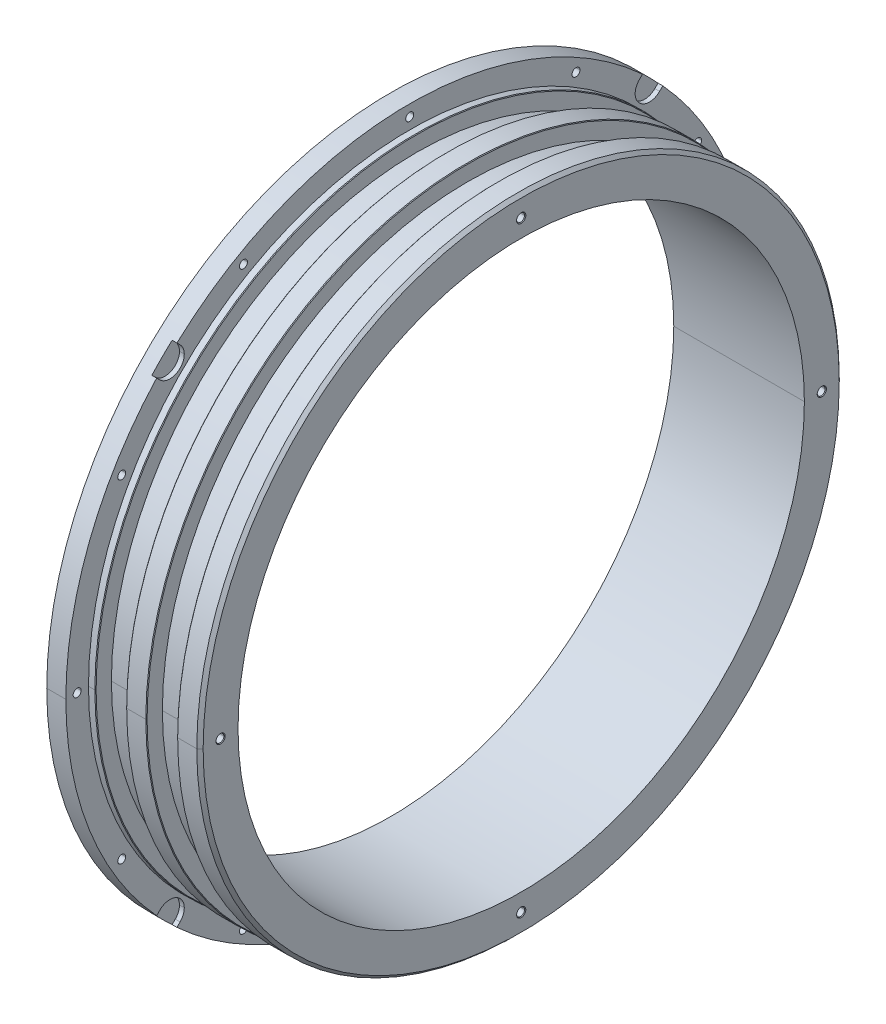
ISO-10303-21;
HEADER;
FILE_DESCRIPTION(('STEP AP214'),'2;1');
FILE_NAME('part.step','',(''),(''),'','','');
FILE_SCHEMA(('AUTOMOTIVE_DESIGN { 1 0 10303 214 1 1 1 1 }'));
ENDSEC;
DATA;
#1=APPLICATION_CONTEXT('core data for automotive mechanical design processes');
#2=APPLICATION_PROTOCOL_DEFINITION('international standard','automotive_design',2000,#1);
#3=PRODUCT_CONTEXT('',#1,'mechanical');
#4=PRODUCT('Part','Part','',(#3));
#5=PRODUCT_RELATED_PRODUCT_CATEGORY('part','',(#4));
#6=PRODUCT_DEFINITION_FORMATION('','',#4);
#7=PRODUCT_DEFINITION_CONTEXT('part definition',#1,'design');
#8=PRODUCT_DEFINITION('design','',#6,#7);
#9=PRODUCT_DEFINITION_SHAPE('','',#8);
#10=(LENGTH_UNIT() NAMED_UNIT(*) SI_UNIT(.MILLI.,.METRE.));
#11=(NAMED_UNIT(*) PLANE_ANGLE_UNIT() SI_UNIT($,.RADIAN.));
#12=(NAMED_UNIT(*) SI_UNIT($,.STERADIAN.) SOLID_ANGLE_UNIT());
#13=UNCERTAINTY_MEASURE_WITH_UNIT(LENGTH_MEASURE(1.E-05),#10,'distance_accuracy_value','');
#14=(GEOMETRIC_REPRESENTATION_CONTEXT(3) GLOBAL_UNCERTAINTY_ASSIGNED_CONTEXT((#13)) GLOBAL_UNIT_ASSIGNED_CONTEXT((#10,
#11,#12)) REPRESENTATION_CONTEXT('',''));
#15=CARTESIAN_POINT('',(0.,0.,0.));
#16=DIRECTION('',(0.,0.,1.));
#17=DIRECTION('',(1.,0.,0.));
#18=AXIS2_PLACEMENT_3D('',#15,#16,#17);
#19=CARTESIAN_POINT('',(4.5,0.,0.));
#20=DIRECTION('',(1.,0.,0.));
#21=DIRECTION('',(0.,1.,0.));
#22=AXIS2_PLACEMENT_3D('',#19,#20,#21);
#23=PLANE('',#22);
#24=CARTESIAN_POINT('',(4.5,0.,0.));
#25=DIRECTION('',(1.,0.,0.));
#26=DIRECTION('',(0.,0.,-1.));
#27=AXIS2_PLACEMENT_3D('',#24,#25,#26);
#28=CIRCLE('',#27,107.95);
#29=CARTESIAN_POINT('',(4.5,-73.0838457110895,79.4478067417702));
#30=VERTEX_POINT('',#29);
#31=CARTESIAN_POINT('',(4.5,-79.4478067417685,73.0838457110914));
#32=VERTEX_POINT('',#31);
#33=EDGE_CURVE('E1461',#30,#32,#28,.T.);
#34=ORIENTED_EDGE('',*,*,#33,.T.);
#35=DIRECTION('',(0.,0.707106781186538,-0.707106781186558));
#36=VECTOR('',#35,1.);
#37=CARTESIAN_POINT('',(4.5,-79.4478067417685,73.0838457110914));
#38=LINE('',#37,#36);
#39=CARTESIAN_POINT('',(4.5,-78.4534973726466,72.0895363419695));
#40=VERTEX_POINT('',#39);
#41=EDGE_CURVE('E10',#32,#40,#38,.T.);
#42=ORIENTED_EDGE('',*,*,#41,.T.);
#43=CARTESIAN_POINT('',(4.5,-75.2715168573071,75.2715168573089));
#44=DIRECTION('',(1.,0.,0.));
#45=DIRECTION('',(0.,0.,1.));
#46=AXIS2_PLACEMENT_3D('',#43,#44,#45);
#47=CIRCLE('',#46,4.5);
#48=CARTESIAN_POINT('',(4.5,-75.2715168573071,70.7715168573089));
#49=VERTEX_POINT('',#48);
#50=EDGE_CURVE('E999',#40,#49,#47,.T.);
#51=ORIENTED_EDGE('',*,*,#50,.T.);
#52=CARTESIAN_POINT('',(4.5,-75.2715168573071,75.2715168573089));
#53=DIRECTION('',(1.,0.,0.));
#54=DIRECTION('',(0.,0.,1.));
#55=AXIS2_PLACEMENT_3D('',#52,#53,#54);
#56=CIRCLE('',#55,4.5);
#57=CARTESIAN_POINT('',(4.5,-72.0895363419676,78.4534973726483));
#58=VERTEX_POINT('',#57);
#59=EDGE_CURVE('E1529',#49,#58,#56,.T.);
#60=ORIENTED_EDGE('',*,*,#59,.T.);
#61=DIRECTION('',(0.,-0.707106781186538,0.707106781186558));
#62=VECTOR('',#61,1.);
#63=CARTESIAN_POINT('',(4.5,-73.0838457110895,79.4478067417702));
#64=LINE('',#63,#62);
#65=EDGE_CURVE('E996',#58,#30,#64,.T.);
#66=ORIENTED_EDGE('',*,*,#65,.T.);
#67=EDGE_LOOP('',(#34,#42,#51,#60,#66));
#68=FACE_BOUND('',#67,.T.);
#69=ADVANCED_FACE('F16',(#68),#23,.T.);
#70=CARTESIAN_POINT('',(4.5,-79.4478067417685,73.0838457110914));
#71=DIRECTION('',(0.,-0.707106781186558,-0.707106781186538));
#72=DIRECTION('',(0.,0.707106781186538,-0.707106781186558));
#73=AXIS2_PLACEMENT_3D('',#70,#71,#72);
#74=PLANE('',#73);
#75=DIRECTION('',(0.,0.707106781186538,-0.707106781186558));
#76=VECTOR('',#75,1.);
#77=CARTESIAN_POINT('',(6.,-79.4478067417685,73.0838457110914));
#78=LINE('',#77,#76);
#79=CARTESIAN_POINT('',(6.,-79.4478067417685,73.0838457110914));
#80=VERTEX_POINT('',#79);
#81=CARTESIAN_POINT('',(6.,-78.4534973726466,72.0895363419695));
#82=VERTEX_POINT('',#81);
#83=EDGE_CURVE('E2298',#80,#82,#78,.T.);
#84=ORIENTED_EDGE('',*,*,#83,.T.);
#85=DIRECTION('',(1.,0.,0.));
#86=VECTOR('',#85,1.);
#87=CARTESIAN_POINT('',(4.5,-78.4534973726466,72.0895363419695));
#88=LINE('',#87,#86);
#89=EDGE_CURVE('E27',#40,#82,#88,.T.);
#90=ORIENTED_EDGE('',*,*,#89,.F.);
#91=ORIENTED_EDGE('',*,*,#41,.F.);
#92=DIRECTION('',(1.,0.,0.));
#93=VECTOR('',#92,1.);
#94=CARTESIAN_POINT('',(4.5,-79.4478067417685,73.0838457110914));
#95=LINE('',#94,#93);
#96=EDGE_CURVE('E1453',#32,#80,#95,.T.);
#97=ORIENTED_EDGE('',*,*,#96,.T.);
#98=EDGE_LOOP('',(#84,#90,#91,#97));
#99=FACE_BOUND('',#98,.T.);
#100=ADVANCED_FACE('F1876',(#99),#74,.F.);
#101=CARTESIAN_POINT('',(4.5,-75.2715168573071,75.2715168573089));
#102=DIRECTION('',(1.,0.,0.));
#103=DIRECTION('',(0.,0.,-1.));
#104=AXIS2_PLACEMENT_3D('',#101,#102,#103);
#105=CYLINDRICAL_SURFACE('',#104,4.5);
#106=DIRECTION('',(1.,0.,0.));
#107=VECTOR('',#106,1.);
#108=CARTESIAN_POINT('',(4.5,-75.2715168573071,70.7715168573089));
#109=LINE('',#108,#107);
#110=CARTESIAN_POINT('',(6.,-75.2715168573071,70.7715168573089));
#111=VERTEX_POINT('',#110);
#112=EDGE_CURVE('E1143',#49,#111,#109,.T.);
#113=ORIENTED_EDGE('',*,*,#112,.F.);
#114=ORIENTED_EDGE('',*,*,#50,.F.);
#115=ORIENTED_EDGE('',*,*,#89,.T.);
#116=CARTESIAN_POINT('',(6.,-75.2715168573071,75.2715168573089));
#117=DIRECTION('',(1.,0.,0.));
#118=DIRECTION('',(0.,0.,1.));
#119=AXIS2_PLACEMENT_3D('',#116,#117,#118);
#120=CIRCLE('',#119,4.5);
#121=EDGE_CURVE('E922',#82,#111,#120,.T.);
#122=ORIENTED_EDGE('',*,*,#121,.T.);
#123=EDGE_LOOP('',(#113,#114,#115,#122));
#124=FACE_BOUND('',#123,.T.);
#125=ADVANCED_FACE('F1881',(#124),#105,.F.);
#126=CARTESIAN_POINT('',(4.5,-73.0838457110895,79.4478067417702));
#127=DIRECTION('',(0.,0.707106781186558,0.707106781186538));
#128=DIRECTION('',(1.,0.,0.));
#129=AXIS2_PLACEMENT_3D('',#126,#127,#128);
#130=PLANE('',#129);
#131=DIRECTION('',(0.,-0.707106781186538,0.707106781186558));
#132=VECTOR('',#131,1.);
#133=CARTESIAN_POINT('',(6.,-73.0838457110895,79.4478067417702));
#134=LINE('',#133,#132);
#135=CARTESIAN_POINT('',(6.,-72.0895363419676,78.4534973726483));
#136=VERTEX_POINT('',#135);
#137=CARTESIAN_POINT('',(6.,-73.0838457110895,79.4478067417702));
#138=VERTEX_POINT('',#137);
#139=EDGE_CURVE('E918',#136,#138,#134,.T.);
#140=ORIENTED_EDGE('',*,*,#139,.T.);
#141=DIRECTION('',(1.,0.,0.));
#142=VECTOR('',#141,1.);
#143=CARTESIAN_POINT('',(4.5,-73.0838457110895,79.4478067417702));
#144=LINE('',#143,#142);
#145=EDGE_CURVE('E1469',#30,#138,#144,.T.);
#146=ORIENTED_EDGE('',*,*,#145,.F.);
#147=ORIENTED_EDGE('',*,*,#65,.F.);
#148=DIRECTION('',(1.,0.,0.));
#149=VECTOR('',#148,1.);
#150=CARTESIAN_POINT('',(4.5,-72.0895363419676,78.4534973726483));
#151=LINE('',#150,#149);
#152=EDGE_CURVE('E792',#58,#136,#151,.T.);
#153=ORIENTED_EDGE('',*,*,#152,.T.);
#154=EDGE_LOOP('',(#140,#146,#147,#153));
#155=FACE_BOUND('',#154,.T.);
#156=ADVANCED_FACE('F3504',(#155),#130,.F.);
#157=CARTESIAN_POINT('',(4.5,0.,0.));
#158=DIRECTION('',(1.,0.,0.));
#159=DIRECTION('',(0.,1.,0.));
#160=AXIS2_PLACEMENT_3D('',#157,#158,#159);
#161=PLANE('',#160);
#162=CARTESIAN_POINT('',(4.5,0.,0.));
#163=DIRECTION('',(1.,0.,0.));
#164=DIRECTION('',(0.,0.,-1.));
#165=AXIS2_PLACEMENT_3D('',#162,#163,#164);
#166=CIRCLE('',#165,107.95);
#167=CARTESIAN_POINT('',(4.5,-79.44780674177,-73.0838457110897));
#168=VERTEX_POINT('',#167);
#169=CARTESIAN_POINT('',(4.5,-73.0838457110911,-79.4478067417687));
#170=VERTEX_POINT('',#169);
#171=EDGE_CURVE('E1366',#168,#170,#166,.T.);
#172=ORIENTED_EDGE('',*,*,#171,.T.);
#173=DIRECTION('',(0.,0.707106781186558,0.707106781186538));
#174=VECTOR('',#173,1.);
#175=CARTESIAN_POINT('',(4.5,-73.0838457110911,-79.4478067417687));
#176=LINE('',#175,#174);
#177=CARTESIAN_POINT('',(4.5,-72.0895363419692,-78.4534973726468));
#178=VERTEX_POINT('',#177);
#179=EDGE_CURVE('E1000',#170,#178,#176,.T.);
#180=ORIENTED_EDGE('',*,*,#179,.T.);
#181=CARTESIAN_POINT('',(4.5,-75.2715168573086,-75.2715168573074));
#182=DIRECTION('',(1.,0.,0.));
#183=DIRECTION('',(0.,0.,1.));
#184=AXIS2_PLACEMENT_3D('',#181,#182,#183);
#185=CIRCLE('',#184,4.5);
#186=CARTESIAN_POINT('',(4.5,-78.4534973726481,-72.0895363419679));
#187=VERTEX_POINT('',#186);
#188=EDGE_CURVE('E1232',#178,#187,#185,.T.);
#189=ORIENTED_EDGE('',*,*,#188,.T.);
#190=DIRECTION('',(0.,-0.707106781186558,-0.707106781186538));
#191=VECTOR('',#190,1.);
#192=CARTESIAN_POINT('',(4.5,-79.44780674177,-73.0838457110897));
#193=LINE('',#192,#191);
#194=EDGE_CURVE('E1346',#187,#168,#193,.T.);
#195=ORIENTED_EDGE('',*,*,#194,.T.);
#196=EDGE_LOOP('',(#172,#180,#189,#195));
#197=FACE_BOUND('',#196,.T.);
#198=ADVANCED_FACE('F3500',(#197),#161,.T.);
#199=CARTESIAN_POINT('',(4.5,-73.0838457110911,-79.4478067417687));
#200=DIRECTION('',(0.,0.707106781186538,-0.707106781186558));
#201=DIRECTION('',(-1.,0.,0.));
#202=AXIS2_PLACEMENT_3D('',#199,#200,#201);
#203=PLANE('',#202);
#204=DIRECTION('',(0.,0.707106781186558,0.707106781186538));
#205=VECTOR('',#204,1.);
#206=CARTESIAN_POINT('',(6.,-73.0838457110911,-79.4478067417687));
#207=LINE('',#206,#205);
#208=CARTESIAN_POINT('',(6.,-73.0838457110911,-79.4478067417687));
#209=VERTEX_POINT('',#208);
#210=CARTESIAN_POINT('',(6.,-72.0895363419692,-78.4534973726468));
#211=VERTEX_POINT('',#210);
#212=EDGE_CURVE('E1196',#209,#211,#207,.T.);
#213=ORIENTED_EDGE('',*,*,#212,.T.);
#214=DIRECTION('',(1.,0.,0.));
#215=VECTOR('',#214,1.);
#216=CARTESIAN_POINT('',(4.5,-72.0895363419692,-78.4534973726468));
#217=LINE('',#216,#215);
#218=EDGE_CURVE('E1235',#178,#211,#217,.T.);
#219=ORIENTED_EDGE('',*,*,#218,.F.);
#220=ORIENTED_EDGE('',*,*,#179,.F.);
#221=DIRECTION('',(1.,0.,0.));
#222=VECTOR('',#221,1.);
#223=CARTESIAN_POINT('',(4.5,-73.0838457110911,-79.4478067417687));
#224=LINE('',#223,#222);
#225=EDGE_CURVE('E1224',#170,#209,#224,.T.);
#226=ORIENTED_EDGE('',*,*,#225,.T.);
#227=EDGE_LOOP('',(#213,#219,#220,#226));
#228=FACE_BOUND('',#227,.T.);
#229=ADVANCED_FACE('F1940',(#228),#203,.F.);
#230=CARTESIAN_POINT('',(4.5,-75.2715168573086,-75.2715168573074));
#231=DIRECTION('',(1.,0.,0.));
#232=DIRECTION('',(0.,0.,-1.));
#233=AXIS2_PLACEMENT_3D('',#230,#231,#232);
#234=CYLINDRICAL_SURFACE('',#233,4.5);
#235=CARTESIAN_POINT('',(6.,-75.2715168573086,-75.2715168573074));
#236=DIRECTION('',(1.,0.,0.));
#237=DIRECTION('',(0.,0.,1.));
#238=AXIS2_PLACEMENT_3D('',#235,#236,#237);
#239=CIRCLE('',#238,4.5);
#240=CARTESIAN_POINT('',(6.,-78.4534973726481,-72.0895363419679));
#241=VERTEX_POINT('',#240);
#242=EDGE_CURVE('E847',#211,#241,#239,.T.);
#243=ORIENTED_EDGE('',*,*,#242,.T.);
#244=DIRECTION('',(1.,0.,0.));
#245=VECTOR('',#244,1.);
#246=CARTESIAN_POINT('',(4.5,-78.4534973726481,-72.0895363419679));
#247=LINE('',#246,#245);
#248=EDGE_CURVE('E1236',#187,#241,#247,.T.);
#249=ORIENTED_EDGE('',*,*,#248,.F.);
#250=ORIENTED_EDGE('',*,*,#188,.F.);
#251=ORIENTED_EDGE('',*,*,#218,.T.);
#252=EDGE_LOOP('',(#243,#249,#250,#251));
#253=FACE_BOUND('',#252,.T.);
#254=ADVANCED_FACE('F1938',(#253),#234,.F.);
#255=CARTESIAN_POINT('',(4.5,-79.44780674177,-73.0838457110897));
#256=DIRECTION('',(0.,-0.707106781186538,0.707106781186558));
#257=DIRECTION('',(-1.,0.,0.));
#258=AXIS2_PLACEMENT_3D('',#255,#256,#257);
#259=PLANE('',#258);
#260=DIRECTION('',(0.,-0.707106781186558,-0.707106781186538));
#261=VECTOR('',#260,1.);
#262=CARTESIAN_POINT('',(6.,-79.44780674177,-73.0838457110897));
#263=LINE('',#262,#261);
#264=CARTESIAN_POINT('',(6.,-79.44780674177,-73.0838457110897));
#265=VERTEX_POINT('',#264);
#266=EDGE_CURVE('E843',#241,#265,#263,.T.);
#267=ORIENTED_EDGE('',*,*,#266,.T.);
#268=DIRECTION('',(1.,0.,0.));
#269=VECTOR('',#268,1.);
#270=CARTESIAN_POINT('',(4.5,-79.44780674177,-73.0838457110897));
#271=LINE('',#270,#269);
#272=EDGE_CURVE('E1370',#168,#265,#271,.T.);
#273=ORIENTED_EDGE('',*,*,#272,.F.);
#274=ORIENTED_EDGE('',*,*,#194,.F.);
#275=ORIENTED_EDGE('',*,*,#248,.T.);
#276=EDGE_LOOP('',(#267,#273,#274,#275));
#277=FACE_BOUND('',#276,.T.);
#278=ADVANCED_FACE('F1927',(#277),#259,.F.);
#279=CARTESIAN_POINT('',(4.5,0.,0.));
#280=DIRECTION('',(1.,0.,0.));
#281=DIRECTION('',(0.,1.,0.));
#282=AXIS2_PLACEMENT_3D('',#279,#280,#281);
#283=PLANE('',#282);
#284=CARTESIAN_POINT('',(4.5,0.,0.));
#285=DIRECTION('',(1.,0.,0.));
#286=DIRECTION('',(0.,0.,-1.));
#287=AXIS2_PLACEMENT_3D('',#284,#285,#286);
#288=CIRCLE('',#287,107.95);
#289=CARTESIAN_POINT('',(4.5,73.08384571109,-79.4478067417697));
#290=VERTEX_POINT('',#289);
#291=CARTESIAN_POINT('',(4.5,79.447806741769,-73.0838457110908));
#292=VERTEX_POINT('',#291);
#293=EDGE_CURVE('E1138',#290,#292,#288,.T.);
#294=ORIENTED_EDGE('',*,*,#293,.T.);
#295=DIRECTION('',(0.,-0.707106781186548,0.707106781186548));
#296=VECTOR('',#295,1.);
#297=CARTESIAN_POINT('',(4.5,79.447806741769,-73.0838457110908));
#298=LINE('',#297,#296);
#299=CARTESIAN_POINT('',(4.5,78.4534973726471,-72.0895363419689));
#300=VERTEX_POINT('',#299);
#301=EDGE_CURVE('E1230',#292,#300,#298,.T.);
#302=ORIENTED_EDGE('',*,*,#301,.T.);
#303=CARTESIAN_POINT('',(4.5,75.2715168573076,-75.2715168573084));
#304=DIRECTION('',(1.,0.,0.));
#305=DIRECTION('',(0.,0.,1.));
#306=AXIS2_PLACEMENT_3D('',#303,#304,#305);
#307=CIRCLE('',#306,4.5);
#308=CARTESIAN_POINT('',(4.5,72.0895363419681,-78.4534973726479));
#309=VERTEX_POINT('',#308);
#310=EDGE_CURVE('E1231',#300,#309,#307,.T.);
#311=ORIENTED_EDGE('',*,*,#310,.T.);
#312=DIRECTION('',(0.,0.707106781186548,-0.707106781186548));
#313=VECTOR('',#312,1.);
#314=CARTESIAN_POINT('',(4.5,73.08384571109,-79.4478067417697));
#315=LINE('',#314,#313);
#316=EDGE_CURVE('E812',#309,#290,#315,.T.);
#317=ORIENTED_EDGE('',*,*,#316,.T.);
#318=EDGE_LOOP('',(#294,#302,#311,#317));
#319=FACE_BOUND('',#318,.T.);
#320=ADVANCED_FACE('F1923',(#319),#283,.T.);
#321=CARTESIAN_POINT('',(4.5,79.447806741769,-73.0838457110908));
#322=DIRECTION('',(0.,0.707106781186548,0.707106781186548));
#323=DIRECTION('',(1.,0.,0.));
#324=AXIS2_PLACEMENT_3D('',#321,#322,#323);
#325=PLANE('',#324);
#326=DIRECTION('',(0.,-0.707106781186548,0.707106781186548));
#327=VECTOR('',#326,1.);
#328=CARTESIAN_POINT('',(6.,79.447806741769,-73.0838457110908));
#329=LINE('',#328,#327);
#330=CARTESIAN_POINT('',(6.,79.447806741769,-73.0838457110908));
#331=VERTEX_POINT('',#330);
#332=CARTESIAN_POINT('',(6.,78.4534973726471,-72.0895363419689));
#333=VERTEX_POINT('',#332);
#334=EDGE_CURVE('E1406',#331,#333,#329,.T.);
#335=ORIENTED_EDGE('',*,*,#334,.T.);
#336=DIRECTION('',(1.,0.,0.));
#337=VECTOR('',#336,1.);
#338=CARTESIAN_POINT('',(4.5,78.4534973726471,-72.0895363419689));
#339=LINE('',#338,#337);
#340=EDGE_CURVE('E1227',#300,#333,#339,.T.);
#341=ORIENTED_EDGE('',*,*,#340,.F.);
#342=ORIENTED_EDGE('',*,*,#301,.F.);
#343=DIRECTION('',(1.,0.,0.));
#344=VECTOR('',#343,1.);
#345=CARTESIAN_POINT('',(4.5,79.447806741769,-73.0838457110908));
#346=LINE('',#345,#344);
#347=EDGE_CURVE('E1134',#292,#331,#346,.T.);
#348=ORIENTED_EDGE('',*,*,#347,.T.);
#349=EDGE_LOOP('',(#335,#341,#342,#348));
#350=FACE_BOUND('',#349,.T.);
#351=ADVANCED_FACE('F1926',(#350),#325,.F.);
#352=CARTESIAN_POINT('',(4.5,75.2715168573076,-75.2715168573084));
#353=DIRECTION('',(1.,0.,0.));
#354=DIRECTION('',(0.,0.,-1.));
#355=AXIS2_PLACEMENT_3D('',#352,#353,#354);
#356=CYLINDRICAL_SURFACE('',#355,4.5);
#357=CARTESIAN_POINT('',(6.,75.2715168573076,-75.2715168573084));
#358=DIRECTION('',(1.,0.,0.));
#359=DIRECTION('',(0.,0.,1.));
#360=AXIS2_PLACEMENT_3D('',#357,#358,#359);
#361=CIRCLE('',#360,4.5);
#362=CARTESIAN_POINT('',(6.,72.0895363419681,-78.4534973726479));
#363=VERTEX_POINT('',#362);
#364=EDGE_CURVE('E1410',#333,#363,#361,.T.);
#365=ORIENTED_EDGE('',*,*,#364,.T.);
#366=DIRECTION('',(1.,0.,0.));
#367=VECTOR('',#366,1.);
#368=CARTESIAN_POINT('',(4.5,72.0895363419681,-78.4534973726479));
#369=LINE('',#368,#367);
#370=EDGE_CURVE('E1044',#309,#363,#369,.T.);
#371=ORIENTED_EDGE('',*,*,#370,.F.);
#372=ORIENTED_EDGE('',*,*,#310,.F.);
#373=ORIENTED_EDGE('',*,*,#340,.T.);
#374=EDGE_LOOP('',(#365,#371,#372,#373));
#375=FACE_BOUND('',#374,.T.);
#376=ADVANCED_FACE('F1912',(#375),#356,.F.);
#377=CARTESIAN_POINT('',(4.5,73.08384571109,-79.4478067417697));
#378=DIRECTION('',(0.,-0.707106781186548,-0.707106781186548));
#379=DIRECTION('',(0.,-0.707106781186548,0.707106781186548));
#380=AXIS2_PLACEMENT_3D('',#377,#378,#379);
#381=PLANE('',#380);
#382=DIRECTION('',(0.,0.707106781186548,-0.707106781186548));
#383=VECTOR('',#382,1.);
#384=CARTESIAN_POINT('',(6.,73.08384571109,-79.4478067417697));
#385=LINE('',#384,#383);
#386=CARTESIAN_POINT('',(6.,73.08384571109,-79.4478067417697));
#387=VERTEX_POINT('',#386);
#388=EDGE_CURVE('E1498',#363,#387,#385,.T.);
#389=ORIENTED_EDGE('',*,*,#388,.T.);
#390=DIRECTION('',(1.,0.,0.));
#391=VECTOR('',#390,1.);
#392=CARTESIAN_POINT('',(4.5,73.08384571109,-79.4478067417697));
#393=LINE('',#392,#391);
#394=EDGE_CURVE('E1448',#290,#387,#393,.T.);
#395=ORIENTED_EDGE('',*,*,#394,.F.);
#396=ORIENTED_EDGE('',*,*,#316,.F.);
#397=ORIENTED_EDGE('',*,*,#370,.T.);
#398=EDGE_LOOP('',(#389,#395,#396,#397));
#399=FACE_BOUND('',#398,.T.);
#400=ADVANCED_FACE('F1908',(#399),#381,.F.);
#401=CARTESIAN_POINT('',(4.5,0.,0.));
#402=DIRECTION('',(1.,0.,0.));
#403=DIRECTION('',(0.,1.,0.));
#404=AXIS2_PLACEMENT_3D('',#401,#402,#403);
#405=PLANE('',#404);
#406=CARTESIAN_POINT('',(4.5,0.,0.));
#407=DIRECTION('',(1.,0.,0.));
#408=DIRECTION('',(0.,0.,-1.));
#409=AXIS2_PLACEMENT_3D('',#406,#407,#408);
#410=CIRCLE('',#409,107.95);
#411=CARTESIAN_POINT('',(4.5,79.4478067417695,73.0838457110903));
#412=VERTEX_POINT('',#411);
#413=CARTESIAN_POINT('',(4.5,73.0838457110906,79.4478067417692));
#414=VERTEX_POINT('',#413);
#415=EDGE_CURVE('E901',#412,#414,#410,.T.);
#416=ORIENTED_EDGE('',*,*,#415,.T.);
#417=DIRECTION('',(0.,-0.707106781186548,-0.707106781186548));
#418=VECTOR('',#417,1.);
#419=CARTESIAN_POINT('',(4.5,73.0838457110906,79.4478067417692));
#420=LINE('',#419,#418);
#421=CARTESIAN_POINT('',(4.5,72.0895363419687,78.4534973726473));
#422=VERTEX_POINT('',#421);
#423=EDGE_CURVE('E809',#414,#422,#420,.T.);
#424=ORIENTED_EDGE('',*,*,#423,.T.);
#425=CARTESIAN_POINT('',(4.5,75.2715168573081,75.2715168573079));
#426=DIRECTION('',(1.,0.,0.));
#427=DIRECTION('',(0.,0.,1.));
#428=AXIS2_PLACEMENT_3D('',#425,#426,#427);
#429=CIRCLE('',#428,4.5);
#430=CARTESIAN_POINT('',(4.5,75.2715168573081,70.7715168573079));
#431=VERTEX_POINT('',#430);
#432=EDGE_CURVE('E1270',#422,#431,#429,.T.);
#433=ORIENTED_EDGE('',*,*,#432,.T.);
#434=CARTESIAN_POINT('',(4.5,75.2715168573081,75.2715168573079));
#435=DIRECTION('',(1.,0.,0.));
#436=DIRECTION('',(0.,0.,1.));
#437=AXIS2_PLACEMENT_3D('',#434,#435,#436);
#438=CIRCLE('',#437,4.5);
#439=CARTESIAN_POINT('',(4.5,78.4534973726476,72.0895363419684));
#440=VERTEX_POINT('',#439);
#441=EDGE_CURVE('E796',#431,#440,#438,.T.);
#442=ORIENTED_EDGE('',*,*,#441,.T.);
#443=DIRECTION('',(0.,0.707106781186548,0.707106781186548));
#444=VECTOR('',#443,1.);
#445=CARTESIAN_POINT('',(4.5,79.4478067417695,73.0838457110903));
#446=LINE('',#445,#444);
#447=EDGE_CURVE('E948',#440,#412,#446,.T.);
#448=ORIENTED_EDGE('',*,*,#447,.T.);
#449=EDGE_LOOP('',(#416,#424,#433,#442,#448));
#450=FACE_BOUND('',#449,.T.);
#451=ADVANCED_FACE('F1911',(#450),#405,.T.);
#452=CARTESIAN_POINT('',(4.5,73.0838457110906,79.4478067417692));
#453=DIRECTION('',(0.,-0.707106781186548,0.707106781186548));
#454=DIRECTION('',(-1.,0.,0.));
#455=AXIS2_PLACEMENT_3D('',#452,#453,#454);
#456=PLANE('',#455);
#457=DIRECTION('',(0.,-0.707106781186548,-0.707106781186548));
#458=VECTOR('',#457,1.);
#459=CARTESIAN_POINT('',(6.,73.0838457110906,79.4478067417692));
#460=LINE('',#459,#458);
#461=CARTESIAN_POINT('',(6.,73.0838457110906,79.4478067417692));
#462=VERTEX_POINT('',#461);
#463=CARTESIAN_POINT('',(6.,72.0895363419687,78.4534973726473));
#464=VERTEX_POINT('',#463);
#465=EDGE_CURVE('E1258',#462,#464,#460,.T.);
#466=ORIENTED_EDGE('',*,*,#465,.T.);
#467=DIRECTION('',(1.,0.,0.));
#468=VECTOR('',#467,1.);
#469=CARTESIAN_POINT('',(4.5,72.0895363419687,78.4534973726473));
#470=LINE('',#469,#468);
#471=EDGE_CURVE('E813',#422,#464,#470,.T.);
#472=ORIENTED_EDGE('',*,*,#471,.F.);
#473=ORIENTED_EDGE('',*,*,#423,.F.);
#474=DIRECTION('',(1.,0.,0.));
#475=VECTOR('',#474,1.);
#476=CARTESIAN_POINT('',(4.5,73.0838457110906,79.4478067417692));
#477=LINE('',#476,#475);
#478=EDGE_CURVE('E20',#414,#462,#477,.T.);
#479=ORIENTED_EDGE('',*,*,#478,.T.);
#480=EDGE_LOOP('',(#466,#472,#473,#479));
#481=FACE_BOUND('',#480,.T.);
#482=ADVANCED_FACE('F1916',(#481),#456,.F.);
#483=CARTESIAN_POINT('',(4.5,75.2715168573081,75.2715168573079));
#484=DIRECTION('',(1.,0.,0.));
#485=DIRECTION('',(0.,0.,-1.));
#486=AXIS2_PLACEMENT_3D('',#483,#484,#485);
#487=CYLINDRICAL_SURFACE('',#486,4.5);
#488=DIRECTION('',(1.,0.,0.));
#489=VECTOR('',#488,1.);
#490=CARTESIAN_POINT('',(4.5,75.2715168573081,70.7715168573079));
#491=LINE('',#490,#489);
#492=CARTESIAN_POINT('',(6.,75.2715168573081,70.7715168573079));
#493=VERTEX_POINT('',#492);
#494=EDGE_CURVE('E1063',#431,#493,#491,.T.);
#495=ORIENTED_EDGE('',*,*,#494,.F.);
#496=ORIENTED_EDGE('',*,*,#432,.F.);
#497=ORIENTED_EDGE('',*,*,#471,.T.);
#498=CARTESIAN_POINT('',(6.,75.2715168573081,75.2715168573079));
#499=DIRECTION('',(1.,0.,0.));
#500=DIRECTION('',(0.,0.,1.));
#501=AXIS2_PLACEMENT_3D('',#498,#499,#500);
#502=CIRCLE('',#501,4.5);
#503=EDGE_CURVE('E1255',#464,#493,#502,.T.);
#504=ORIENTED_EDGE('',*,*,#503,.T.);
#505=EDGE_LOOP('',(#495,#496,#497,#504));
#506=FACE_BOUND('',#505,.T.);
#507=ADVANCED_FACE('F1957',(#506),#487,.F.);
#508=CARTESIAN_POINT('',(4.5,79.4478067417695,73.0838457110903));
#509=DIRECTION('',(0.,0.707106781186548,-0.707106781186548));
#510=DIRECTION('',(-1.,0.,0.));
#511=AXIS2_PLACEMENT_3D('',#508,#509,#510);
#512=PLANE('',#511);
#513=DIRECTION('',(0.,0.707106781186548,0.707106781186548));
#514=VECTOR('',#513,1.);
#515=CARTESIAN_POINT('',(6.,79.4478067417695,73.0838457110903));
#516=LINE('',#515,#514);
#517=CARTESIAN_POINT('',(6.,78.4534973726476,72.0895363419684));
#518=VERTEX_POINT('',#517);
#519=CARTESIAN_POINT('',(6.,79.4478067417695,73.0838457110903));
#520=VERTEX_POINT('',#519);
#521=EDGE_CURVE('E1259',#518,#520,#516,.T.);
#522=ORIENTED_EDGE('',*,*,#521,.T.);
#523=DIRECTION('',(1.,0.,0.));
#524=VECTOR('',#523,1.);
#525=CARTESIAN_POINT('',(4.5,79.4478067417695,73.0838457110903));
#526=LINE('',#525,#524);
#527=EDGE_CURVE('E905',#412,#520,#526,.T.);
#528=ORIENTED_EDGE('',*,*,#527,.F.);
#529=ORIENTED_EDGE('',*,*,#447,.F.);
#530=DIRECTION('',(1.,0.,0.));
#531=VECTOR('',#530,1.);
#532=CARTESIAN_POINT('',(4.5,78.4534973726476,72.0895363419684));
#533=LINE('',#532,#531);
#534=EDGE_CURVE('E1280',#440,#518,#533,.T.);
#535=ORIENTED_EDGE('',*,*,#534,.T.);
#536=EDGE_LOOP('',(#522,#528,#529,#535));
#537=FACE_BOUND('',#536,.T.);
#538=ADVANCED_FACE('F1953',(#537),#512,.F.);
#539=CARTESIAN_POINT('',(0.,0.,-104.4));
#540=DIRECTION('',(-1.,0.,0.));
#541=DIRECTION('',(0.,0.,1.));
#542=AXIS2_PLACEMENT_3D('',#539,#540,#541);
#543=CONICAL_SURFACE('',#542,1.44999999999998,0.785398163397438);
#544=DIRECTION('',(-0.707106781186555,0.,-0.70710678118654));
#545=VECTOR('',#544,1.);
#546=CARTESIAN_POINT('',(0.,0.,-105.85));
#547=LINE('',#546,#545);
#548=CARTESIAN_POINT('',(0.2,0.,-105.65));
#549=VERTEX_POINT('',#548);
#550=CARTESIAN_POINT('',(0.,0.,-105.85));
#551=VERTEX_POINT('',#550);
#552=EDGE_CURVE('E1315',#549,#551,#547,.T.);
#553=ORIENTED_EDGE('',*,*,#552,.F.);
#554=CARTESIAN_POINT('',(0.2,0.,-104.4));
#555=DIRECTION('',(-1.,0.,0.));
#556=DIRECTION('',(0.,0.,1.));
#557=AXIS2_PLACEMENT_3D('',#554,#555,#556);
#558=CIRCLE('',#557,1.24999999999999);
#559=CARTESIAN_POINT('',(0.2,0.,-103.15));
#560=VERTEX_POINT('',#559);
#561=EDGE_CURVE('E1040',#560,#549,#558,.T.);
#562=ORIENTED_EDGE('',*,*,#561,.F.);
#563=DIRECTION('',(-0.707106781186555,0.,0.70710678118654));
#564=VECTOR('',#563,1.);
#565=CARTESIAN_POINT('',(0.,0.,-102.95));
#566=LINE('',#565,#564);
#567=CARTESIAN_POINT('',(0.,0.,-102.95));
#568=VERTEX_POINT('',#567);
#569=EDGE_CURVE('E782',#560,#568,#566,.T.);
#570=ORIENTED_EDGE('',*,*,#569,.T.);
#571=CARTESIAN_POINT('',(0.,0.,-104.4));
#572=DIRECTION('',(1.,0.,0.));
#573=DIRECTION('',(0.,0.,1.));
#574=AXIS2_PLACEMENT_3D('',#571,#572,#573);
#575=CIRCLE('',#574,1.44999999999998);
#576=EDGE_CURVE('E1528',#551,#568,#575,.T.);
#577=ORIENTED_EDGE('',*,*,#576,.F.);
#578=EDGE_LOOP('',(#553,#562,#570,#577));
#579=FACE_BOUND('',#578,.T.);
#580=ADVANCED_FACE('F1956',(#579),#543,.F.);
#581=CARTESIAN_POINT('',(0.,52.2,-90.4130521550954));
#582=DIRECTION('',(-1.,0.,0.));
#583=DIRECTION('',(0.,0.,1.));
#584=AXIS2_PLACEMENT_3D('',#581,#582,#583);
#585=CONICAL_SURFACE('',#584,1.44999999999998,0.785398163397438);
#586=DIRECTION('',(-0.707106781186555,0.,-0.70710678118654));
#587=VECTOR('',#586,1.);
#588=CARTESIAN_POINT('',(0.,52.2,-91.8630521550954));
#589=LINE('',#588,#587);
#590=CARTESIAN_POINT('',(0.2,52.2,-91.6630521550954));
#591=VERTEX_POINT('',#590);
#592=CARTESIAN_POINT('',(0.,52.2,-91.8630521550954));
#593=VERTEX_POINT('',#592);
#594=EDGE_CURVE('E781',#591,#593,#589,.T.);
#595=ORIENTED_EDGE('',*,*,#594,.F.);
#596=CARTESIAN_POINT('',(0.2,52.2,-90.4130521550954));
#597=DIRECTION('',(-1.,0.,0.));
#598=DIRECTION('',(0.,0.,1.));
#599=AXIS2_PLACEMENT_3D('',#596,#597,#598);
#600=CIRCLE('',#599,1.24999999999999);
#601=CARTESIAN_POINT('',(0.2,52.2,-89.1630521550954));
#602=VERTEX_POINT('',#601);
#603=EDGE_CURVE('E1251',#602,#591,#600,.T.);
#604=ORIENTED_EDGE('',*,*,#603,.F.);
#605=DIRECTION('',(-0.707106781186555,0.,0.70710678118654));
#606=VECTOR('',#605,1.);
#607=CARTESIAN_POINT('',(0.,52.2,-88.9630521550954));
#608=LINE('',#607,#606);
#609=CARTESIAN_POINT('',(0.,52.2,-88.9630521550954));
#610=VERTEX_POINT('',#609);
#611=EDGE_CURVE('E878',#602,#610,#608,.T.);
#612=ORIENTED_EDGE('',*,*,#611,.T.);
#613=CARTESIAN_POINT('',(0.,52.2,-90.4130521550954));
#614=DIRECTION('',(1.,0.,0.));
#615=DIRECTION('',(0.,0.,1.));
#616=AXIS2_PLACEMENT_3D('',#613,#614,#615);
#617=CIRCLE('',#616,1.44999999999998);
#618=EDGE_CURVE('E1098',#593,#610,#617,.T.);
#619=ORIENTED_EDGE('',*,*,#618,.F.);
#620=EDGE_LOOP('',(#595,#604,#612,#619));
#621=FACE_BOUND('',#620,.T.);
#622=ADVANCED_FACE('F2179',(#621),#585,.F.);
#623=CARTESIAN_POINT('',(0.,90.4130521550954,-52.2));
#624=DIRECTION('',(-1.,0.,0.));
#625=DIRECTION('',(0.,0.,1.));
#626=AXIS2_PLACEMENT_3D('',#623,#624,#625);
#627=CONICAL_SURFACE('',#626,1.44999999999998,0.785398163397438);
#628=DIRECTION('',(-0.707106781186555,0.,-0.70710678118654));
#629=VECTOR('',#628,1.);
#630=CARTESIAN_POINT('',(0.,90.4130521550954,-53.65));
#631=LINE('',#630,#629);
#632=CARTESIAN_POINT('',(0.2,90.4130521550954,-53.45));
#633=VERTEX_POINT('',#632);
#634=CARTESIAN_POINT('',(0.,90.4130521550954,-53.65));
#635=VERTEX_POINT('',#634);
#636=EDGE_CURVE('E831',#633,#635,#631,.T.);
#637=ORIENTED_EDGE('',*,*,#636,.F.);
#638=CARTESIAN_POINT('',(0.2,90.4130521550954,-52.2));
#639=DIRECTION('',(-1.,0.,0.));
#640=DIRECTION('',(0.,0.,1.));
#641=AXIS2_PLACEMENT_3D('',#638,#639,#640);
#642=CIRCLE('',#641,1.24999999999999);
#643=CARTESIAN_POINT('',(0.2,90.4130521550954,-50.95));
#644=VERTEX_POINT('',#643);
#645=EDGE_CURVE('E1254',#644,#633,#642,.T.);
#646=ORIENTED_EDGE('',*,*,#645,.F.);
#647=DIRECTION('',(-0.707106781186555,0.,0.70710678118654));
#648=VECTOR('',#647,1.);
#649=CARTESIAN_POINT('',(0.,90.4130521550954,-50.75));
#650=LINE('',#649,#648);
#651=CARTESIAN_POINT('',(0.,90.4130521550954,-50.75));
#652=VERTEX_POINT('',#651);
#653=EDGE_CURVE('E830',#644,#652,#650,.T.);
#654=ORIENTED_EDGE('',*,*,#653,.T.);
#655=CARTESIAN_POINT('',(0.,90.4130521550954,-52.2));
#656=DIRECTION('',(1.,0.,0.));
#657=DIRECTION('',(0.,0.,1.));
#658=AXIS2_PLACEMENT_3D('',#655,#656,#657);
#659=CIRCLE('',#658,1.44999999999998);
#660=EDGE_CURVE('E1095',#635,#652,#659,.T.);
#661=ORIENTED_EDGE('',*,*,#660,.F.);
#662=EDGE_LOOP('',(#637,#646,#654,#661));
#663=FACE_BOUND('',#662,.T.);
#664=ADVANCED_FACE('F2088',(#663),#627,.F.);
#665=CARTESIAN_POINT('',(0.,104.4,0.));
#666=DIRECTION('',(-1.,0.,0.));
#667=DIRECTION('',(0.,0.,1.));
#668=AXIS2_PLACEMENT_3D('',#665,#666,#667);
#669=CONICAL_SURFACE('',#668,1.4499999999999,0.785398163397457);
#670=DIRECTION('',(-0.707106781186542,0.,-0.707106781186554));
#671=VECTOR('',#670,1.);
#672=CARTESIAN_POINT('',(0.,104.4,-1.4499999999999));
#673=LINE('',#672,#671);
#674=CARTESIAN_POINT('',(0.199999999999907,104.4,-1.24999999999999));
#675=VERTEX_POINT('',#674);
#676=CARTESIAN_POINT('',(0.,104.4,-1.44999999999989));
#677=VERTEX_POINT('',#676);
#678=EDGE_CURVE('E836',#675,#677,#673,.T.);
#679=ORIENTED_EDGE('',*,*,#678,.F.);
#680=CARTESIAN_POINT('',(0.199999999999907,104.4,0.));
#681=DIRECTION('',(-1.,0.,0.));
#682=DIRECTION('',(0.,0.,1.));
#683=AXIS2_PLACEMENT_3D('',#680,#681,#682);
#684=CIRCLE('',#683,1.24999999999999);
#685=CARTESIAN_POINT('',(0.199999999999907,104.4,1.24999999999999));
#686=VERTEX_POINT('',#685);
#687=EDGE_CURVE('E808',#686,#675,#684,.T.);
#688=ORIENTED_EDGE('',*,*,#687,.F.);
#689=DIRECTION('',(-0.707106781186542,0.,0.707106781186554));
#690=VECTOR('',#689,1.);
#691=CARTESIAN_POINT('',(0.,104.4,1.4499999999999));
#692=LINE('',#691,#690);
#693=CARTESIAN_POINT('',(0.,104.4,1.44999999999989));
#694=VERTEX_POINT('',#693);
#695=EDGE_CURVE('E968',#686,#694,#692,.T.);
#696=ORIENTED_EDGE('',*,*,#695,.T.);
#697=CARTESIAN_POINT('',(0.,104.4,0.));
#698=DIRECTION('',(1.,0.,0.));
#699=DIRECTION('',(0.,0.,1.));
#700=AXIS2_PLACEMENT_3D('',#697,#698,#699);
#701=CIRCLE('',#700,1.44999999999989);
#702=EDGE_CURVE('E1099',#677,#694,#701,.T.);
#703=ORIENTED_EDGE('',*,*,#702,.F.);
#704=EDGE_LOOP('',(#679,#688,#696,#703));
#705=FACE_BOUND('',#704,.T.);
#706=ADVANCED_FACE('F2084',(#705),#669,.F.);
#707=CARTESIAN_POINT('',(0.,90.4130521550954,52.2));
#708=DIRECTION('',(-1.,0.,0.));
#709=DIRECTION('',(0.,0.,1.));
#710=AXIS2_PLACEMENT_3D('',#707,#708,#709);
#711=CONICAL_SURFACE('',#710,1.44999999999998,0.785398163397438);
#712=DIRECTION('',(-0.707106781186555,0.,-0.70710678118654));
#713=VECTOR('',#712,1.);
#714=CARTESIAN_POINT('',(0.,90.4130521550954,50.75));
#715=LINE('',#714,#713);
#716=CARTESIAN_POINT('',(0.2,90.4130521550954,50.95));
#717=VERTEX_POINT('',#716);
#718=CARTESIAN_POINT('',(0.,90.4130521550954,50.75));
#719=VERTEX_POINT('',#718);
#720=EDGE_CURVE('E992',#717,#719,#715,.T.);
#721=ORIENTED_EDGE('',*,*,#720,.F.);
#722=CARTESIAN_POINT('',(0.2,90.4130521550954,52.2));
#723=DIRECTION('',(-1.,0.,0.));
#724=DIRECTION('',(0.,0.,1.));
#725=AXIS2_PLACEMENT_3D('',#722,#723,#724);
#726=CIRCLE('',#725,1.24999999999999);
#727=CARTESIAN_POINT('',(0.2,90.4130521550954,53.45));
#728=VERTEX_POINT('',#727);
#729=EDGE_CURVE('E983',#728,#717,#726,.T.);
#730=ORIENTED_EDGE('',*,*,#729,.F.);
#731=DIRECTION('',(-0.707106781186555,0.,0.70710678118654));
#732=VECTOR('',#731,1.);
#733=CARTESIAN_POINT('',(0.,90.4130521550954,53.65));
#734=LINE('',#733,#732);
#735=CARTESIAN_POINT('',(0.,90.4130521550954,53.65));
#736=VERTEX_POINT('',#735);
#737=EDGE_CURVE('E1022',#728,#736,#734,.T.);
#738=ORIENTED_EDGE('',*,*,#737,.T.);
#739=CARTESIAN_POINT('',(0.,90.4130521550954,52.2));
#740=DIRECTION('',(1.,0.,0.));
#741=DIRECTION('',(0.,0.,1.));
#742=AXIS2_PLACEMENT_3D('',#739,#740,#741);
#743=CIRCLE('',#742,1.44999999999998);
#744=EDGE_CURVE('E1126',#719,#736,#743,.T.);
#745=ORIENTED_EDGE('',*,*,#744,.F.);
#746=EDGE_LOOP('',(#721,#730,#738,#745));
#747=FACE_BOUND('',#746,.T.);
#748=ADVANCED_FACE('F2087',(#747),#711,.F.);
#749=CARTESIAN_POINT('',(0.,52.2,90.4130521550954));
#750=DIRECTION('',(-1.,0.,0.));
#751=DIRECTION('',(0.,0.,1.));
#752=AXIS2_PLACEMENT_3D('',#749,#750,#751);
#753=CONICAL_SURFACE('',#752,1.44999999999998,0.785398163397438);
#754=DIRECTION('',(-0.707106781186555,0.,-0.70710678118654));
#755=VECTOR('',#754,1.);
#756=CARTESIAN_POINT('',(0.,52.2,88.9630521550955));
#757=LINE('',#756,#755);
#758=CARTESIAN_POINT('',(0.2,52.2,89.1630521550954));
#759=VERTEX_POINT('',#758);
#760=CARTESIAN_POINT('',(0.,52.2,88.9630521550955));
#761=VERTEX_POINT('',#760);
#762=EDGE_CURVE('E1021',#759,#761,#757,.T.);
#763=ORIENTED_EDGE('',*,*,#762,.F.);
#764=CARTESIAN_POINT('',(0.2,52.2,90.4130521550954));
#765=DIRECTION('',(-1.,0.,0.));
#766=DIRECTION('',(0.,0.,1.));
#767=AXIS2_PLACEMENT_3D('',#764,#765,#766);
#768=CIRCLE('',#767,1.24999999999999);
#769=CARTESIAN_POINT('',(0.2,52.2,91.6630521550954));
#770=VERTEX_POINT('',#769);
#771=EDGE_CURVE('E986',#770,#759,#768,.T.);
#772=ORIENTED_EDGE('',*,*,#771,.F.);
#773=DIRECTION('',(-0.707106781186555,0.,0.70710678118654));
#774=VECTOR('',#773,1.);
#775=CARTESIAN_POINT('',(0.,52.2,91.8630521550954));
#776=LINE('',#775,#774);
#777=CARTESIAN_POINT('',(0.,52.2,91.8630521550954));
#778=VERTEX_POINT('',#777);
#779=EDGE_CURVE('E1680',#770,#778,#776,.T.);
#780=ORIENTED_EDGE('',*,*,#779,.T.);
#781=CARTESIAN_POINT('',(0.,52.2,90.4130521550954));
#782=DIRECTION('',(1.,0.,0.));
#783=DIRECTION('',(0.,0.,1.));
#784=AXIS2_PLACEMENT_3D('',#781,#782,#783);
#785=CIRCLE('',#784,1.44999999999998);
#786=EDGE_CURVE('E1129',#761,#778,#785,.T.);
#787=ORIENTED_EDGE('',*,*,#786,.F.);
#788=EDGE_LOOP('',(#763,#772,#780,#787));
#789=FACE_BOUND('',#788,.T.);
#790=ADVANCED_FACE('F1951',(#789),#753,.F.);
#791=CARTESIAN_POINT('',(0.,0.,104.4));
#792=DIRECTION('',(-1.,0.,0.));
#793=DIRECTION('',(0.,0.,1.));
#794=AXIS2_PLACEMENT_3D('',#791,#792,#793);
#795=CONICAL_SURFACE('',#794,1.44999999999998,0.785398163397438);
#796=DIRECTION('',(-0.707106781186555,0.,-0.70710678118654));
#797=VECTOR('',#796,1.);
#798=CARTESIAN_POINT('',(0.,0.,102.95));
#799=LINE('',#798,#797);
#800=CARTESIAN_POINT('',(0.2,0.,103.15));
#801=VERTEX_POINT('',#800);
#802=CARTESIAN_POINT('',(0.,0.,102.95));
#803=VERTEX_POINT('',#802);
#804=EDGE_CURVE('E884',#801,#803,#799,.T.);
#805=ORIENTED_EDGE('',*,*,#804,.F.);
#806=CARTESIAN_POINT('',(0.2,0.,104.4));
#807=DIRECTION('',(-1.,0.,0.));
#808=DIRECTION('',(0.,0.,1.));
#809=AXIS2_PLACEMENT_3D('',#806,#807,#808);
#810=CIRCLE('',#809,1.24999999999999);
#811=CARTESIAN_POINT('',(0.2,0.,105.65));
#812=VERTEX_POINT('',#811);
#813=EDGE_CURVE('E2247',#812,#801,#810,.T.);
#814=ORIENTED_EDGE('',*,*,#813,.F.);
#815=DIRECTION('',(-0.707106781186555,0.,0.70710678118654));
#816=VECTOR('',#815,1.);
#817=CARTESIAN_POINT('',(0.,0.,105.85));
#818=LINE('',#817,#816);
#819=CARTESIAN_POINT('',(0.,0.,105.85));
#820=VERTEX_POINT('',#819);
#821=EDGE_CURVE('E883',#812,#820,#818,.T.);
#822=ORIENTED_EDGE('',*,*,#821,.T.);
#823=CARTESIAN_POINT('',(0.,0.,104.4));
#824=DIRECTION('',(1.,0.,0.));
#825=DIRECTION('',(0.,0.,1.));
#826=AXIS2_PLACEMENT_3D('',#823,#824,#825);
#827=CIRCLE('',#826,1.44999999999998);
#828=EDGE_CURVE('E1030',#803,#820,#827,.T.);
#829=ORIENTED_EDGE('',*,*,#828,.F.);
#830=EDGE_LOOP('',(#805,#814,#822,#829));
#831=FACE_BOUND('',#830,.T.);
#832=ADVANCED_FACE('F1936',(#831),#795,.F.);
#833=CARTESIAN_POINT('',(0.,-52.2,90.4130521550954));
#834=DIRECTION('',(-1.,0.,0.));
#835=DIRECTION('',(0.,0.,1.));
#836=AXIS2_PLACEMENT_3D('',#833,#834,#835);
#837=CONICAL_SURFACE('',#836,1.44999999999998,0.785398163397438);
#838=DIRECTION('',(-0.707106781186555,0.,-0.70710678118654));
#839=VECTOR('',#838,1.);
#840=CARTESIAN_POINT('',(0.,-52.2,88.9630521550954));
#841=LINE('',#840,#839);
#842=CARTESIAN_POINT('',(0.2,-52.2,89.1630521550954));
#843=VERTEX_POINT('',#842);
#844=CARTESIAN_POINT('',(0.,-52.2,88.9630521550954));
#845=VERTEX_POINT('',#844);
#846=EDGE_CURVE('E885',#843,#845,#841,.T.);
#847=ORIENTED_EDGE('',*,*,#846,.F.);
#848=CARTESIAN_POINT('',(0.2,-52.2,90.4130521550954));
#849=DIRECTION('',(-1.,0.,0.));
#850=DIRECTION('',(0.,0.,1.));
#851=AXIS2_PLACEMENT_3D('',#848,#849,#850);
#852=CIRCLE('',#851,1.24999999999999);
#853=CARTESIAN_POINT('',(0.2,-52.2,91.6630521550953));
#854=VERTEX_POINT('',#853);
#855=EDGE_CURVE('E1515',#854,#843,#852,.T.);
#856=ORIENTED_EDGE('',*,*,#855,.F.);
#857=DIRECTION('',(-0.707106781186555,0.,0.70710678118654));
#858=VECTOR('',#857,1.);
#859=CARTESIAN_POINT('',(0.,-52.2,91.8630521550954));
#860=LINE('',#859,#858);
#861=CARTESIAN_POINT('',(0.,-52.2,91.8630521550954));
#862=VERTEX_POINT('',#861);
#863=EDGE_CURVE('E1147',#854,#862,#860,.T.);
#864=ORIENTED_EDGE('',*,*,#863,.T.);
#865=CARTESIAN_POINT('',(0.,-52.2,90.4130521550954));
#866=DIRECTION('',(1.,0.,0.));
#867=DIRECTION('',(0.,0.,1.));
#868=AXIS2_PLACEMENT_3D('',#865,#866,#867);
#869=CIRCLE('',#868,1.44999999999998);
#870=EDGE_CURVE('E1027',#845,#862,#869,.T.);
#871=ORIENTED_EDGE('',*,*,#870,.F.);
#872=EDGE_LOOP('',(#847,#856,#864,#871));
#873=FACE_BOUND('',#872,.T.);
#874=ADVANCED_FACE('F1932',(#873),#837,.F.);
#875=CARTESIAN_POINT('',(0.,-90.4130521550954,52.2));
#876=DIRECTION('',(-1.,0.,0.));
#877=DIRECTION('',(0.,0.,1.));
#878=AXIS2_PLACEMENT_3D('',#875,#876,#877);
#879=CONICAL_SURFACE('',#878,1.44999999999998,0.785398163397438);
#880=DIRECTION('',(-0.707106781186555,0.,-0.70710678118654));
#881=VECTOR('',#880,1.);
#882=CARTESIAN_POINT('',(0.,-90.4130521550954,50.75));
#883=LINE('',#882,#881);
#884=CARTESIAN_POINT('',(0.2,-90.4130521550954,50.95));
#885=VERTEX_POINT('',#884);
#886=CARTESIAN_POINT('',(0.,-90.4130521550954,50.75));
#887=VERTEX_POINT('',#886);
#888=EDGE_CURVE('E1377',#885,#887,#883,.T.);
#889=ORIENTED_EDGE('',*,*,#888,.F.);
#890=CARTESIAN_POINT('',(0.2,-90.4130521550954,52.2));
#891=DIRECTION('',(-1.,0.,0.));
#892=DIRECTION('',(0.,0.,1.));
#893=AXIS2_PLACEMENT_3D('',#890,#891,#892);
#894=CIRCLE('',#893,1.24999999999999);
#895=CARTESIAN_POINT('',(0.2,-90.4130521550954,53.45));
#896=VERTEX_POINT('',#895);
#897=EDGE_CURVE('E1510',#896,#885,#894,.T.);
#898=ORIENTED_EDGE('',*,*,#897,.F.);
#899=DIRECTION('',(-0.707106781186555,0.,0.70710678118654));
#900=VECTOR('',#899,1.);
#901=CARTESIAN_POINT('',(0.,-90.4130521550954,53.65));
#902=LINE('',#901,#900);
#903=CARTESIAN_POINT('',(0.,-90.4130521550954,53.65));
#904=VERTEX_POINT('',#903);
#905=EDGE_CURVE('E770',#896,#904,#902,.T.);
#906=ORIENTED_EDGE('',*,*,#905,.T.);
#907=CARTESIAN_POINT('',(0.,-90.4130521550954,52.2));
#908=DIRECTION('',(1.,0.,0.));
#909=DIRECTION('',(0.,0.,1.));
#910=AXIS2_PLACEMENT_3D('',#907,#908,#909);
#911=CIRCLE('',#910,1.44999999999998);
#912=EDGE_CURVE('E1031',#887,#904,#911,.T.);
#913=ORIENTED_EDGE('',*,*,#912,.F.);
#914=EDGE_LOOP('',(#889,#898,#906,#913));
#915=FACE_BOUND('',#914,.T.);
#916=ADVANCED_FACE('F1935',(#915),#879,.F.);
#917=CARTESIAN_POINT('',(0.,-104.4,0.));
#918=DIRECTION('',(-1.,0.,0.));
#919=DIRECTION('',(0.,0.,1.));
#920=AXIS2_PLACEMENT_3D('',#917,#918,#919);
#921=CONICAL_SURFACE('',#920,1.4499999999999,0.785398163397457);
#922=DIRECTION('',(-0.707106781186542,0.,-0.707106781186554));
#923=VECTOR('',#922,1.);
#924=CARTESIAN_POINT('',(0.,-104.4,-1.4499999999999));
#925=LINE('',#924,#923);
#926=CARTESIAN_POINT('',(0.199999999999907,-104.4,-1.24999999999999));
#927=VERTEX_POINT('',#926);
#928=CARTESIAN_POINT('',(0.,-104.4,-1.44999999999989));
#929=VERTEX_POINT('',#928);
#930=EDGE_CURVE('E769',#927,#929,#925,.T.);
#931=ORIENTED_EDGE('',*,*,#930,.F.);
#932=CARTESIAN_POINT('',(0.199999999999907,-104.4,0.));
#933=DIRECTION('',(-1.,0.,0.));
#934=DIRECTION('',(0.,0.,1.));
#935=AXIS2_PLACEMENT_3D('',#932,#933,#934);
#936=CIRCLE('',#935,1.24999999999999);
#937=CARTESIAN_POINT('',(0.199999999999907,-104.4,1.24999999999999));
#938=VERTEX_POINT('',#937);
#939=EDGE_CURVE('E1514',#938,#927,#936,.T.);
#940=ORIENTED_EDGE('',*,*,#939,.F.);
#941=DIRECTION('',(-0.707106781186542,0.,0.707106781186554));
#942=VECTOR('',#941,1.);
#943=CARTESIAN_POINT('',(0.,-104.4,1.4499999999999));
#944=LINE('',#943,#942);
#945=CARTESIAN_POINT('',(0.,-104.4,1.44999999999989));
#946=VERTEX_POINT('',#945);
#947=EDGE_CURVE('E1114',#938,#946,#944,.T.);
#948=ORIENTED_EDGE('',*,*,#947,.T.);
#949=CARTESIAN_POINT('',(0.,-104.4,0.));
#950=DIRECTION('',(1.,0.,0.));
#951=DIRECTION('',(0.,0.,1.));
#952=AXIS2_PLACEMENT_3D('',#949,#950,#951);
#953=CIRCLE('',#952,1.44999999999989);
#954=EDGE_CURVE('E1588',#929,#946,#953,.T.);
#955=ORIENTED_EDGE('',*,*,#954,.F.);
#956=EDGE_LOOP('',(#931,#940,#948,#955));
#957=FACE_BOUND('',#956,.T.);
#958=ADVANCED_FACE('F1977',(#957),#921,.F.);
#959=CARTESIAN_POINT('',(0.,-90.4130521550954,-52.2));
#960=DIRECTION('',(-1.,0.,0.));
#961=DIRECTION('',(0.,0.,1.));
#962=AXIS2_PLACEMENT_3D('',#959,#960,#961);
#963=CONICAL_SURFACE('',#962,1.44999999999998,0.785398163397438);
#964=DIRECTION('',(-0.707106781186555,0.,-0.70710678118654));
#965=VECTOR('',#964,1.);
#966=CARTESIAN_POINT('',(0.,-90.4130521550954,-53.65));
#967=LINE('',#966,#965);
#968=CARTESIAN_POINT('',(0.2,-90.4130521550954,-53.45));
#969=VERTEX_POINT('',#968);
#970=CARTESIAN_POINT('',(0.,-90.4130521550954,-53.65));
#971=VERTEX_POINT('',#970);
#972=EDGE_CURVE('E1557',#969,#971,#967,.T.);
#973=ORIENTED_EDGE('',*,*,#972,.F.);
#974=CARTESIAN_POINT('',(0.2,-90.4130521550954,-52.2));
#975=DIRECTION('',(-1.,0.,0.));
#976=DIRECTION('',(0.,0.,1.));
#977=AXIS2_PLACEMENT_3D('',#974,#975,#976);
#978=CIRCLE('',#977,1.24999999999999);
#979=CARTESIAN_POINT('',(0.2,-90.4130521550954,-50.95));
#980=VERTEX_POINT('',#979);
#981=EDGE_CURVE('E1041',#980,#969,#978,.T.);
#982=ORIENTED_EDGE('',*,*,#981,.F.);
#983=DIRECTION('',(-0.707106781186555,0.,0.70710678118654));
#984=VECTOR('',#983,1.);
#985=CARTESIAN_POINT('',(0.,-90.4130521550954,-50.75));
#986=LINE('',#985,#984);
#987=CARTESIAN_POINT('',(0.,-90.4130521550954,-50.75));
#988=VERTEX_POINT('',#987);
#989=EDGE_CURVE('E1539',#980,#988,#986,.T.);
#990=ORIENTED_EDGE('',*,*,#989,.T.);
#991=CARTESIAN_POINT('',(0.,-90.4130521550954,-52.2));
#992=DIRECTION('',(1.,0.,0.));
#993=DIRECTION('',(0.,0.,1.));
#994=AXIS2_PLACEMENT_3D('',#991,#992,#993);
#995=CIRCLE('',#994,1.44999999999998);
#996=EDGE_CURVE('E1496',#971,#988,#995,.T.);
#997=ORIENTED_EDGE('',*,*,#996,.F.);
#998=EDGE_LOOP('',(#973,#982,#990,#997));
#999=FACE_BOUND('',#998,.T.);
#1000=ADVANCED_FACE('F1980',(#999),#963,.F.);
#1001=CARTESIAN_POINT('',(0.,-52.2,-90.4130521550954));
#1002=DIRECTION('',(-1.,0.,0.));
#1003=DIRECTION('',(0.,0.,1.));
#1004=AXIS2_PLACEMENT_3D('',#1001,#1002,#1003);
#1005=CONICAL_SURFACE('',#1004,1.44999999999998,0.785398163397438);
#1006=DIRECTION('',(-0.707106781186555,0.,-0.70710678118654));
#1007=VECTOR('',#1006,1.);
#1008=CARTESIAN_POINT('',(0.,-52.2,-91.8630521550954));
#1009=LINE('',#1008,#1007);
#1010=CARTESIAN_POINT('',(0.2,-52.2,-91.6630521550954));
#1011=VERTEX_POINT('',#1010);
#1012=CARTESIAN_POINT('',(0.,-52.2,-91.8630521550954));
#1013=VERTEX_POINT('',#1012);
#1014=EDGE_CURVE('E1155',#1011,#1013,#1009,.T.);
#1015=ORIENTED_EDGE('',*,*,#1014,.F.);
#1016=CARTESIAN_POINT('',(0.2,-52.2,-90.4130521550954));
#1017=DIRECTION('',(-1.,0.,0.));
#1018=DIRECTION('',(0.,0.,1.));
#1019=AXIS2_PLACEMENT_3D('',#1016,#1017,#1018);
#1020=CIRCLE('',#1019,1.24999999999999);
#1021=CARTESIAN_POINT('',(0.2,-52.2,-89.1630521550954));
#1022=VERTEX_POINT('',#1021);
#1023=EDGE_CURVE('E1037',#1022,#1011,#1020,.T.);
#1024=ORIENTED_EDGE('',*,*,#1023,.F.);
#1025=DIRECTION('',(-0.707106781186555,0.,0.70710678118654));
#1026=VECTOR('',#1025,1.);
#1027=CARTESIAN_POINT('',(0.,-52.2,-88.9630521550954));
#1028=LINE('',#1027,#1026);
#1029=CARTESIAN_POINT('',(0.,-52.2,-88.9630521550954));
#1030=VERTEX_POINT('',#1029);
#1031=EDGE_CURVE('E852',#1022,#1030,#1028,.T.);
#1032=ORIENTED_EDGE('',*,*,#1031,.T.);
#1033=CARTESIAN_POINT('',(0.,-52.2,-90.4130521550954));
#1034=DIRECTION('',(1.,0.,0.));
#1035=DIRECTION('',(0.,0.,1.));
#1036=AXIS2_PLACEMENT_3D('',#1033,#1034,#1035);
#1037=CIRCLE('',#1036,1.44999999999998);
#1038=EDGE_CURVE('E1493',#1013,#1030,#1037,.T.);
#1039=ORIENTED_EDGE('',*,*,#1038,.F.);
#1040=EDGE_LOOP('',(#1015,#1024,#1032,#1039));
#1041=FACE_BOUND('',#1040,.T.);
#1042=ADVANCED_FACE('F2155',(#1041),#1005,.F.);
#1043=CARTESIAN_POINT('',(40.8,94.375,0.));
#1044=DIRECTION('',(1.,0.,0.));
#1045=DIRECTION('',(0.,0.,-1.));
#1046=AXIS2_PLACEMENT_3D('',#1043,#1044,#1045);
#1047=CONICAL_SURFACE('',#1046,1.25,0.785398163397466);
#1048=DIRECTION('',(0.707106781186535,0.,0.70710678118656));
#1049=VECTOR('',#1048,1.);
#1050=CARTESIAN_POINT('',(40.8,94.375,1.25));
#1051=LINE('',#1050,#1049);
#1052=CARTESIAN_POINT('',(40.8,94.375,1.25));
#1053=VERTEX_POINT('',#1052);
#1054=CARTESIAN_POINT('',(41.,94.375,1.45));
#1055=VERTEX_POINT('',#1054);
#1056=EDGE_CURVE('E1300',#1053,#1055,#1051,.T.);
#1057=ORIENTED_EDGE('',*,*,#1056,.F.);
#1058=CARTESIAN_POINT('',(40.8,94.375,0.));
#1059=DIRECTION('',(1.,0.,0.));
#1060=DIRECTION('',(0.,0.,-1.));
#1061=AXIS2_PLACEMENT_3D('',#1058,#1059,#1060);
#1062=CIRCLE('',#1061,1.25);
#1063=CARTESIAN_POINT('',(40.8,94.375,-1.25));
#1064=VERTEX_POINT('',#1063);
#1065=EDGE_CURVE('E945',#1064,#1053,#1062,.T.);
#1066=ORIENTED_EDGE('',*,*,#1065,.F.);
#1067=DIRECTION('',(0.707106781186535,0.,-0.70710678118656));
#1068=VECTOR('',#1067,1.);
#1069=CARTESIAN_POINT('',(40.8,94.375,-1.25));
#1070=LINE('',#1069,#1068);
#1071=CARTESIAN_POINT('',(41.,94.375,-1.45));
#1072=VERTEX_POINT('',#1071);
#1073=EDGE_CURVE('E982',#1064,#1072,#1070,.T.);
#1074=ORIENTED_EDGE('',*,*,#1073,.T.);
#1075=CARTESIAN_POINT('',(41.,94.375,0.));
#1076=DIRECTION('',(-1.,0.,0.));
#1077=DIRECTION('',(0.,0.,-1.));
#1078=AXIS2_PLACEMENT_3D('',#1075,#1076,#1077);
#1079=CIRCLE('',#1078,1.45);
#1080=EDGE_CURVE('E891',#1055,#1072,#1079,.T.);
#1081=ORIENTED_EDGE('',*,*,#1080,.F.);
#1082=EDGE_LOOP('',(#1057,#1066,#1074,#1081));
#1083=FACE_BOUND('',#1082,.T.);
#1084=ADVANCED_FACE('F1743',(#1083),#1047,.F.);
#1085=CARTESIAN_POINT('',(40.8,0.,-94.375));
#1086=DIRECTION('',(1.,0.,0.));
#1087=DIRECTION('',(0.,0.,-1.));
#1088=AXIS2_PLACEMENT_3D('',#1085,#1086,#1087);
#1089=CONICAL_SURFACE('',#1088,1.24999999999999,0.785398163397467);
#1090=DIRECTION('',(0.707106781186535,0.,0.707106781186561));
#1091=VECTOR('',#1090,1.);
#1092=CARTESIAN_POINT('',(40.8,0.,-93.125));
#1093=LINE('',#1092,#1091);
#1094=CARTESIAN_POINT('',(40.8,0.,-93.125));
#1095=VERTEX_POINT('',#1094);
#1096=CARTESIAN_POINT('',(41.,0.,-92.925));
#1097=VERTEX_POINT('',#1096);
#1098=EDGE_CURVE('E981',#1095,#1097,#1093,.T.);
#1099=ORIENTED_EDGE('',*,*,#1098,.F.);
#1100=CARTESIAN_POINT('',(40.8,0.,-94.375));
#1101=DIRECTION('',(1.,0.,0.));
#1102=DIRECTION('',(0.,0.,-1.));
#1103=AXIS2_PLACEMENT_3D('',#1100,#1101,#1102);
#1104=CIRCLE('',#1103,1.24999999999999);
#1105=CARTESIAN_POINT('',(40.8,0.,-95.625));
#1106=VERTEX_POINT('',#1105);
#1107=EDGE_CURVE('E1087',#1106,#1095,#1104,.T.);
#1108=ORIENTED_EDGE('',*,*,#1107,.F.);
#1109=DIRECTION('',(0.707106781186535,0.,-0.707106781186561));
#1110=VECTOR('',#1109,1.);
#1111=CARTESIAN_POINT('',(40.8,0.,-95.625));
#1112=LINE('',#1111,#1110);
#1113=CARTESIAN_POINT('',(41.,0.,-95.825));
#1114=VERTEX_POINT('',#1113);
#1115=EDGE_CURVE('E785',#1106,#1114,#1112,.T.);
#1116=ORIENTED_EDGE('',*,*,#1115,.T.);
#1117=CARTESIAN_POINT('',(41.,0.,-94.375));
#1118=DIRECTION('',(-1.,0.,0.));
#1119=DIRECTION('',(0.,0.,-1.));
#1120=AXIS2_PLACEMENT_3D('',#1117,#1118,#1119);
#1121=CIRCLE('',#1120,1.45);
#1122=EDGE_CURVE('E731',#1097,#1114,#1121,.T.);
#1123=ORIENTED_EDGE('',*,*,#1122,.F.);
#1124=EDGE_LOOP('',(#1099,#1108,#1116,#1123));
#1125=FACE_BOUND('',#1124,.T.);
#1126=ADVANCED_FACE('F1758',(#1125),#1089,.F.);
#1127=CARTESIAN_POINT('',(40.8,-94.375,0.));
#1128=DIRECTION('',(1.,0.,0.));
#1129=DIRECTION('',(0.,0.,-1.));
#1130=AXIS2_PLACEMENT_3D('',#1127,#1128,#1129);
#1131=CONICAL_SURFACE('',#1130,1.25,0.785398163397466);
#1132=DIRECTION('',(0.707106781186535,0.,0.70710678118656));
#1133=VECTOR('',#1132,1.);
#1134=CARTESIAN_POINT('',(40.8,-94.375,1.25));
#1135=LINE('',#1134,#1133);
#1136=CARTESIAN_POINT('',(40.8,-94.375,1.25));
#1137=VERTEX_POINT('',#1136);
#1138=CARTESIAN_POINT('',(41.,-94.375,1.45));
#1139=VERTEX_POINT('',#1138);
#1140=EDGE_CURVE('E746',#1137,#1139,#1135,.T.);
#1141=ORIENTED_EDGE('',*,*,#1140,.F.);
#1142=CARTESIAN_POINT('',(40.8,-94.375,0.));
#1143=DIRECTION('',(1.,0.,0.));
#1144=DIRECTION('',(0.,0.,-1.));
#1145=AXIS2_PLACEMENT_3D('',#1142,#1143,#1144);
#1146=CIRCLE('',#1145,1.25);
#1147=CARTESIAN_POINT('',(40.8,-94.375,-1.25));
#1148=VERTEX_POINT('',#1147);
#1149=EDGE_CURVE('E737',#1148,#1137,#1146,.T.);
#1150=ORIENTED_EDGE('',*,*,#1149,.F.);
#1151=DIRECTION('',(0.707106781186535,0.,-0.70710678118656));
#1152=VECTOR('',#1151,1.);
#1153=CARTESIAN_POINT('',(40.8,-94.375,-1.25));
#1154=LINE('',#1153,#1152);
#1155=CARTESIAN_POINT('',(41.,-94.375,-1.45));
#1156=VERTEX_POINT('',#1155);
#1157=EDGE_CURVE('E735',#1148,#1156,#1154,.T.);
#1158=ORIENTED_EDGE('',*,*,#1157,.T.);
#1159=CARTESIAN_POINT('',(41.,-94.375,0.));
#1160=DIRECTION('',(-1.,0.,0.));
#1161=DIRECTION('',(0.,0.,-1.));
#1162=AXIS2_PLACEMENT_3D('',#1159,#1160,#1161);
#1163=CIRCLE('',#1162,1.45);
#1164=EDGE_CURVE('E722',#1139,#1156,#1163,.T.);
#1165=ORIENTED_EDGE('',*,*,#1164,.F.);
#1166=EDGE_LOOP('',(#1141,#1150,#1158,#1165));
#1167=FACE_BOUND('',#1166,.T.);
#1168=ADVANCED_FACE('F736',(#1167),#1131,.F.);
#1169=CARTESIAN_POINT('',(40.8,0.,94.375));
#1170=DIRECTION('',(1.,0.,0.));
#1171=DIRECTION('',(0.,0.,-1.));
#1172=AXIS2_PLACEMENT_3D('',#1169,#1170,#1171);
#1173=CONICAL_SURFACE('',#1172,1.24999999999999,0.785398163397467);
#1174=DIRECTION('',(0.707106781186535,0.,0.707106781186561));
#1175=VECTOR('',#1174,1.);
#1176=CARTESIAN_POINT('',(40.8,0.,95.625));
#1177=LINE('',#1176,#1175);
#1178=CARTESIAN_POINT('',(40.8,0.,95.625));
#1179=VERTEX_POINT('',#1178);
#1180=CARTESIAN_POINT('',(41.,0.,95.825));
#1181=VERTEX_POINT('',#1180);
#1182=EDGE_CURVE('E1012',#1179,#1181,#1177,.T.);
#1183=ORIENTED_EDGE('',*,*,#1182,.F.);
#1184=CARTESIAN_POINT('',(40.8,0.,94.375));
#1185=DIRECTION('',(1.,0.,0.));
#1186=DIRECTION('',(0.,0.,-1.));
#1187=AXIS2_PLACEMENT_3D('',#1184,#1185,#1186);
#1188=CIRCLE('',#1187,1.24999999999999);
#1189=CARTESIAN_POINT('',(40.8,0.,93.125));
#1190=VERTEX_POINT('',#1189);
#1191=EDGE_CURVE('E807',#1190,#1179,#1188,.T.);
#1192=ORIENTED_EDGE('',*,*,#1191,.F.);
#1193=DIRECTION('',(0.707106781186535,0.,-0.707106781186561));
#1194=VECTOR('',#1193,1.);
#1195=CARTESIAN_POINT('',(40.8,0.,93.125));
#1196=LINE('',#1195,#1194);
#1197=CARTESIAN_POINT('',(41.,0.,92.925));
#1198=VERTEX_POINT('',#1197);
#1199=EDGE_CURVE('E1144',#1190,#1198,#1196,.T.);
#1200=ORIENTED_EDGE('',*,*,#1199,.T.);
#1201=CARTESIAN_POINT('',(41.,0.,94.375));
#1202=DIRECTION('',(-1.,0.,0.));
#1203=DIRECTION('',(0.,0.,-1.));
#1204=AXIS2_PLACEMENT_3D('',#1201,#1202,#1203);
#1205=CIRCLE('',#1204,1.45);
#1206=EDGE_CURVE('E675',#1181,#1198,#1205,.T.);
#1207=ORIENTED_EDGE('',*,*,#1206,.F.);
#1208=EDGE_LOOP('',(#1183,#1192,#1200,#1207));
#1209=FACE_BOUND('',#1208,.T.);
#1210=ADVANCED_FACE('F1660',(#1209),#1173,.F.);
#1211=CARTESIAN_POINT('',(41.,94.375,0.));
#1212=DIRECTION('',(1.,0.,0.));
#1213=DIRECTION('',(0.,0.,-1.));
#1214=AXIS2_PLACEMENT_3D('',#1211,#1212,#1213);
#1215=CYLINDRICAL_SURFACE('',#1214,1.25);
#1216=DIRECTION('',(1.,0.,0.));
#1217=VECTOR('',#1216,1.);
#1218=CARTESIAN_POINT('',(41.,94.375,1.25));
#1219=LINE('',#1218,#1217);
#1220=CARTESIAN_POINT('',(37.,94.375,1.25));
#1221=VERTEX_POINT('',#1220);
#1222=EDGE_CURVE('E1120',#1221,#1053,#1219,.T.);
#1223=ORIENTED_EDGE('',*,*,#1222,.F.);
#1224=CARTESIAN_POINT('',(37.,94.375,0.));
#1225=DIRECTION('',(1.,0.,0.));
#1226=DIRECTION('',(0.,0.,-1.));
#1227=AXIS2_PLACEMENT_3D('',#1224,#1225,#1226);
#1228=CIRCLE('',#1227,1.25);
#1229=CARTESIAN_POINT('',(37.,94.375,-1.25));
#1230=VERTEX_POINT('',#1229);
#1231=EDGE_CURVE('E949',#1230,#1221,#1228,.T.);
#1232=ORIENTED_EDGE('',*,*,#1231,.F.);
#1233=DIRECTION('',(1.,0.,0.));
#1234=VECTOR('',#1233,1.);
#1235=CARTESIAN_POINT('',(41.,94.375,-1.25));
#1236=LINE('',#1235,#1234);
#1237=EDGE_CURVE('E1124',#1230,#1064,#1236,.T.);
#1238=ORIENTED_EDGE('',*,*,#1237,.T.);
#1239=ORIENTED_EDGE('',*,*,#1065,.T.);
#1240=EDGE_LOOP('',(#1223,#1232,#1238,#1239));
#1241=FACE_BOUND('',#1240,.T.);
#1242=ADVANCED_FACE('F1733',(#1241),#1215,.F.);
#1243=CARTESIAN_POINT('',(37.,94.375,0.));
#1244=DIRECTION('',(1.,0.,0.));
#1245=DIRECTION('',(0.,0.,-1.));
#1246=AXIS2_PLACEMENT_3D('',#1243,#1244,#1245);
#1247=CONICAL_SURFACE('',#1246,1.25,1.02974425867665);
#1248=DIRECTION('',(0.515038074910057,0.,0.857167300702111));
#1249=VECTOR('',#1248,1.);
#1250=CARTESIAN_POINT('',(37.,94.375,1.25));
#1251=LINE('',#1250,#1249);
#1252=CARTESIAN_POINT('',(36.2489242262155,94.375,0.));
#1253=VERTEX_POINT('',#1252);
#1254=EDGE_CURVE('E776',#1253,#1221,#1251,.T.);
#1255=ORIENTED_EDGE('',*,*,#1254,.F.);
#1256=DIRECTION('',(0.515038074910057,0.,-0.857167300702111));
#1257=VECTOR('',#1256,1.);
#1258=CARTESIAN_POINT('',(37.,94.375,-1.25));
#1259=LINE('',#1258,#1257);
#1260=EDGE_CURVE('E1276',#1253,#1230,#1259,.T.);
#1261=ORIENTED_EDGE('',*,*,#1260,.T.);
#1262=ORIENTED_EDGE('',*,*,#1231,.T.);
#1263=EDGE_LOOP('',(#1255,#1261,#1262));
#1264=FACE_BOUND('',#1263,.T.);
#1265=ADVANCED_FACE('F1889',(#1264),#1247,.F.);
#1266=CARTESIAN_POINT('',(41.,0.,-94.375));
#1267=DIRECTION('',(1.,0.,0.));
#1268=DIRECTION('',(0.,0.,-1.));
#1269=AXIS2_PLACEMENT_3D('',#1266,#1267,#1268);
#1270=CYLINDRICAL_SURFACE('',#1269,1.24999999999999);
#1271=DIRECTION('',(1.,0.,0.));
#1272=VECTOR('',#1271,1.);
#1273=CARTESIAN_POINT('',(41.,0.,-93.125));
#1274=LINE('',#1273,#1272);
#1275=CARTESIAN_POINT('',(37.,0.,-93.125));
#1276=VERTEX_POINT('',#1275);
#1277=EDGE_CURVE('E775',#1276,#1095,#1274,.T.);
#1278=ORIENTED_EDGE('',*,*,#1277,.F.);
#1279=CARTESIAN_POINT('',(37.,0.,-94.375));
#1280=DIRECTION('',(1.,0.,0.));
#1281=DIRECTION('',(0.,0.,-1.));
#1282=AXIS2_PLACEMENT_3D('',#1279,#1280,#1281);
#1283=CIRCLE('',#1282,1.25);
#1284=CARTESIAN_POINT('',(37.,0.,-95.625));
#1285=VERTEX_POINT('',#1284);
#1286=EDGE_CURVE('E1066',#1285,#1276,#1283,.T.);
#1287=ORIENTED_EDGE('',*,*,#1286,.F.);
#1288=DIRECTION('',(1.,0.,0.));
#1289=VECTOR('',#1288,1.);
#1290=CARTESIAN_POINT('',(41.,0.,-95.625));
#1291=LINE('',#1290,#1289);
#1292=EDGE_CURVE('E1204',#1285,#1106,#1291,.T.);
#1293=ORIENTED_EDGE('',*,*,#1292,.T.);
#1294=ORIENTED_EDGE('',*,*,#1107,.T.);
#1295=EDGE_LOOP('',(#1278,#1287,#1293,#1294));
#1296=FACE_BOUND('',#1295,.T.);
#1297=ADVANCED_FACE('F1765',(#1296),#1270,.F.);
#1298=CARTESIAN_POINT('',(37.,0.,-94.375));
#1299=DIRECTION('',(1.,0.,0.));
#1300=DIRECTION('',(0.,0.,-1.));
#1301=AXIS2_PLACEMENT_3D('',#1298,#1299,#1300);
#1302=CONICAL_SURFACE('',#1301,1.25,1.02974425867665);
#1303=DIRECTION('',(0.515038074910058,0.,0.85716730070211));
#1304=VECTOR('',#1303,1.);
#1305=CARTESIAN_POINT('',(37.,0.,-93.125));
#1306=LINE('',#1305,#1304);
#1307=CARTESIAN_POINT('',(36.2489242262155,0.,-94.375));
#1308=VERTEX_POINT('',#1307);
#1309=EDGE_CURVE('E924',#1308,#1276,#1306,.T.);
#1310=ORIENTED_EDGE('',*,*,#1309,.F.);
#1311=DIRECTION('',(0.515038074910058,0.,-0.85716730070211));
#1312=VECTOR('',#1311,1.);
#1313=CARTESIAN_POINT('',(37.,0.,-95.625));
#1314=LINE('',#1313,#1312);
#1315=EDGE_CURVE('E928',#1308,#1285,#1314,.T.);
#1316=ORIENTED_EDGE('',*,*,#1315,.T.);
#1317=ORIENTED_EDGE('',*,*,#1286,.T.);
#1318=EDGE_LOOP('',(#1310,#1316,#1317));
#1319=FACE_BOUND('',#1318,.T.);
#1320=ADVANCED_FACE('F1769',(#1319),#1302,.F.);
#1321=CARTESIAN_POINT('',(41.,-94.375,0.));
#1322=DIRECTION('',(1.,0.,0.));
#1323=DIRECTION('',(0.,0.,-1.));
#1324=AXIS2_PLACEMENT_3D('',#1321,#1322,#1323);
#1325=CYLINDRICAL_SURFACE('',#1324,1.25);
#1326=DIRECTION('',(1.,0.,0.));
#1327=VECTOR('',#1326,1.);
#1328=CARTESIAN_POINT('',(41.,-94.375,1.25));
#1329=LINE('',#1328,#1327);
#1330=CARTESIAN_POINT('',(37.,-94.375,1.25));
#1331=VERTEX_POINT('',#1330);
#1332=EDGE_CURVE('E868',#1331,#1137,#1329,.T.);
#1333=ORIENTED_EDGE('',*,*,#1332,.F.);
#1334=CARTESIAN_POINT('',(37.,-94.375,0.));
#1335=DIRECTION('',(1.,0.,0.));
#1336=DIRECTION('',(0.,0.,-1.));
#1337=AXIS2_PLACEMENT_3D('',#1334,#1335,#1336);
#1338=CIRCLE('',#1337,1.25);
#1339=CARTESIAN_POINT('',(37.,-94.375,-1.25));
#1340=VERTEX_POINT('',#1339);
#1341=EDGE_CURVE('E849',#1340,#1331,#1338,.T.);
#1342=ORIENTED_EDGE('',*,*,#1341,.F.);
#1343=DIRECTION('',(1.,0.,0.));
#1344=VECTOR('',#1343,1.);
#1345=CARTESIAN_POINT('',(41.,-94.375,-1.25));
#1346=LINE('',#1345,#1344);
#1347=EDGE_CURVE('E872',#1340,#1148,#1346,.T.);
#1348=ORIENTED_EDGE('',*,*,#1347,.T.);
#1349=ORIENTED_EDGE('',*,*,#1149,.T.);
#1350=EDGE_LOOP('',(#1333,#1342,#1348,#1349));
#1351=FACE_BOUND('',#1350,.T.);
#1352=ADVANCED_FACE('F1921',(#1351),#1325,.F.);
#1353=CARTESIAN_POINT('',(37.,-94.375,0.));
#1354=DIRECTION('',(1.,0.,0.));
#1355=DIRECTION('',(0.,0.,-1.));
#1356=AXIS2_PLACEMENT_3D('',#1353,#1354,#1355);
#1357=CONICAL_SURFACE('',#1356,1.25,1.02974425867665);
#1358=DIRECTION('',(0.515038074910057,0.,0.857167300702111));
#1359=VECTOR('',#1358,1.);
#1360=CARTESIAN_POINT('',(37.,-94.375,1.25));
#1361=LINE('',#1360,#1359);
#1362=CARTESIAN_POINT('',(36.2489242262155,-94.375,0.));
#1363=VERTEX_POINT('',#1362);
#1364=EDGE_CURVE('E1209',#1363,#1331,#1361,.T.);
#1365=ORIENTED_EDGE('',*,*,#1364,.F.);
#1366=DIRECTION('',(0.515038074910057,0.,-0.857167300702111));
#1367=VECTOR('',#1366,1.);
#1368=CARTESIAN_POINT('',(37.,-94.375,-1.25));
#1369=LINE('',#1368,#1367);
#1370=EDGE_CURVE('E1214',#1363,#1340,#1369,.T.);
#1371=ORIENTED_EDGE('',*,*,#1370,.T.);
#1372=ORIENTED_EDGE('',*,*,#1341,.T.);
#1373=EDGE_LOOP('',(#1365,#1371,#1372));
#1374=FACE_BOUND('',#1373,.T.);
#1375=ADVANCED_FACE('F1918',(#1374),#1357,.F.);
#1376=CARTESIAN_POINT('',(41.,0.,94.375));
#1377=DIRECTION('',(1.,0.,0.));
#1378=DIRECTION('',(0.,0.,-1.));
#1379=AXIS2_PLACEMENT_3D('',#1376,#1377,#1378);
#1380=CYLINDRICAL_SURFACE('',#1379,1.24999999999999);
#1381=DIRECTION('',(1.,0.,0.));
#1382=VECTOR('',#1381,1.);
#1383=CARTESIAN_POINT('',(41.,0.,95.625));
#1384=LINE('',#1383,#1382);
#1385=CARTESIAN_POINT('',(37.,0.,95.625));
#1386=VERTEX_POINT('',#1385);
#1387=EDGE_CURVE('E1307',#1386,#1179,#1384,.T.);
#1388=ORIENTED_EDGE('',*,*,#1387,.F.);
#1389=CARTESIAN_POINT('',(37.,0.,94.375));
#1390=DIRECTION('',(1.,0.,0.));
#1391=DIRECTION('',(0.,0.,-1.));
#1392=AXIS2_PLACEMENT_3D('',#1389,#1390,#1391);
#1393=CIRCLE('',#1392,1.25);
#1394=CARTESIAN_POINT('',(37.,0.,93.125));
#1395=VERTEX_POINT('',#1394);
#1396=EDGE_CURVE('E804',#1395,#1386,#1393,.T.);
#1397=ORIENTED_EDGE('',*,*,#1396,.F.);
#1398=DIRECTION('',(1.,0.,0.));
#1399=VECTOR('',#1398,1.);
#1400=CARTESIAN_POINT('',(41.,0.,93.125));
#1401=LINE('',#1400,#1399);
#1402=EDGE_CURVE('E1174',#1395,#1190,#1401,.T.);
#1403=ORIENTED_EDGE('',*,*,#1402,.T.);
#1404=ORIENTED_EDGE('',*,*,#1191,.T.);
#1405=EDGE_LOOP('',(#1388,#1397,#1403,#1404));
#1406=FACE_BOUND('',#1405,.T.);
#1407=ADVANCED_FACE('F1650',(#1406),#1380,.F.);
#1408=CARTESIAN_POINT('',(37.,0.,94.375));
#1409=DIRECTION('',(1.,0.,0.));
#1410=DIRECTION('',(0.,0.,-1.));
#1411=AXIS2_PLACEMENT_3D('',#1408,#1409,#1410);
#1412=CONICAL_SURFACE('',#1411,1.25,1.02974425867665);
#1413=DIRECTION('',(0.515038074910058,0.,0.85716730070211));
#1414=VECTOR('',#1413,1.);
#1415=CARTESIAN_POINT('',(37.,0.,95.625));
#1416=LINE('',#1415,#1414);
#1417=CARTESIAN_POINT('',(36.2489242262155,0.,94.375));
#1418=VERTEX_POINT('',#1417);
#1419=EDGE_CURVE('E900',#1418,#1386,#1416,.T.);
#1420=ORIENTED_EDGE('',*,*,#1419,.F.);
#1421=DIRECTION('',(0.515038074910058,0.,-0.85716730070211));
#1422=VECTOR('',#1421,1.);
#1423=CARTESIAN_POINT('',(37.,0.,93.125));
#1424=LINE('',#1423,#1422);
#1425=EDGE_CURVE('E1170',#1418,#1395,#1424,.T.);
#1426=ORIENTED_EDGE('',*,*,#1425,.T.);
#1427=ORIENTED_EDGE('',*,*,#1396,.T.);
#1428=EDGE_LOOP('',(#1420,#1426,#1427));
#1429=FACE_BOUND('',#1428,.T.);
#1430=ADVANCED_FACE('F3415',(#1429),#1412,.F.);
#1431=CARTESIAN_POINT('',(6.,104.4,0.));
#1432=DIRECTION('',(1.,0.,0.));
#1433=DIRECTION('',(0.,0.,-1.));
#1434=AXIS2_PLACEMENT_3D('',#1431,#1432,#1433);
#1435=CYLINDRICAL_SURFACE('',#1434,1.24999999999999);
#1436=DIRECTION('',(1.,0.,0.));
#1437=VECTOR('',#1436,1.);
#1438=CARTESIAN_POINT('',(6.,104.4,1.24999999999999));
#1439=LINE('',#1438,#1437);
#1440=CARTESIAN_POINT('',(6.,104.4,1.24999999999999));
#1441=VERTEX_POINT('',#1440);
#1442=EDGE_CURVE('E895',#686,#1441,#1439,.T.);
#1443=ORIENTED_EDGE('',*,*,#1442,.F.);
#1444=ORIENTED_EDGE('',*,*,#687,.T.);
#1445=DIRECTION('',(1.,0.,0.));
#1446=VECTOR('',#1445,1.);
#1447=CARTESIAN_POINT('',(6.,104.4,-1.24999999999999));
#1448=LINE('',#1447,#1446);
#1449=CARTESIAN_POINT('',(6.,104.4,-1.24999999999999));
#1450=VERTEX_POINT('',#1449);
#1451=EDGE_CURVE('E1078',#675,#1450,#1448,.T.);
#1452=ORIENTED_EDGE('',*,*,#1451,.T.);
#1453=CARTESIAN_POINT('',(6.,104.4,0.));
#1454=DIRECTION('',(1.,0.,0.));
#1455=DIRECTION('',(0.,0.,-1.));
#1456=AXIS2_PLACEMENT_3D('',#1453,#1454,#1455);
#1457=CIRCLE('',#1456,1.24999999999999);
#1458=EDGE_CURVE('E1443',#1450,#1441,#1457,.T.);
#1459=ORIENTED_EDGE('',*,*,#1458,.T.);
#1460=EDGE_LOOP('',(#1443,#1444,#1452,#1459));
#1461=FACE_BOUND('',#1460,.T.);
#1462=ADVANCED_FACE('F3284',(#1461),#1435,.F.);
#1463=CARTESIAN_POINT('',(6.,90.4130521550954,-52.2));
#1464=DIRECTION('',(1.,0.,0.));
#1465=DIRECTION('',(0.,0.,-1.));
#1466=AXIS2_PLACEMENT_3D('',#1463,#1464,#1465);
#1467=CYLINDRICAL_SURFACE('',#1466,1.24999999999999);
#1468=DIRECTION('',(1.,0.,0.));
#1469=VECTOR('',#1468,1.);
#1470=CARTESIAN_POINT('',(6.,90.4130521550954,-50.95));
#1471=LINE('',#1470,#1469);
#1472=CARTESIAN_POINT('',(6.,90.4130521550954,-50.95));
#1473=VERTEX_POINT('',#1472);
#1474=EDGE_CURVE('E1073',#644,#1473,#1471,.T.);
#1475=ORIENTED_EDGE('',*,*,#1474,.F.);
#1476=ORIENTED_EDGE('',*,*,#645,.T.);
#1477=DIRECTION('',(1.,0.,0.));
#1478=VECTOR('',#1477,1.);
#1479=CARTESIAN_POINT('',(6.,90.4130521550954,-53.45));
#1480=LINE('',#1479,#1478);
#1481=CARTESIAN_POINT('',(6.,90.4130521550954,-53.45));
#1482=VERTEX_POINT('',#1481);
#1483=EDGE_CURVE('E1352',#633,#1482,#1480,.T.);
#1484=ORIENTED_EDGE('',*,*,#1483,.T.);
#1485=CARTESIAN_POINT('',(6.,90.4130521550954,-52.2));
#1486=DIRECTION('',(1.,0.,0.));
#1487=DIRECTION('',(0.,0.,-1.));
#1488=AXIS2_PLACEMENT_3D('',#1485,#1486,#1487);
#1489=CIRCLE('',#1488,1.24999999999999);
#1490=EDGE_CURVE('E1358',#1482,#1473,#1489,.T.);
#1491=ORIENTED_EDGE('',*,*,#1490,.T.);
#1492=EDGE_LOOP('',(#1475,#1476,#1484,#1491));
#1493=FACE_BOUND('',#1492,.T.);
#1494=ADVANCED_FACE('F3278',(#1493),#1467,.F.);
#1495=CARTESIAN_POINT('',(6.,52.2,-90.4130521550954));
#1496=DIRECTION('',(1.,0.,0.));
#1497=DIRECTION('',(0.,0.,-1.));
#1498=AXIS2_PLACEMENT_3D('',#1495,#1496,#1497);
#1499=CYLINDRICAL_SURFACE('',#1498,1.24999999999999);
#1500=DIRECTION('',(1.,0.,0.));
#1501=VECTOR('',#1500,1.);
#1502=CARTESIAN_POINT('',(6.,52.2,-89.1630521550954));
#1503=LINE('',#1502,#1501);
#1504=CARTESIAN_POINT('',(6.,52.2,-89.1630521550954));
#1505=VERTEX_POINT('',#1504);
#1506=EDGE_CURVE('E1626',#602,#1505,#1503,.T.);
#1507=ORIENTED_EDGE('',*,*,#1506,.F.);
#1508=ORIENTED_EDGE('',*,*,#603,.T.);
#1509=DIRECTION('',(1.,0.,0.));
#1510=VECTOR('',#1509,1.);
#1511=CARTESIAN_POINT('',(6.,52.2,-91.6630521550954));
#1512=LINE('',#1511,#1510);
#1513=CARTESIAN_POINT('',(6.,52.2,-91.6630521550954));
#1514=VERTEX_POINT('',#1513);
#1515=EDGE_CURVE('E1371',#591,#1514,#1512,.T.);
#1516=ORIENTED_EDGE('',*,*,#1515,.T.);
#1517=CARTESIAN_POINT('',(6.,52.2,-90.4130521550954));
#1518=DIRECTION('',(1.,0.,0.));
#1519=DIRECTION('',(0.,0.,-1.));
#1520=AXIS2_PLACEMENT_3D('',#1517,#1518,#1519);
#1521=CIRCLE('',#1520,1.24999999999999);
#1522=EDGE_CURVE('E1353',#1514,#1505,#1521,.T.);
#1523=ORIENTED_EDGE('',*,*,#1522,.T.);
#1524=EDGE_LOOP('',(#1507,#1508,#1516,#1523));
#1525=FACE_BOUND('',#1524,.T.);
#1526=ADVANCED_FACE('F3283',(#1525),#1499,.F.);
#1527=CARTESIAN_POINT('',(6.,0.,-104.4));
#1528=DIRECTION('',(1.,0.,0.));
#1529=DIRECTION('',(0.,0.,-1.));
#1530=AXIS2_PLACEMENT_3D('',#1527,#1528,#1529);
#1531=CYLINDRICAL_SURFACE('',#1530,1.24999999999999);
#1532=DIRECTION('',(1.,0.,0.));
#1533=VECTOR('',#1532,1.);
#1534=CARTESIAN_POINT('',(6.,0.,-103.15));
#1535=LINE('',#1534,#1533);
#1536=CARTESIAN_POINT('',(6.,0.,-103.15));
#1537=VERTEX_POINT('',#1536);
#1538=EDGE_CURVE('E1375',#560,#1537,#1535,.T.);
#1539=ORIENTED_EDGE('',*,*,#1538,.F.);
#1540=ORIENTED_EDGE('',*,*,#561,.T.);
#1541=DIRECTION('',(1.,0.,0.));
#1542=VECTOR('',#1541,1.);
#1543=CARTESIAN_POINT('',(6.,0.,-105.65));
#1544=LINE('',#1543,#1542);
#1545=CARTESIAN_POINT('',(6.,0.,-105.65));
#1546=VERTEX_POINT('',#1545);
#1547=EDGE_CURVE('E1522',#549,#1546,#1544,.T.);
#1548=ORIENTED_EDGE('',*,*,#1547,.T.);
#1549=CARTESIAN_POINT('',(6.,0.,-104.4));
#1550=DIRECTION('',(1.,0.,0.));
#1551=DIRECTION('',(0.,0.,-1.));
#1552=AXIS2_PLACEMENT_3D('',#1549,#1550,#1551);
#1553=CIRCLE('',#1552,1.24999999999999);
#1554=EDGE_CURVE('E1357',#1546,#1537,#1553,.T.);
#1555=ORIENTED_EDGE('',*,*,#1554,.T.);
#1556=EDGE_LOOP('',(#1539,#1540,#1548,#1555));
#1557=FACE_BOUND('',#1556,.T.);
#1558=ADVANCED_FACE('F3404',(#1557),#1531,.F.);
#1559=CARTESIAN_POINT('',(6.,-52.2,-90.4130521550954));
#1560=DIRECTION('',(1.,0.,0.));
#1561=DIRECTION('',(0.,0.,-1.));
#1562=AXIS2_PLACEMENT_3D('',#1559,#1560,#1561);
#1563=CYLINDRICAL_SURFACE('',#1562,1.24999999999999);
#1564=DIRECTION('',(1.,0.,0.));
#1565=VECTOR('',#1564,1.);
#1566=CARTESIAN_POINT('',(6.,-52.2,-89.1630521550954));
#1567=LINE('',#1566,#1565);
#1568=CARTESIAN_POINT('',(6.,-52.2,-89.1630521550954));
#1569=VERTEX_POINT('',#1568);
#1570=EDGE_CURVE('E1405',#1022,#1569,#1567,.T.);
#1571=ORIENTED_EDGE('',*,*,#1570,.F.);
#1572=ORIENTED_EDGE('',*,*,#1023,.T.);
#1573=DIRECTION('',(1.,0.,0.));
#1574=VECTOR('',#1573,1.);
#1575=CARTESIAN_POINT('',(6.,-52.2,-91.6630521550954));
#1576=LINE('',#1575,#1574);
#1577=CARTESIAN_POINT('',(6.,-52.2,-91.6630521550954));
#1578=VERTEX_POINT('',#1577);
#1579=EDGE_CURVE('E1404',#1011,#1578,#1576,.T.);
#1580=ORIENTED_EDGE('',*,*,#1579,.T.);
#1581=CARTESIAN_POINT('',(6.,-52.2,-90.4130521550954));
#1582=DIRECTION('',(1.,0.,0.));
#1583=DIRECTION('',(0.,0.,-1.));
#1584=AXIS2_PLACEMENT_3D('',#1581,#1582,#1583);
#1585=CIRCLE('',#1584,1.24999999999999);
#1586=EDGE_CURVE('E1629',#1578,#1569,#1585,.T.);
#1587=ORIENTED_EDGE('',*,*,#1586,.T.);
#1588=EDGE_LOOP('',(#1571,#1572,#1580,#1587));
#1589=FACE_BOUND('',#1588,.T.);
#1590=ADVANCED_FACE('F2147',(#1589),#1563,.F.);
#1591=CARTESIAN_POINT('',(6.,-90.4130521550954,-52.2));
#1592=DIRECTION('',(1.,0.,0.));
#1593=DIRECTION('',(0.,0.,-1.));
#1594=AXIS2_PLACEMENT_3D('',#1591,#1592,#1593);
#1595=CYLINDRICAL_SURFACE('',#1594,1.24999999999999);
#1596=DIRECTION('',(1.,0.,0.));
#1597=VECTOR('',#1596,1.);
#1598=CARTESIAN_POINT('',(6.,-90.4130521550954,-50.95));
#1599=LINE('',#1598,#1597);
#1600=CARTESIAN_POINT('',(6.,-90.4130521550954,-50.95));
#1601=VERTEX_POINT('',#1600);
#1602=EDGE_CURVE('E1414',#980,#1601,#1599,.T.);
#1603=ORIENTED_EDGE('',*,*,#1602,.F.);
#1604=ORIENTED_EDGE('',*,*,#981,.T.);
#1605=DIRECTION('',(1.,0.,0.));
#1606=VECTOR('',#1605,1.);
#1607=CARTESIAN_POINT('',(6.,-90.4130521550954,-53.45));
#1608=LINE('',#1607,#1606);
#1609=CARTESIAN_POINT('',(6.,-90.4130521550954,-53.45));
#1610=VERTEX_POINT('',#1609);
#1611=EDGE_CURVE('E1055',#969,#1610,#1608,.T.);
#1612=ORIENTED_EDGE('',*,*,#1611,.T.);
#1613=CARTESIAN_POINT('',(6.,-90.4130521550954,-52.2));
#1614=DIRECTION('',(1.,0.,0.));
#1615=DIRECTION('',(0.,0.,-1.));
#1616=AXIS2_PLACEMENT_3D('',#1613,#1614,#1615);
#1617=CIRCLE('',#1616,1.24999999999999);
#1618=EDGE_CURVE('E1365',#1610,#1601,#1617,.T.);
#1619=ORIENTED_EDGE('',*,*,#1618,.T.);
#1620=EDGE_LOOP('',(#1603,#1604,#1612,#1619));
#1621=FACE_BOUND('',#1620,.T.);
#1622=ADVANCED_FACE('F2095',(#1621),#1595,.F.);
#1623=CARTESIAN_POINT('',(6.,-104.4,0.));
#1624=DIRECTION('',(1.,0.,0.));
#1625=DIRECTION('',(0.,0.,-1.));
#1626=AXIS2_PLACEMENT_3D('',#1623,#1624,#1625);
#1627=CYLINDRICAL_SURFACE('',#1626,1.24999999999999);
#1628=DIRECTION('',(1.,0.,0.));
#1629=VECTOR('',#1628,1.);
#1630=CARTESIAN_POINT('',(6.,-104.4,1.24999999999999));
#1631=LINE('',#1630,#1629);
#1632=CARTESIAN_POINT('',(6.,-104.4,1.24999999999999));
#1633=VERTEX_POINT('',#1632);
#1634=EDGE_CURVE('E1050',#938,#1633,#1631,.T.);
#1635=ORIENTED_EDGE('',*,*,#1634,.F.);
#1636=ORIENTED_EDGE('',*,*,#939,.T.);
#1637=DIRECTION('',(1.,0.,0.));
#1638=VECTOR('',#1637,1.);
#1639=CARTESIAN_POINT('',(6.,-104.4,-1.24999999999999));
#1640=LINE('',#1639,#1638);
#1641=CARTESIAN_POINT('',(6.,-104.4,-1.24999999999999));
#1642=VERTEX_POINT('',#1641);
#1643=EDGE_CURVE('E963',#927,#1642,#1640,.T.);
#1644=ORIENTED_EDGE('',*,*,#1643,.T.);
#1645=CARTESIAN_POINT('',(6.,-104.4,0.));
#1646=DIRECTION('',(1.,0.,0.));
#1647=DIRECTION('',(0.,0.,-1.));
#1648=AXIS2_PLACEMENT_3D('',#1645,#1646,#1647);
#1649=CIRCLE('',#1648,1.24999999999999);
#1650=EDGE_CURVE('E175',#1642,#1633,#1649,.T.);
#1651=ORIENTED_EDGE('',*,*,#1650,.T.);
#1652=EDGE_LOOP('',(#1635,#1636,#1644,#1651));
#1653=FACE_BOUND('',#1652,.T.);
#1654=ADVANCED_FACE('F2092',(#1653),#1627,.F.);
#1655=CARTESIAN_POINT('',(6.,-90.4130521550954,52.2));
#1656=DIRECTION('',(1.,0.,0.));
#1657=DIRECTION('',(0.,0.,-1.));
#1658=AXIS2_PLACEMENT_3D('',#1655,#1656,#1657);
#1659=CYLINDRICAL_SURFACE('',#1658,1.24999999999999);
#1660=DIRECTION('',(1.,0.,0.));
#1661=VECTOR('',#1660,1.);
#1662=CARTESIAN_POINT('',(6.,-90.4130521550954,53.45));
#1663=LINE('',#1662,#1661);
#1664=CARTESIAN_POINT('',(6.,-90.4130521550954,53.45));
#1665=VERTEX_POINT('',#1664);
#1666=EDGE_CURVE('E958',#896,#1665,#1663,.T.);
#1667=ORIENTED_EDGE('',*,*,#1666,.F.);
#1668=ORIENTED_EDGE('',*,*,#897,.T.);
#1669=DIRECTION('',(1.,0.,0.));
#1670=VECTOR('',#1669,1.);
#1671=CARTESIAN_POINT('',(6.,-90.4130521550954,50.95));
#1672=LINE('',#1671,#1670);
#1673=CARTESIAN_POINT('',(6.,-90.4130521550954,50.95));
#1674=VERTEX_POINT('',#1673);
#1675=EDGE_CURVE('E993',#885,#1674,#1672,.T.);
#1676=ORIENTED_EDGE('',*,*,#1675,.T.);
#1677=CARTESIAN_POINT('',(6.,-90.4130521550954,52.2));
#1678=DIRECTION('',(1.,0.,0.));
#1679=DIRECTION('',(0.,0.,-1.));
#1680=AXIS2_PLACEMENT_3D('',#1677,#1678,#1679);
#1681=CIRCLE('',#1680,1.24999999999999);
#1682=EDGE_CURVE('E159',#1674,#1665,#1681,.T.);
#1683=ORIENTED_EDGE('',*,*,#1682,.T.);
#1684=EDGE_LOOP('',(#1667,#1668,#1676,#1683));
#1685=FACE_BOUND('',#1684,.T.);
#1686=ADVANCED_FACE('F2065',(#1685),#1659,.F.);
#1687=CARTESIAN_POINT('',(6.,-52.2,90.4130521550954));
#1688=DIRECTION('',(1.,0.,0.));
#1689=DIRECTION('',(0.,0.,-1.));
#1690=AXIS2_PLACEMENT_3D('',#1687,#1688,#1689);
#1691=CYLINDRICAL_SURFACE('',#1690,1.24999999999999);
#1692=DIRECTION('',(1.,0.,0.));
#1693=VECTOR('',#1692,1.);
#1694=CARTESIAN_POINT('',(6.,-52.2,91.6630521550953));
#1695=LINE('',#1694,#1693);
#1696=CARTESIAN_POINT('',(6.,-52.2,91.6630521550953));
#1697=VERTEX_POINT('',#1696);
#1698=EDGE_CURVE('E975',#854,#1697,#1695,.T.);
#1699=ORIENTED_EDGE('',*,*,#1698,.F.);
#1700=ORIENTED_EDGE('',*,*,#855,.T.);
#1701=DIRECTION('',(1.,0.,0.));
#1702=VECTOR('',#1701,1.);
#1703=CARTESIAN_POINT('',(6.,-52.2,89.1630521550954));
#1704=LINE('',#1703,#1702);
#1705=CARTESIAN_POINT('',(6.,-52.2,89.1630521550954));
#1706=VERTEX_POINT('',#1705);
#1707=EDGE_CURVE('E819',#843,#1706,#1704,.T.);
#1708=ORIENTED_EDGE('',*,*,#1707,.T.);
#1709=CARTESIAN_POINT('',(6.,-52.2,90.4130521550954));
#1710=DIRECTION('',(1.,0.,0.));
#1711=DIRECTION('',(0.,0.,-1.));
#1712=AXIS2_PLACEMENT_3D('',#1709,#1710,#1711);
#1713=CIRCLE('',#1712,1.24999999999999);
#1714=EDGE_CURVE('E1036',#1706,#1697,#1713,.T.);
#1715=ORIENTED_EDGE('',*,*,#1714,.T.);
#1716=EDGE_LOOP('',(#1699,#1700,#1708,#1715));
#1717=FACE_BOUND('',#1716,.T.);
#1718=ADVANCED_FACE('F2061',(#1717),#1691,.F.);
#1719=CARTESIAN_POINT('',(6.,0.,104.4));
#1720=DIRECTION('',(1.,0.,0.));
#1721=DIRECTION('',(0.,0.,-1.));
#1722=AXIS2_PLACEMENT_3D('',#1719,#1720,#1721);
#1723=CYLINDRICAL_SURFACE('',#1722,1.24999999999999);
#1724=DIRECTION('',(1.,0.,0.));
#1725=VECTOR('',#1724,1.);
#1726=CARTESIAN_POINT('',(6.,0.,105.65));
#1727=LINE('',#1726,#1725);
#1728=CARTESIAN_POINT('',(6.,0.,105.65));
#1729=VERTEX_POINT('',#1728);
#1730=EDGE_CURVE('E814',#812,#1729,#1727,.T.);
#1731=ORIENTED_EDGE('',*,*,#1730,.F.);
#1732=ORIENTED_EDGE('',*,*,#813,.T.);
#1733=DIRECTION('',(1.,0.,0.));
#1734=VECTOR('',#1733,1.);
#1735=CARTESIAN_POINT('',(6.,0.,103.15));
#1736=LINE('',#1735,#1734);
#1737=CARTESIAN_POINT('',(6.,0.,103.15));
#1738=VERTEX_POINT('',#1737);
#1739=EDGE_CURVE('E1329',#801,#1738,#1736,.T.);
#1740=ORIENTED_EDGE('',*,*,#1739,.T.);
#1741=CARTESIAN_POINT('',(6.,0.,104.4));
#1742=DIRECTION('',(1.,0.,0.));
#1743=DIRECTION('',(0.,0.,-1.));
#1744=AXIS2_PLACEMENT_3D('',#1741,#1742,#1743);
#1745=CIRCLE('',#1744,1.24999999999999);
#1746=EDGE_CURVE('E1032',#1738,#1729,#1745,.T.);
#1747=ORIENTED_EDGE('',*,*,#1746,.T.);
#1748=EDGE_LOOP('',(#1731,#1732,#1740,#1747));
#1749=FACE_BOUND('',#1748,.T.);
#1750=ADVANCED_FACE('F2064',(#1749),#1723,.F.);
#1751=CARTESIAN_POINT('',(6.,52.2,90.4130521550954));
#1752=DIRECTION('',(1.,0.,0.));
#1753=DIRECTION('',(0.,0.,-1.));
#1754=AXIS2_PLACEMENT_3D('',#1751,#1752,#1753);
#1755=CYLINDRICAL_SURFACE('',#1754,1.24999999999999);
#1756=DIRECTION('',(1.,0.,0.));
#1757=VECTOR('',#1756,1.);
#1758=CARTESIAN_POINT('',(6.,52.2,91.6630521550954));
#1759=LINE('',#1758,#1757);
#1760=CARTESIAN_POINT('',(6.,52.2,91.6630521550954));
#1761=VERTEX_POINT('',#1760);
#1762=EDGE_CURVE('E842',#770,#1761,#1759,.T.);
#1763=ORIENTED_EDGE('',*,*,#1762,.F.);
#1764=ORIENTED_EDGE('',*,*,#771,.T.);
#1765=DIRECTION('',(1.,0.,0.));
#1766=VECTOR('',#1765,1.);
#1767=CARTESIAN_POINT('',(6.,52.2,89.1630521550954));
#1768=LINE('',#1767,#1766);
#1769=CARTESIAN_POINT('',(6.,52.2,89.1630521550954));
#1770=VERTEX_POINT('',#1769);
#1771=EDGE_CURVE('E841',#759,#1770,#1768,.T.);
#1772=ORIENTED_EDGE('',*,*,#1771,.T.);
#1773=CARTESIAN_POINT('',(6.,52.2,90.4130521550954));
#1774=DIRECTION('',(1.,0.,0.));
#1775=DIRECTION('',(0.,0.,-1.));
#1776=AXIS2_PLACEMENT_3D('',#1773,#1774,#1775);
#1777=CIRCLE('',#1776,1.24999999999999);
#1778=EDGE_CURVE('E1035',#1770,#1761,#1777,.T.);
#1779=ORIENTED_EDGE('',*,*,#1778,.T.);
#1780=EDGE_LOOP('',(#1763,#1764,#1772,#1779));
#1781=FACE_BOUND('',#1780,.T.);
#1782=ADVANCED_FACE('F18',(#1781),#1755,.F.);
#1783=CARTESIAN_POINT('',(6.,90.4130521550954,52.2));
#1784=DIRECTION('',(1.,0.,0.));
#1785=DIRECTION('',(0.,0.,-1.));
#1786=AXIS2_PLACEMENT_3D('',#1783,#1784,#1785);
#1787=CYLINDRICAL_SURFACE('',#1786,1.24999999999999);
#1788=DIRECTION('',(1.,0.,0.));
#1789=VECTOR('',#1788,1.);
#1790=CARTESIAN_POINT('',(6.,90.4130521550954,53.45));
#1791=LINE('',#1790,#1789);
#1792=CARTESIAN_POINT('',(6.,90.4130521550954,53.45));
#1793=VERTEX_POINT('',#1792);
#1794=EDGE_CURVE('E1011',#728,#1793,#1791,.T.);
#1795=ORIENTED_EDGE('',*,*,#1794,.F.);
#1796=ORIENTED_EDGE('',*,*,#729,.T.);
#1797=DIRECTION('',(1.,0.,0.));
#1798=VECTOR('',#1797,1.);
#1799=CARTESIAN_POINT('',(6.,90.4130521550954,50.95));
#1800=LINE('',#1799,#1798);
#1801=CARTESIAN_POINT('',(6.,90.4130521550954,50.95));
#1802=VERTEX_POINT('',#1801);
#1803=EDGE_CURVE('E1010',#717,#1802,#1800,.T.);
#1804=ORIENTED_EDGE('',*,*,#1803,.T.);
#1805=CARTESIAN_POINT('',(6.,90.4130521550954,52.2));
#1806=DIRECTION('',(1.,0.,0.));
#1807=DIRECTION('',(0.,0.,-1.));
#1808=AXIS2_PLACEMENT_3D('',#1805,#1806,#1807);
#1809=CIRCLE('',#1808,1.24999999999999);
#1810=EDGE_CURVE('E1221',#1802,#1793,#1809,.T.);
#1811=ORIENTED_EDGE('',*,*,#1810,.T.);
#1812=EDGE_LOOP('',(#1795,#1796,#1804,#1811));
#1813=FACE_BOUND('',#1812,.T.);
#1814=ADVANCED_FACE('F1996',(#1813),#1787,.F.);
#1815=CARTESIAN_POINT('',(34.,0.,0.));
#1816=DIRECTION('',(1.,0.,0.));
#1817=DIRECTION('',(0.,0.,-1.));
#1818=AXIS2_PLACEMENT_3D('',#1815,#1816,#1817);
#1819=CONICAL_SURFACE('',#1818,100.85,0.785398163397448);
#1820=DIRECTION('',(0.707106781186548,0.,0.707106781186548));
#1821=VECTOR('',#1820,1.);
#1822=CARTESIAN_POINT('',(34.,0.,100.85));
#1823=LINE('',#1822,#1821);
#1824=CARTESIAN_POINT('',(33.8,0.,100.65));
#1825=VERTEX_POINT('',#1824);
#1826=CARTESIAN_POINT('',(34.,0.,100.85));
#1827=VERTEX_POINT('',#1826);
#1828=EDGE_CURVE('E1119',#1825,#1827,#1823,.T.);
#1829=ORIENTED_EDGE('',*,*,#1828,.F.);
#1830=CARTESIAN_POINT('',(33.8,0.,0.));
#1831=DIRECTION('',(-1.,0.,0.));
#1832=DIRECTION('',(0.,0.,1.));
#1833=AXIS2_PLACEMENT_3D('',#1830,#1831,#1832);
#1834=CIRCLE('',#1833,100.65);
#1835=CARTESIAN_POINT('',(33.8,0.,-100.65));
#1836=VERTEX_POINT('',#1835);
#1837=EDGE_CURVE('E1595',#1836,#1825,#1834,.T.);
#1838=ORIENTED_EDGE('',*,*,#1837,.F.);
#1839=DIRECTION('',(0.707106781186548,0.,-0.707106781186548));
#1840=VECTOR('',#1839,1.);
#1841=CARTESIAN_POINT('',(34.,0.,-100.85));
#1842=LINE('',#1841,#1840);
#1843=CARTESIAN_POINT('',(34.,0.,-100.85));
#1844=VERTEX_POINT('',#1843);
#1845=EDGE_CURVE('E911',#1836,#1844,#1842,.T.);
#1846=ORIENTED_EDGE('',*,*,#1845,.T.);
#1847=CARTESIAN_POINT('',(34.,0.,0.));
#1848=DIRECTION('',(1.,0.,0.));
#1849=DIRECTION('',(0.,0.,1.));
#1850=AXIS2_PLACEMENT_3D('',#1847,#1848,#1849);
#1851=CIRCLE('',#1850,100.85);
#1852=EDGE_CURVE('E894',#1827,#1844,#1851,.T.);
#1853=ORIENTED_EDGE('',*,*,#1852,.F.);
#1854=EDGE_LOOP('',(#1829,#1838,#1846,#1853));
#1855=FACE_BOUND('',#1854,.T.);
#1856=ADVANCED_FACE('F1999',(#1855),#1819,.T.);
#1857=CARTESIAN_POINT('',(24.2,0.,0.));
#1858=DIRECTION('',(-1.,0.,0.));
#1859=DIRECTION('',(0.,0.,1.));
#1860=AXIS2_PLACEMENT_3D('',#1857,#1858,#1859);
#1861=CONICAL_SURFACE('',#1860,100.65,0.785398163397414);
#1862=DIRECTION('',(-0.707106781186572,0.,-0.707106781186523));
#1863=VECTOR('',#1862,1.);
#1864=CARTESIAN_POINT('',(24.2,0.,-100.65));
#1865=LINE('',#1864,#1863);
#1866=CARTESIAN_POINT('',(24.2,0.,-100.65));
#1867=VERTEX_POINT('',#1866);
#1868=CARTESIAN_POINT('',(24.,0.,-100.85));
#1869=VERTEX_POINT('',#1868);
#1870=EDGE_CURVE('E910',#1867,#1869,#1865,.T.);
#1871=ORIENTED_EDGE('',*,*,#1870,.F.);
#1872=CARTESIAN_POINT('',(24.2,0.,0.));
#1873=DIRECTION('',(1.,0.,0.));
#1874=DIRECTION('',(0.,0.,-1.));
#1875=AXIS2_PLACEMENT_3D('',#1872,#1873,#1874);
#1876=CIRCLE('',#1875,100.65);
#1877=CARTESIAN_POINT('',(24.2,0.,100.65));
#1878=VERTEX_POINT('',#1877);
#1879=EDGE_CURVE('E1001',#1878,#1867,#1876,.T.);
#1880=ORIENTED_EDGE('',*,*,#1879,.F.);
#1881=DIRECTION('',(-0.707106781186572,0.,0.707106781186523));
#1882=VECTOR('',#1881,1.);
#1883=CARTESIAN_POINT('',(24.2,0.,100.65));
#1884=LINE('',#1883,#1882);
#1885=CARTESIAN_POINT('',(24.,0.,100.85));
#1886=VERTEX_POINT('',#1885);
#1887=EDGE_CURVE('E820',#1878,#1886,#1884,.T.);
#1888=ORIENTED_EDGE('',*,*,#1887,.T.);
#1889=CARTESIAN_POINT('',(24.,0.,0.));
#1890=DIRECTION('',(-1.,0.,0.));
#1891=DIRECTION('',(0.,0.,-1.));
#1892=AXIS2_PLACEMENT_3D('',#1889,#1890,#1891);
#1893=CIRCLE('',#1892,100.85);
#1894=EDGE_CURVE('E1248',#1869,#1886,#1893,.T.);
#1895=ORIENTED_EDGE('',*,*,#1894,.F.);
#1896=EDGE_LOOP('',(#1871,#1880,#1888,#1895));
#1897=FACE_BOUND('',#1896,.T.);
#1898=ADVANCED_FACE('F2020',(#1897),#1861,.T.);
#1899=CARTESIAN_POINT('',(18.,0.,0.));
#1900=DIRECTION('',(1.,0.,0.));
#1901=DIRECTION('',(0.,0.,-1.));
#1902=AXIS2_PLACEMENT_3D('',#1899,#1900,#1901);
#1903=CONICAL_SURFACE('',#1902,100.85,0.785398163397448);
#1904=DIRECTION('',(0.707106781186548,0.,0.707106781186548));
#1905=VECTOR('',#1904,1.);
#1906=CARTESIAN_POINT('',(18.,0.,100.85));
#1907=LINE('',#1906,#1905);
#1908=CARTESIAN_POINT('',(17.8,0.,100.65));
#1909=VERTEX_POINT('',#1908);
#1910=CARTESIAN_POINT('',(18.,0.,100.85));
#1911=VERTEX_POINT('',#1910);
#1912=EDGE_CURVE('E944',#1909,#1911,#1907,.T.);
#1913=ORIENTED_EDGE('',*,*,#1912,.F.);
#1914=CARTESIAN_POINT('',(17.8,0.,0.));
#1915=DIRECTION('',(-1.,0.,0.));
#1916=DIRECTION('',(0.,0.,-1.));
#1917=AXIS2_PLACEMENT_3D('',#1914,#1915,#1916);
#1918=CIRCLE('',#1917,100.65);
#1919=CARTESIAN_POINT('',(17.8,0.,-100.65));
#1920=VERTEX_POINT('',#1919);
#1921=EDGE_CURVE('E956',#1920,#1909,#1918,.T.);
#1922=ORIENTED_EDGE('',*,*,#1921,.F.);
#1923=DIRECTION('',(0.707106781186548,0.,-0.707106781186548));
#1924=VECTOR('',#1923,1.);
#1925=CARTESIAN_POINT('',(18.,0.,-100.85));
#1926=LINE('',#1925,#1924);
#1927=CARTESIAN_POINT('',(18.,0.,-100.85));
#1928=VERTEX_POINT('',#1927);
#1929=EDGE_CURVE('E1026',#1920,#1928,#1926,.T.);
#1930=ORIENTED_EDGE('',*,*,#1929,.T.);
#1931=CARTESIAN_POINT('',(18.,0.,0.));
#1932=DIRECTION('',(1.,0.,0.));
#1933=DIRECTION('',(0.,0.,-1.));
#1934=AXIS2_PLACEMENT_3D('',#1931,#1932,#1933);
#1935=CIRCLE('',#1934,100.85);
#1936=EDGE_CURVE('E1004',#1911,#1928,#1935,.T.);
#1937=ORIENTED_EDGE('',*,*,#1936,.F.);
#1938=EDGE_LOOP('',(#1913,#1922,#1930,#1937));
#1939=FACE_BOUND('',#1938,.T.);
#1940=ADVANCED_FACE('F2115',(#1939),#1903,.T.);
#1941=CARTESIAN_POINT('',(8.2,0.,0.));
#1942=DIRECTION('',(-1.,0.,0.));
#1943=DIRECTION('',(0.,0.,1.));
#1944=AXIS2_PLACEMENT_3D('',#1941,#1942,#1943);
#1945=CONICAL_SURFACE('',#1944,100.65,0.785398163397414);
#1946=DIRECTION('',(-0.707106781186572,0.,-0.707106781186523));
#1947=VECTOR('',#1946,1.);
#1948=CARTESIAN_POINT('',(8.2,0.,-100.65));
#1949=LINE('',#1948,#1947);
#1950=CARTESIAN_POINT('',(8.2,0.,-100.65));
#1951=VERTEX_POINT('',#1950);
#1952=CARTESIAN_POINT('',(8.,0.,-100.85));
#1953=VERTEX_POINT('',#1952);
#1954=EDGE_CURVE('E929',#1951,#1953,#1949,.T.);
#1955=ORIENTED_EDGE('',*,*,#1954,.F.);
#1956=CARTESIAN_POINT('',(8.2,0.,0.));
#1957=DIRECTION('',(1.,0.,0.));
#1958=DIRECTION('',(0.,0.,1.));
#1959=AXIS2_PLACEMENT_3D('',#1956,#1957,#1958);
#1960=CIRCLE('',#1959,100.65);
#1961=CARTESIAN_POINT('',(8.2,0.,100.65));
#1962=VERTEX_POINT('',#1961);
#1963=EDGE_CURVE('E1359',#1962,#1951,#1960,.T.);
#1964=ORIENTED_EDGE('',*,*,#1963,.F.);
#1965=DIRECTION('',(-0.707106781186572,0.,0.707106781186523));
#1966=VECTOR('',#1965,1.);
#1967=CARTESIAN_POINT('',(8.2,0.,100.65));
#1968=LINE('',#1967,#1966);
#1969=CARTESIAN_POINT('',(8.,0.,100.85));
#1970=VERTEX_POINT('',#1969);
#1971=EDGE_CURVE('E1684',#1962,#1970,#1968,.T.);
#1972=ORIENTED_EDGE('',*,*,#1971,.T.);
#1973=CARTESIAN_POINT('',(8.,0.,0.));
#1974=DIRECTION('',(-1.,0.,0.));
#1975=DIRECTION('',(0.,0.,1.));
#1976=AXIS2_PLACEMENT_3D('',#1973,#1974,#1975);
#1977=CIRCLE('',#1976,100.85);
#1978=EDGE_CURVE('E923',#1953,#1970,#1977,.T.);
#1979=ORIENTED_EDGE('',*,*,#1978,.F.);
#1980=EDGE_LOOP('',(#1955,#1964,#1972,#1979));
#1981=FACE_BOUND('',#1980,.T.);
#1982=ADVANCED_FACE('F2113',(#1981),#1945,.T.);
#1983=CARTESIAN_POINT('',(0.,0.,0.));
#1984=DIRECTION('',(-1.,0.,0.));
#1985=DIRECTION('',(0.,0.,1.));
#1986=AXIS2_PLACEMENT_3D('',#1983,#1984,#1985);
#1987=CONICAL_SURFACE('',#1986,101.47,0.785398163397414);
#1988=DIRECTION('',(-0.707106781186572,0.,-0.707106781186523));
#1989=VECTOR('',#1988,1.);
#1990=CARTESIAN_POINT('',(0.,0.,-101.47));
#1991=LINE('',#1990,#1989);
#1992=CARTESIAN_POINT('',(0.200000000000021,0.,-101.27));
#1993=VERTEX_POINT('',#1992);
#1994=CARTESIAN_POINT('',(0.,0.,-101.47));
#1995=VERTEX_POINT('',#1994);
#1996=EDGE_CURVE('E1186',#1993,#1995,#1991,.T.);
#1997=ORIENTED_EDGE('',*,*,#1996,.F.);
#1998=CARTESIAN_POINT('',(0.200000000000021,0.,0.));
#1999=DIRECTION('',(-1.,0.,0.));
#2000=DIRECTION('',(0.,0.,1.));
#2001=AXIS2_PLACEMENT_3D('',#1998,#1999,#2000);
#2002=CIRCLE('',#2001,101.27);
#2003=CARTESIAN_POINT('',(0.200000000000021,0.,101.27));
#2004=VERTEX_POINT('',#2003);
#2005=EDGE_CURVE('E1609',#2004,#1993,#2002,.T.);
#2006=ORIENTED_EDGE('',*,*,#2005,.F.);
#2007=DIRECTION('',(-0.707106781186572,0.,0.707106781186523));
#2008=VECTOR('',#2007,1.);
#2009=CARTESIAN_POINT('',(0.,0.,101.47));
#2010=LINE('',#2009,#2008);
#2011=CARTESIAN_POINT('',(0.,0.,101.47));
#2012=VERTEX_POINT('',#2011);
#2013=EDGE_CURVE('E1185',#2004,#2012,#2010,.T.);
#2014=ORIENTED_EDGE('',*,*,#2013,.T.);
#2015=CARTESIAN_POINT('',(0.,0.,0.));
#2016=DIRECTION('',(1.,0.,0.));
#2017=DIRECTION('',(0.,0.,1.));
#2018=AXIS2_PLACEMENT_3D('',#2015,#2016,#2017);
#2019=CIRCLE('',#2018,101.47);
#2020=EDGE_CURVE('E1247',#1995,#2012,#2019,.T.);
#2021=ORIENTED_EDGE('',*,*,#2020,.F.);
#2022=EDGE_LOOP('',(#1997,#2006,#2014,#2021));
#2023=FACE_BOUND('',#2022,.T.);
#2024=ADVANCED_FACE('F2059',(#2023),#1987,.F.);
#2025=CARTESIAN_POINT('',(0.200000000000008,0.,0.));
#2026=DIRECTION('',(1.,0.,0.));
#2027=DIRECTION('',(0.,0.,-1.));
#2028=AXIS2_PLACEMENT_3D('',#2025,#2026,#2027);
#2029=CONICAL_SURFACE('',#2028,98.171,0.785398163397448);
#2030=DIRECTION('',(0.707106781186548,0.,0.707106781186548));
#2031=VECTOR('',#2030,1.);
#2032=CARTESIAN_POINT('',(0.200000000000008,0.,98.171));
#2033=LINE('',#2032,#2031);
#2034=CARTESIAN_POINT('',(0.,0.,97.971));
#2035=VERTEX_POINT('',#2034);
#2036=CARTESIAN_POINT('',(0.200000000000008,0.,98.171));
#2037=VERTEX_POINT('',#2036);
#2038=EDGE_CURVE('E1067',#2035,#2037,#2033,.T.);
#2039=ORIENTED_EDGE('',*,*,#2038,.F.);
#2040=CARTESIAN_POINT('',(0.,0.,0.));
#2041=DIRECTION('',(-1.,0.,0.));
#2042=DIRECTION('',(0.,0.,1.));
#2043=AXIS2_PLACEMENT_3D('',#2040,#2041,#2042);
#2044=CIRCLE('',#2043,97.971);
#2045=CARTESIAN_POINT('',(0.,0.,-97.971));
#2046=VERTEX_POINT('',#2045);
#2047=EDGE_CURVE('E1715',#2046,#2035,#2044,.T.);
#2048=ORIENTED_EDGE('',*,*,#2047,.F.);
#2049=DIRECTION('',(0.707106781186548,0.,-0.707106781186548));
#2050=VECTOR('',#2049,1.);
#2051=CARTESIAN_POINT('',(0.200000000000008,0.,-98.171));
#2052=LINE('',#2051,#2050);
#2053=CARTESIAN_POINT('',(0.200000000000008,0.,-98.171));
#2054=VERTEX_POINT('',#2053);
#2055=EDGE_CURVE('E764',#2046,#2054,#2052,.T.);
#2056=ORIENTED_EDGE('',*,*,#2055,.T.);
#2057=CARTESIAN_POINT('',(0.200000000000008,0.,0.));
#2058=DIRECTION('',(1.,0.,0.));
#2059=DIRECTION('',(0.,0.,1.));
#2060=AXIS2_PLACEMENT_3D('',#2057,#2058,#2059);
#2061=CIRCLE('',#2060,98.171);
#2062=EDGE_CURVE('E1244',#2037,#2054,#2061,.T.);
#2063=ORIENTED_EDGE('',*,*,#2062,.F.);
#2064=EDGE_LOOP('',(#2039,#2048,#2056,#2063));
#2065=FACE_BOUND('',#2064,.T.);
#2066=ADVANCED_FACE('F1946',(#2065),#2029,.T.);
#2067=CARTESIAN_POINT('',(41.,0.,0.));
#2068=DIRECTION('',(-1.,0.,0.));
#2069=DIRECTION('',(0.,0.,1.));
#2070=AXIS2_PLACEMENT_3D('',#2067,#2068,#2069);
#2071=CONICAL_SURFACE('',#2070,99.85,0.785398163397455);
#2072=DIRECTION('',(-0.707106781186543,0.,-0.707106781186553));
#2073=VECTOR('',#2072,1.);
#2074=CARTESIAN_POINT('',(41.,0.,-99.85));
#2075=LINE('',#2074,#2073);
#2076=CARTESIAN_POINT('',(41.,0.,-99.85));
#2077=VERTEX_POINT('',#2076);
#2078=CARTESIAN_POINT('',(40.,0.,-100.85));
#2079=VERTEX_POINT('',#2078);
#2080=EDGE_CURVE('E763',#2077,#2079,#2075,.T.);
#2081=ORIENTED_EDGE('',*,*,#2080,.F.);
#2082=CARTESIAN_POINT('',(41.,0.,0.));
#2083=DIRECTION('',(1.,0.,0.));
#2084=DIRECTION('',(0.,0.,-1.));
#2085=AXIS2_PLACEMENT_3D('',#2082,#2083,#2084);
#2086=CIRCLE('',#2085,99.85);
#2087=CARTESIAN_POINT('',(41.,0.,99.85));
#2088=VERTEX_POINT('',#2087);
#2089=EDGE_CURVE('E1194',#2088,#2077,#2086,.T.);
#2090=ORIENTED_EDGE('',*,*,#2089,.F.);
#2091=DIRECTION('',(-0.707106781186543,0.,0.707106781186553));
#2092=VECTOR('',#2091,1.);
#2093=CARTESIAN_POINT('',(41.,0.,99.85));
#2094=LINE('',#2093,#2092);
#2095=CARTESIAN_POINT('',(40.,0.,100.85));
#2096=VERTEX_POINT('',#2095);
#2097=EDGE_CURVE('E912',#2088,#2096,#2094,.T.);
#2098=ORIENTED_EDGE('',*,*,#2097,.T.);
#2099=CARTESIAN_POINT('',(40.,0.,0.));
#2100=DIRECTION('',(-1.,0.,0.));
#2101=DIRECTION('',(0.,0.,-1.));
#2102=AXIS2_PLACEMENT_3D('',#2099,#2100,#2101);
#2103=CIRCLE('',#2102,100.85);
#2104=EDGE_CURVE('E1094',#2079,#2096,#2103,.T.);
#2105=ORIENTED_EDGE('',*,*,#2104,.F.);
#2106=EDGE_LOOP('',(#2081,#2090,#2098,#2105));
#2107=FACE_BOUND('',#2106,.T.);
#2108=ADVANCED_FACE('F1854',(#2107),#2071,.T.);
#2109=CARTESIAN_POINT('',(2.057,0.,0.));
#2110=DIRECTION('',(-1.,0.,0.));
#2111=DIRECTION('',(0.,0.,1.));
#2112=AXIS2_PLACEMENT_3D('',#2109,#2110,#2111);
#2113=PLANE('',#2112);
#2114=CARTESIAN_POINT('',(2.057,0.,0.));
#2115=DIRECTION('',(1.,0.,0.));
#2116=DIRECTION('',(0.,0.,-1.));
#2117=AXIS2_PLACEMENT_3D('',#2114,#2115,#2116);
#2118=CIRCLE('',#2117,98.171);
#2119=CARTESIAN_POINT('',(2.057,0.,-98.171));
#2120=VERTEX_POINT('',#2119);
#2121=CARTESIAN_POINT('',(2.057,0.,98.171));
#2122=VERTEX_POINT('',#2121);
#2123=EDGE_CURVE('E1104',#2120,#2122,#2118,.T.);
#2124=ORIENTED_EDGE('',*,*,#2123,.T.);
#2125=CARTESIAN_POINT('',(2.057,0.,0.));
#2126=DIRECTION('',(1.,0.,0.));
#2127=DIRECTION('',(0.,0.,-1.));
#2128=AXIS2_PLACEMENT_3D('',#2125,#2126,#2127);
#2129=CIRCLE('',#2128,98.171);
#2130=EDGE_CURVE('E757',#2122,#2120,#2129,.T.);
#2131=ORIENTED_EDGE('',*,*,#2130,.T.);
#2132=EDGE_LOOP('',(#2124,#2131));
#2133=FACE_BOUND('',#2132,.T.);
#2134=CARTESIAN_POINT('',(2.057,0.,0.));
#2135=DIRECTION('',(1.,0.,0.));
#2136=DIRECTION('',(0.,0.,-1.));
#2137=AXIS2_PLACEMENT_3D('',#2134,#2135,#2136);
#2138=CIRCLE('',#2137,101.27);
#2139=CARTESIAN_POINT('',(2.057,0.,-101.27));
#2140=VERTEX_POINT('',#2139);
#2141=CARTESIAN_POINT('',(2.057,0.,101.27));
#2142=VERTEX_POINT('',#2141);
#2143=EDGE_CURVE('E987',#2140,#2142,#2138,.T.);
#2144=ORIENTED_EDGE('',*,*,#2143,.F.);
#2145=CARTESIAN_POINT('',(2.057,0.,0.));
#2146=DIRECTION('',(1.,0.,0.));
#2147=DIRECTION('',(0.,0.,-1.));
#2148=AXIS2_PLACEMENT_3D('',#2145,#2146,#2147);
#2149=CIRCLE('',#2148,101.27);
#2150=EDGE_CURVE('E791',#2142,#2140,#2149,.T.);
#2151=ORIENTED_EDGE('',*,*,#2150,.F.);
#2152=EDGE_LOOP('',(#2144,#2151));
#2153=FACE_BOUND('',#2152,.T.);
#2154=ADVANCED_FACE('F1945',(#2133,#2153),#2113,.T.);
#2155=CARTESIAN_POINT('',(0.,0.,0.));
#2156=DIRECTION('',(1.,0.,0.));
#2157=DIRECTION('',(0.,0.,-1.));
#2158=AXIS2_PLACEMENT_3D('',#2155,#2156,#2157);
#2159=CYLINDRICAL_SURFACE('',#2158,101.27);
#2160=DIRECTION('',(1.,0.,0.));
#2161=VECTOR('',#2160,1.);
#2162=CARTESIAN_POINT('',(0.,0.,101.27));
#2163=LINE('',#2162,#2161);
#2164=EDGE_CURVE('E916',#2004,#2142,#2163,.T.);
#2165=ORIENTED_EDGE('',*,*,#2164,.F.);
#2166=ORIENTED_EDGE('',*,*,#2005,.T.);
#2167=DIRECTION('',(1.,0.,0.));
#2168=VECTOR('',#2167,1.);
#2169=CARTESIAN_POINT('',(0.,0.,-101.27));
#2170=LINE('',#2169,#2168);
#2171=EDGE_CURVE('E786',#1993,#2140,#2170,.T.);
#2172=ORIENTED_EDGE('',*,*,#2171,.T.);
#2173=ORIENTED_EDGE('',*,*,#2143,.T.);
#2174=EDGE_LOOP('',(#2165,#2166,#2172,#2173));
#2175=FACE_BOUND('',#2174,.T.);
#2176=ADVANCED_FACE('F1964',(#2175),#2159,.F.);
#2177=CARTESIAN_POINT('',(0.,0.,0.));
#2178=DIRECTION('',(1.,0.,0.));
#2179=DIRECTION('',(0.,0.,-1.));
#2180=AXIS2_PLACEMENT_3D('',#2177,#2178,#2179);
#2181=CYLINDRICAL_SURFACE('',#2180,107.95);
#2182=DIRECTION('',(1.,0.,0.));
#2183=VECTOR('',#2182,1.);
#2184=CARTESIAN_POINT('',(0.,0.,107.95));
#2185=LINE('',#2184,#2183);
#2186=CARTESIAN_POINT('',(0.,0.,107.95));
#2187=VERTEX_POINT('',#2186);
#2188=CARTESIAN_POINT('',(6.,0.,107.95));
#2189=VERTEX_POINT('',#2188);
#2190=EDGE_CURVE('E1045',#2187,#2189,#2185,.T.);
#2191=ORIENTED_EDGE('',*,*,#2190,.F.);
#2192=CARTESIAN_POINT('',(0.,0.,0.));
#2193=DIRECTION('',(1.,0.,0.));
#2194=DIRECTION('',(0.,0.,-1.));
#2195=AXIS2_PLACEMENT_3D('',#2192,#2193,#2194);
#2196=CIRCLE('',#2195,107.95);
#2197=CARTESIAN_POINT('',(0.,0.,-107.95));
#2198=VERTEX_POINT('',#2197);
#2199=EDGE_CURVE('E1497',#2187,#2198,#2196,.T.);
#2200=ORIENTED_EDGE('',*,*,#2199,.T.);
#2201=DIRECTION('',(1.,0.,0.));
#2202=VECTOR('',#2201,1.);
#2203=CARTESIAN_POINT('',(0.,0.,-107.95));
#2204=LINE('',#2203,#2202);
#2205=CARTESIAN_POINT('',(6.,0.,-107.95));
#2206=VERTEX_POINT('',#2205);
#2207=EDGE_CURVE('E1266',#2198,#2206,#2204,.T.);
#2208=ORIENTED_EDGE('',*,*,#2207,.T.);
#2209=CARTESIAN_POINT('',(6.,0.,0.));
#2210=DIRECTION('',(1.,0.,0.));
#2211=DIRECTION('',(0.,0.,-1.));
#2212=AXIS2_PLACEMENT_3D('',#2209,#2210,#2211);
#2213=CIRCLE('',#2212,107.95);
#2214=EDGE_CURVE('E1200',#209,#2206,#2213,.T.);
#2215=ORIENTED_EDGE('',*,*,#2214,.F.);
#2216=ORIENTED_EDGE('',*,*,#225,.F.);
#2217=ORIENTED_EDGE('',*,*,#171,.F.);
#2218=ORIENTED_EDGE('',*,*,#272,.T.);
#2219=CARTESIAN_POINT('',(6.,0.,0.));
#2220=DIRECTION('',(1.,0.,0.));
#2221=DIRECTION('',(0.,0.,-1.));
#2222=AXIS2_PLACEMENT_3D('',#2219,#2220,#2221);
#2223=CIRCLE('',#2222,107.95);
#2224=EDGE_CURVE('E848',#80,#265,#2223,.T.);
#2225=ORIENTED_EDGE('',*,*,#2224,.F.);
#2226=ORIENTED_EDGE('',*,*,#96,.F.);
#2227=ORIENTED_EDGE('',*,*,#33,.F.);
#2228=ORIENTED_EDGE('',*,*,#145,.T.);
#2229=CARTESIAN_POINT('',(6.,0.,0.));
#2230=DIRECTION('',(1.,0.,0.));
#2231=DIRECTION('',(0.,0.,-1.));
#2232=AXIS2_PLACEMENT_3D('',#2229,#2230,#2231);
#2233=CIRCLE('',#2232,107.95);
#2234=EDGE_CURVE('E1322',#2189,#138,#2233,.T.);
#2235=ORIENTED_EDGE('',*,*,#2234,.F.);
#2236=EDGE_LOOP('',(#2191,#2200,#2208,#2215,#2216,#2217,#2218,#2225,#2226,#2227,#2228,#2235));
#2237=FACE_BOUND('',#2236,.T.);
#2238=ADVANCED_FACE('F1975',(#2237),#2181,.T.);
#2239=CARTESIAN_POINT('',(6.,0.,0.));
#2240=DIRECTION('',(1.,0.,0.));
#2241=DIRECTION('',(0.,1.,0.));
#2242=AXIS2_PLACEMENT_3D('',#2239,#2240,#2241);
#2243=PLANE('',#2242);
#2244=CARTESIAN_POINT('',(6.,0.,0.));
#2245=DIRECTION('',(1.,0.,0.));
#2246=DIRECTION('',(0.,0.,-1.));
#2247=AXIS2_PLACEMENT_3D('',#2244,#2245,#2246);
#2248=CIRCLE('',#2247,100.85);
#2249=CARTESIAN_POINT('',(6.,0.,-100.85));
#2250=VERTEX_POINT('',#2249);
#2251=CARTESIAN_POINT('',(6.,0.,100.85));
#2252=VERTEX_POINT('',#2251);
#2253=EDGE_CURVE('E863',#2250,#2252,#2248,.T.);
#2254=ORIENTED_EDGE('',*,*,#2253,.F.);
#2255=CARTESIAN_POINT('',(6.,0.,0.));
#2256=DIRECTION('',(1.,0.,0.));
#2257=DIRECTION('',(0.,0.,-1.));
#2258=AXIS2_PLACEMENT_3D('',#2255,#2256,#2257);
#2259=CIRCLE('',#2258,100.85);
#2260=EDGE_CURVE('E1362',#2252,#2250,#2259,.T.);
#2261=ORIENTED_EDGE('',*,*,#2260,.F.);
#2262=EDGE_LOOP('',(#2254,#2261));
#2263=FACE_BOUND('',#2262,.T.);
#2264=ORIENTED_EDGE('',*,*,#1810,.F.);
#2265=CARTESIAN_POINT('',(6.,90.4130521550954,52.2));
#2266=DIRECTION('',(1.,0.,0.));
#2267=DIRECTION('',(0.,0.,-1.));
#2268=AXIS2_PLACEMENT_3D('',#2265,#2266,#2267);
#2269=CIRCLE('',#2268,1.24999999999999);
#2270=EDGE_CURVE('E1006',#1793,#1802,#2269,.T.);
#2271=ORIENTED_EDGE('',*,*,#2270,.F.);
#2272=EDGE_LOOP('',(#2264,#2271));
#2273=FACE_BOUND('',#2272,.T.);
#2274=ORIENTED_EDGE('',*,*,#1778,.F.);
#2275=CARTESIAN_POINT('',(6.,52.2,90.4130521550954));
#2276=DIRECTION('',(1.,0.,0.));
#2277=DIRECTION('',(0.,0.,-1.));
#2278=AXIS2_PLACEMENT_3D('',#2275,#2276,#2277);
#2279=CIRCLE('',#2278,1.24999999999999);
#2280=EDGE_CURVE('E837',#1761,#1770,#2279,.T.);
#2281=ORIENTED_EDGE('',*,*,#2280,.F.);
#2282=EDGE_LOOP('',(#2274,#2281));
#2283=FACE_BOUND('',#2282,.T.);
#2284=ORIENTED_EDGE('',*,*,#1746,.F.);
#2285=CARTESIAN_POINT('',(6.,0.,104.4));
#2286=DIRECTION('',(1.,0.,0.));
#2287=DIRECTION('',(0.,0.,-1.));
#2288=AXIS2_PLACEMENT_3D('',#2285,#2286,#2287);
#2289=CIRCLE('',#2288,1.24999999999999);
#2290=EDGE_CURVE('E818',#1729,#1738,#2289,.T.);
#2291=ORIENTED_EDGE('',*,*,#2290,.F.);
#2292=EDGE_LOOP('',(#2284,#2291));
#2293=FACE_BOUND('',#2292,.T.);
#2294=ORIENTED_EDGE('',*,*,#1714,.F.);
#2295=CARTESIAN_POINT('',(6.,-52.2,90.4130521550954));
#2296=DIRECTION('',(1.,0.,0.));
#2297=DIRECTION('',(0.,0.,-1.));
#2298=AXIS2_PLACEMENT_3D('',#2295,#2296,#2297);
#2299=CIRCLE('',#2298,1.24999999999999);
#2300=EDGE_CURVE('E972',#1697,#1706,#2299,.T.);
#2301=ORIENTED_EDGE('',*,*,#2300,.F.);
#2302=EDGE_LOOP('',(#2294,#2301));
#2303=FACE_BOUND('',#2302,.T.);
#2304=ORIENTED_EDGE('',*,*,#1682,.F.);
#2305=CARTESIAN_POINT('',(6.,-90.4130521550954,52.2));
#2306=DIRECTION('',(1.,0.,0.));
#2307=DIRECTION('',(0.,0.,-1.));
#2308=AXIS2_PLACEMENT_3D('',#2305,#2306,#2307);
#2309=CIRCLE('',#2308,1.24999999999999);
#2310=EDGE_CURVE('E962',#1665,#1674,#2309,.T.);
#2311=ORIENTED_EDGE('',*,*,#2310,.F.);
#2312=EDGE_LOOP('',(#2304,#2311));
#2313=FACE_BOUND('',#2312,.T.);
#2314=ORIENTED_EDGE('',*,*,#1650,.F.);
#2315=CARTESIAN_POINT('',(6.,-104.4,0.));
#2316=DIRECTION('',(1.,0.,0.));
#2317=DIRECTION('',(0.,0.,-1.));
#2318=AXIS2_PLACEMENT_3D('',#2315,#2316,#2317);
#2319=CIRCLE('',#2318,1.24999999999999);
#2320=EDGE_CURVE('E1054',#1633,#1642,#2319,.T.);
#2321=ORIENTED_EDGE('',*,*,#2320,.F.);
#2322=EDGE_LOOP('',(#2314,#2321));
#2323=FACE_BOUND('',#2322,.T.);
#2324=ORIENTED_EDGE('',*,*,#1618,.F.);
#2325=CARTESIAN_POINT('',(6.,-90.4130521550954,-52.2));
#2326=DIRECTION('',(1.,0.,0.));
#2327=DIRECTION('',(0.,0.,-1.));
#2328=AXIS2_PLACEMENT_3D('',#2325,#2326,#2327);
#2329=CIRCLE('',#2328,1.24999999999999);
#2330=EDGE_CURVE('E1550',#1601,#1610,#2329,.T.);
#2331=ORIENTED_EDGE('',*,*,#2330,.F.);
#2332=EDGE_LOOP('',(#2324,#2331));
#2333=FACE_BOUND('',#2332,.T.);
#2334=ORIENTED_EDGE('',*,*,#1586,.F.);
#2335=CARTESIAN_POINT('',(6.,-52.2,-90.4130521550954));
#2336=DIRECTION('',(1.,0.,0.));
#2337=DIRECTION('',(0.,0.,-1.));
#2338=AXIS2_PLACEMENT_3D('',#2335,#2336,#2337);
#2339=CIRCLE('',#2338,1.24999999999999);
#2340=EDGE_CURVE('E1400',#1569,#1578,#2339,.T.);
#2341=ORIENTED_EDGE('',*,*,#2340,.F.);
#2342=EDGE_LOOP('',(#2334,#2341));
#2343=FACE_BOUND('',#2342,.T.);
#2344=ORIENTED_EDGE('',*,*,#1554,.F.);
#2345=CARTESIAN_POINT('',(6.,0.,-104.4));
#2346=DIRECTION('',(1.,0.,0.));
#2347=DIRECTION('',(0.,0.,-1.));
#2348=AXIS2_PLACEMENT_3D('',#2345,#2346,#2347);
#2349=CIRCLE('',#2348,1.24999999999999);
#2350=EDGE_CURVE('E1691',#1537,#1546,#2349,.T.);
#2351=ORIENTED_EDGE('',*,*,#2350,.F.);
#2352=EDGE_LOOP('',(#2344,#2351));
#2353=FACE_BOUND('',#2352,.T.);
#2354=ORIENTED_EDGE('',*,*,#1522,.F.);
#2355=CARTESIAN_POINT('',(6.,52.2,-90.4130521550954));
#2356=DIRECTION('',(1.,0.,0.));
#2357=DIRECTION('',(0.,0.,-1.));
#2358=AXIS2_PLACEMENT_3D('',#2355,#2356,#2357);
#2359=CIRCLE('',#2358,1.24999999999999);
#2360=EDGE_CURVE('E1376',#1505,#1514,#2359,.T.);
#2361=ORIENTED_EDGE('',*,*,#2360,.F.);
#2362=EDGE_LOOP('',(#2354,#2361));
#2363=FACE_BOUND('',#2362,.T.);
#2364=ORIENTED_EDGE('',*,*,#1490,.F.);
#2365=CARTESIAN_POINT('',(6.,90.4130521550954,-52.2));
#2366=DIRECTION('',(1.,0.,0.));
#2367=DIRECTION('',(0.,0.,-1.));
#2368=AXIS2_PLACEMENT_3D('',#2365,#2366,#2367);
#2369=CIRCLE('',#2368,1.24999999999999);
#2370=EDGE_CURVE('E1077',#1473,#1482,#2369,.T.);
#2371=ORIENTED_EDGE('',*,*,#2370,.F.);
#2372=EDGE_LOOP('',(#2364,#2371));
#2373=FACE_BOUND('',#2372,.T.);
#2374=ORIENTED_EDGE('',*,*,#1458,.F.);
#2375=CARTESIAN_POINT('',(6.,104.4,0.));
#2376=DIRECTION('',(1.,0.,0.));
#2377=DIRECTION('',(0.,0.,-1.));
#2378=AXIS2_PLACEMENT_3D('',#2375,#2376,#2377);
#2379=CIRCLE('',#2378,1.24999999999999);
#2380=EDGE_CURVE('E899',#1441,#1450,#2379,.T.);
#2381=ORIENTED_EDGE('',*,*,#2380,.F.);
#2382=EDGE_LOOP('',(#2374,#2381));
#2383=FACE_BOUND('',#2382,.T.);
#2384=ORIENTED_EDGE('',*,*,#139,.F.);
#2385=CARTESIAN_POINT('',(6.,-75.2715168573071,75.2715168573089));
#2386=DIRECTION('',(1.,0.,0.));
#2387=DIRECTION('',(0.,0.,1.));
#2388=AXIS2_PLACEMENT_3D('',#2385,#2386,#2387);
#2389=CIRCLE('',#2388,4.5);
#2390=EDGE_CURVE('E797',#111,#136,#2389,.T.);
#2391=ORIENTED_EDGE('',*,*,#2390,.F.);
#2392=ORIENTED_EDGE('',*,*,#121,.F.);
#2393=ORIENTED_EDGE('',*,*,#83,.F.);
#2394=ORIENTED_EDGE('',*,*,#2224,.T.);
#2395=ORIENTED_EDGE('',*,*,#266,.F.);
#2396=ORIENTED_EDGE('',*,*,#242,.F.);
#2397=ORIENTED_EDGE('',*,*,#212,.F.);
#2398=ORIENTED_EDGE('',*,*,#2214,.T.);
#2399=CARTESIAN_POINT('',(6.,0.,0.));
#2400=DIRECTION('',(1.,0.,0.));
#2401=DIRECTION('',(0.,0.,-1.));
#2402=AXIS2_PLACEMENT_3D('',#2399,#2400,#2401);
#2403=CIRCLE('',#2402,107.95);
#2404=EDGE_CURVE('E1451',#2206,#387,#2403,.T.);
#2405=ORIENTED_EDGE('',*,*,#2404,.T.);
#2406=ORIENTED_EDGE('',*,*,#388,.F.);
#2407=ORIENTED_EDGE('',*,*,#364,.F.);
#2408=ORIENTED_EDGE('',*,*,#334,.F.);
#2409=CARTESIAN_POINT('',(6.,0.,0.));
#2410=DIRECTION('',(1.,0.,0.));
#2411=DIRECTION('',(0.,0.,-1.));
#2412=AXIS2_PLACEMENT_3D('',#2409,#2410,#2411);
#2413=CIRCLE('',#2412,107.95);
#2414=EDGE_CURVE('E1139',#331,#520,#2413,.T.);
#2415=ORIENTED_EDGE('',*,*,#2414,.T.);
#2416=ORIENTED_EDGE('',*,*,#521,.F.);
#2417=CARTESIAN_POINT('',(6.,75.2715168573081,75.2715168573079));
#2418=DIRECTION('',(1.,0.,0.));
#2419=DIRECTION('',(0.,0.,1.));
#2420=AXIS2_PLACEMENT_3D('',#2417,#2418,#2419);
#2421=CIRCLE('',#2420,4.5);
#2422=EDGE_CURVE('E1277',#493,#518,#2421,.T.);
#2423=ORIENTED_EDGE('',*,*,#2422,.F.);
#2424=ORIENTED_EDGE('',*,*,#503,.F.);
#2425=ORIENTED_EDGE('',*,*,#465,.F.);
#2426=CARTESIAN_POINT('',(6.,0.,0.));
#2427=DIRECTION('',(1.,0.,0.));
#2428=DIRECTION('',(0.,0.,-1.));
#2429=AXIS2_PLACEMENT_3D('',#2426,#2427,#2428);
#2430=CIRCLE('',#2429,107.95);
#2431=EDGE_CURVE('E1049',#462,#2189,#2430,.T.);
#2432=ORIENTED_EDGE('',*,*,#2431,.T.);
#2433=ORIENTED_EDGE('',*,*,#2234,.T.);
#2434=EDGE_LOOP('',(#2384,#2391,#2392,#2393,#2394,#2395,#2396,#2397,#2398,#2405,#2406,#2407,
#2408,#2415,#2416,#2423,#2424,#2425,#2432,#2433));
#2435=FACE_BOUND('',#2434,.T.);
#2436=ADVANCED_FACE('F1972',(#2263,#2273,#2283,#2293,#2303,#2313,#2323,#2333,#2343,#2353,#2363,
#2373,#2383,#2435),#2243,.T.);
#2437=CARTESIAN_POINT('',(0.,0.,0.));
#2438=DIRECTION('',(1.,0.,0.));
#2439=DIRECTION('',(0.,0.,-1.));
#2440=AXIS2_PLACEMENT_3D('',#2437,#2438,#2439);
#2441=CYLINDRICAL_SURFACE('',#2440,100.85);
#2442=DIRECTION('',(1.,0.,0.));
#2443=VECTOR('',#2442,1.);
#2444=CARTESIAN_POINT('',(0.,0.,100.85));
#2445=LINE('',#2444,#2443);
#2446=EDGE_CURVE('E858',#2252,#1970,#2445,.T.);
#2447=ORIENTED_EDGE('',*,*,#2446,.F.);
#2448=ORIENTED_EDGE('',*,*,#2260,.T.);
#2449=DIRECTION('',(1.,0.,0.));
#2450=VECTOR('',#2449,1.);
#2451=CARTESIAN_POINT('',(0.,0.,-100.85));
#2452=LINE('',#2451,#2450);
#2453=EDGE_CURVE('E862',#2250,#1953,#2452,.T.);
#2454=ORIENTED_EDGE('',*,*,#2453,.T.);
#2455=ORIENTED_EDGE('',*,*,#1978,.T.);
#2456=EDGE_LOOP('',(#2447,#2448,#2454,#2455));
#2457=FACE_BOUND('',#2456,.T.);
#2458=ADVANCED_FACE('F1970',(#2457),#2441,.T.);
#2459=CARTESIAN_POINT('',(8.2,0.,0.));
#2460=DIRECTION('',(-1.,0.,0.));
#2461=DIRECTION('',(0.,0.,1.));
#2462=AXIS2_PLACEMENT_3D('',#2459,#2460,#2461);
#2463=PLANE('',#2462);
#2464=CARTESIAN_POINT('',(8.2,0.,0.));
#2465=DIRECTION('',(1.,0.,0.));
#2466=DIRECTION('',(0.,0.,-1.));
#2467=AXIS2_PLACEMENT_3D('',#2464,#2465,#2466);
#2468=CIRCLE('',#2467,95.85);
#2469=CARTESIAN_POINT('',(8.2,0.,-95.85));
#2470=VERTEX_POINT('',#2469);
#2471=CARTESIAN_POINT('',(8.2,0.,95.85));
#2472=VERTEX_POINT('',#2471);
#2473=EDGE_CURVE('E1423',#2470,#2472,#2468,.T.);
#2474=ORIENTED_EDGE('',*,*,#2473,.F.);
#2475=CARTESIAN_POINT('',(8.2,0.,0.));
#2476=DIRECTION('',(1.,0.,0.));
#2477=DIRECTION('',(0.,0.,-1.));
#2478=AXIS2_PLACEMENT_3D('',#2475,#2476,#2477);
#2479=CIRCLE('',#2478,95.85);
#2480=EDGE_CURVE('E955',#2472,#2470,#2479,.T.);
#2481=ORIENTED_EDGE('',*,*,#2480,.F.);
#2482=EDGE_LOOP('',(#2474,#2481));
#2483=FACE_BOUND('',#2482,.T.);
#2484=ORIENTED_EDGE('',*,*,#1963,.T.);
#2485=CARTESIAN_POINT('',(8.2,0.,0.));
#2486=DIRECTION('',(1.,0.,0.));
#2487=DIRECTION('',(0.,0.,1.));
#2488=AXIS2_PLACEMENT_3D('',#2485,#2486,#2487);
#2489=CIRCLE('',#2488,100.65);
#2490=EDGE_CURVE('E934',#1951,#1962,#2489,.T.);
#2491=ORIENTED_EDGE('',*,*,#2490,.T.);
#2492=EDGE_LOOP('',(#2484,#2491));
#2493=FACE_BOUND('',#2492,.T.);
#2494=ADVANCED_FACE('F1966',(#2483,#2493),#2463,.F.);
#2495=CARTESIAN_POINT('',(0.,0.,0.));
#2496=DIRECTION('',(1.,0.,0.));
#2497=DIRECTION('',(0.,0.,-1.));
#2498=AXIS2_PLACEMENT_3D('',#2495,#2496,#2497);
#2499=CYLINDRICAL_SURFACE('',#2498,95.85);
#2500=DIRECTION('',(1.,0.,0.));
#2501=VECTOR('',#2500,1.);
#2502=CARTESIAN_POINT('',(0.,0.,95.85));
#2503=LINE('',#2502,#2501);
#2504=CARTESIAN_POINT('',(17.8,0.,95.85));
#2505=VERTEX_POINT('',#2504);
#2506=EDGE_CURVE('E803',#2472,#2505,#2503,.T.);
#2507=ORIENTED_EDGE('',*,*,#2506,.F.);
#2508=ORIENTED_EDGE('',*,*,#2480,.T.);
#2509=DIRECTION('',(1.,0.,0.));
#2510=VECTOR('',#2509,1.);
#2511=CARTESIAN_POINT('',(0.,0.,-95.85));
#2512=LINE('',#2511,#2510);
#2513=CARTESIAN_POINT('',(17.8,0.,-95.85));
#2514=VERTEX_POINT('',#2513);
#2515=EDGE_CURVE('E802',#2470,#2514,#2512,.T.);
#2516=ORIENTED_EDGE('',*,*,#2515,.T.);
#2517=CARTESIAN_POINT('',(17.8,0.,0.));
#2518=DIRECTION('',(1.,0.,0.));
#2519=DIRECTION('',(0.,0.,-1.));
#2520=AXIS2_PLACEMENT_3D('',#2517,#2518,#2519);
#2521=CIRCLE('',#2520,95.85);
#2522=EDGE_CURVE('E953',#2505,#2514,#2521,.T.);
#2523=ORIENTED_EDGE('',*,*,#2522,.F.);
#2524=EDGE_LOOP('',(#2507,#2508,#2516,#2523));
#2525=FACE_BOUND('',#2524,.T.);
#2526=ADVANCED_FACE('F1969',(#2525),#2499,.T.);
#2527=CARTESIAN_POINT('',(17.8,0.,0.));
#2528=DIRECTION('',(1.,0.,0.));
#2529=DIRECTION('',(0.,1.,0.));
#2530=AXIS2_PLACEMENT_3D('',#2527,#2528,#2529);
#2531=PLANE('',#2530);
#2532=CARTESIAN_POINT('',(17.8,0.,0.));
#2533=DIRECTION('',(1.,0.,0.));
#2534=DIRECTION('',(0.,0.,-1.));
#2535=AXIS2_PLACEMENT_3D('',#2532,#2533,#2534);
#2536=CIRCLE('',#2535,95.85);
#2537=EDGE_CURVE('E798',#2514,#2505,#2536,.T.);
#2538=ORIENTED_EDGE('',*,*,#2537,.T.);
#2539=ORIENTED_EDGE('',*,*,#2522,.T.);
#2540=EDGE_LOOP('',(#2538,#2539));
#2541=FACE_BOUND('',#2540,.T.);
#2542=ORIENTED_EDGE('',*,*,#1921,.T.);
#2543=CARTESIAN_POINT('',(17.8,0.,0.));
#2544=DIRECTION('',(-1.,0.,0.));
#2545=DIRECTION('',(0.,0.,-1.));
#2546=AXIS2_PLACEMENT_3D('',#2543,#2544,#2545);
#2547=CIRCLE('',#2546,100.65);
#2548=EDGE_CURVE('E824',#1909,#1920,#2547,.T.);
#2549=ORIENTED_EDGE('',*,*,#2548,.T.);
#2550=EDGE_LOOP('',(#2542,#2549));
#2551=FACE_BOUND('',#2550,.T.);
#2552=ADVANCED_FACE('F2141',(#2541,#2551),#2531,.F.);
#2553=CARTESIAN_POINT('',(0.,0.,0.));
#2554=DIRECTION('',(1.,0.,0.));
#2555=DIRECTION('',(0.,0.,-1.));
#2556=AXIS2_PLACEMENT_3D('',#2553,#2554,#2555);
#2557=CYLINDRICAL_SURFACE('',#2556,100.85);
#2558=DIRECTION('',(1.,0.,0.));
#2559=VECTOR('',#2558,1.);
#2560=CARTESIAN_POINT('',(0.,0.,100.85));
#2561=LINE('',#2560,#2559);
#2562=EDGE_CURVE('E1240',#1911,#1886,#2561,.T.);
#2563=ORIENTED_EDGE('',*,*,#2562,.F.);
#2564=ORIENTED_EDGE('',*,*,#1936,.T.);
#2565=DIRECTION('',(1.,0.,0.));
#2566=VECTOR('',#2565,1.);
#2567=CARTESIAN_POINT('',(0.,0.,-100.85));
#2568=LINE('',#2567,#2566);
#2569=EDGE_CURVE('E1084',#1928,#1869,#2568,.T.);
#2570=ORIENTED_EDGE('',*,*,#2569,.T.);
#2571=ORIENTED_EDGE('',*,*,#1894,.T.);
#2572=EDGE_LOOP('',(#2563,#2564,#2570,#2571));
#2573=FACE_BOUND('',#2572,.T.);
#2574=ADVANCED_FACE('F2005',(#2573),#2557,.T.);
#2575=CARTESIAN_POINT('',(24.2,0.,0.));
#2576=DIRECTION('',(1.,0.,0.));
#2577=DIRECTION('',(0.,1.,0.));
#2578=AXIS2_PLACEMENT_3D('',#2575,#2576,#2577);
#2579=PLANE('',#2578);
#2580=CARTESIAN_POINT('',(24.2,0.,0.));
#2581=DIRECTION('',(1.,0.,0.));
#2582=DIRECTION('',(0.,0.,-1.));
#2583=AXIS2_PLACEMENT_3D('',#2580,#2581,#2582);
#2584=CIRCLE('',#2583,95.85);
#2585=CARTESIAN_POINT('',(24.2,0.,-95.85));
#2586=VERTEX_POINT('',#2585);
#2587=CARTESIAN_POINT('',(24.2,0.,95.85));
#2588=VERTEX_POINT('',#2587);
#2589=EDGE_CURVE('E1079',#2586,#2588,#2584,.T.);
#2590=ORIENTED_EDGE('',*,*,#2589,.F.);
#2591=CARTESIAN_POINT('',(24.2,0.,0.));
#2592=DIRECTION('',(1.,0.,0.));
#2593=DIRECTION('',(0.,0.,-1.));
#2594=AXIS2_PLACEMENT_3D('',#2591,#2592,#2593);
#2595=CIRCLE('',#2594,95.85);
#2596=EDGE_CURVE('E1005',#2588,#2586,#2595,.T.);
#2597=ORIENTED_EDGE('',*,*,#2596,.F.);
#2598=EDGE_LOOP('',(#2590,#2597));
#2599=FACE_BOUND('',#2598,.T.);
#2600=ORIENTED_EDGE('',*,*,#1879,.T.);
#2601=CARTESIAN_POINT('',(24.2,0.,0.));
#2602=DIRECTION('',(1.,0.,0.));
#2603=DIRECTION('',(0.,0.,-1.));
#2604=AXIS2_PLACEMENT_3D('',#2601,#2602,#2603);
#2605=CIRCLE('',#2604,100.65);
#2606=EDGE_CURVE('E906',#1867,#1878,#2605,.T.);
#2607=ORIENTED_EDGE('',*,*,#2606,.T.);
#2608=EDGE_LOOP('',(#2600,#2607));
#2609=FACE_BOUND('',#2608,.T.);
#2610=ADVANCED_FACE('F2001',(#2599,#2609),#2579,.T.);
#2611=CARTESIAN_POINT('',(0.,0.,0.));
#2612=DIRECTION('',(1.,0.,0.));
#2613=DIRECTION('',(0.,0.,-1.));
#2614=AXIS2_PLACEMENT_3D('',#2611,#2612,#2613);
#2615=CYLINDRICAL_SURFACE('',#2614,95.85);
#2616=DIRECTION('',(1.,0.,0.));
#2617=VECTOR('',#2616,1.);
#2618=CARTESIAN_POINT('',(0.,0.,95.85));
#2619=LINE('',#2618,#2617);
#2620=CARTESIAN_POINT('',(33.8,0.,95.85));
#2621=VERTEX_POINT('',#2620);
#2622=EDGE_CURVE('E1083',#2588,#2621,#2619,.T.);
#2623=ORIENTED_EDGE('',*,*,#2622,.F.);
#2624=ORIENTED_EDGE('',*,*,#2596,.T.);
#2625=DIRECTION('',(1.,0.,0.));
#2626=VECTOR('',#2625,1.);
#2627=CARTESIAN_POINT('',(0.,0.,-95.85));
#2628=LINE('',#2627,#2626);
#2629=CARTESIAN_POINT('',(33.8,0.,-95.85));
#2630=VERTEX_POINT('',#2629);
#2631=EDGE_CURVE('E1167',#2586,#2630,#2628,.T.);
#2632=ORIENTED_EDGE('',*,*,#2631,.T.);
#2633=CARTESIAN_POINT('',(33.8,0.,0.));
#2634=DIRECTION('',(1.,0.,0.));
#2635=DIRECTION('',(0.,0.,-1.));
#2636=AXIS2_PLACEMENT_3D('',#2633,#2634,#2635);
#2637=CIRCLE('',#2636,95.85);
#2638=EDGE_CURVE('E1592',#2621,#2630,#2637,.T.);
#2639=ORIENTED_EDGE('',*,*,#2638,.F.);
#2640=EDGE_LOOP('',(#2623,#2624,#2632,#2639));
#2641=FACE_BOUND('',#2640,.T.);
#2642=ADVANCED_FACE('F2004',(#2641),#2615,.T.);
#2643=CARTESIAN_POINT('',(33.8,0.,0.));
#2644=DIRECTION('',(-1.,0.,0.));
#2645=DIRECTION('',(0.,0.,1.));
#2646=AXIS2_PLACEMENT_3D('',#2643,#2644,#2645);
#2647=PLANE('',#2646);
#2648=CARTESIAN_POINT('',(33.8,0.,0.));
#2649=DIRECTION('',(1.,0.,0.));
#2650=DIRECTION('',(0.,0.,-1.));
#2651=AXIS2_PLACEMENT_3D('',#2648,#2649,#2650);
#2652=CIRCLE('',#2651,95.85);
#2653=EDGE_CURVE('E1163',#2630,#2621,#2652,.T.);
#2654=ORIENTED_EDGE('',*,*,#2653,.T.);
#2655=ORIENTED_EDGE('',*,*,#2638,.T.);
#2656=EDGE_LOOP('',(#2654,#2655));
#2657=FACE_BOUND('',#2656,.T.);
#2658=ORIENTED_EDGE('',*,*,#1837,.T.);
#2659=CARTESIAN_POINT('',(33.8,0.,0.));
#2660=DIRECTION('',(-1.,0.,0.));
#2661=DIRECTION('',(0.,0.,1.));
#2662=AXIS2_PLACEMENT_3D('',#2659,#2660,#2661);
#2663=CIRCLE('',#2662,100.65);
#2664=EDGE_CURVE('E1115',#1825,#1836,#2663,.T.);
#2665=ORIENTED_EDGE('',*,*,#2664,.T.);
#2666=EDGE_LOOP('',(#2658,#2665));
#2667=FACE_BOUND('',#2666,.T.);
#2668=ADVANCED_FACE('F2128',(#2657,#2667),#2647,.T.);
#2669=CARTESIAN_POINT('',(0.,0.,0.));
#2670=DIRECTION('',(1.,0.,0.));
#2671=DIRECTION('',(0.,0.,-1.));
#2672=AXIS2_PLACEMENT_3D('',#2669,#2670,#2671);
#2673=CYLINDRICAL_SURFACE('',#2672,100.85);
#2674=DIRECTION('',(1.,0.,0.));
#2675=VECTOR('',#2674,1.);
#2676=CARTESIAN_POINT('',(0.,0.,100.85));
#2677=LINE('',#2676,#2675);
#2678=EDGE_CURVE('E1337',#1827,#2096,#2677,.T.);
#2679=ORIENTED_EDGE('',*,*,#2678,.F.);
#2680=ORIENTED_EDGE('',*,*,#1852,.T.);
#2681=DIRECTION('',(1.,0.,0.));
#2682=VECTOR('',#2681,1.);
#2683=CARTESIAN_POINT('',(0.,0.,-100.85));
#2684=LINE('',#2683,#2682);
#2685=EDGE_CURVE('E1333',#1844,#2079,#2684,.T.);
#2686=ORIENTED_EDGE('',*,*,#2685,.T.);
#2687=ORIENTED_EDGE('',*,*,#2104,.T.);
#2688=EDGE_LOOP('',(#2679,#2680,#2686,#2687));
#2689=FACE_BOUND('',#2688,.T.);
#2690=ADVANCED_FACE('F1748',(#2689),#2673,.T.);
#2691=CARTESIAN_POINT('',(41.,0.,0.));
#2692=DIRECTION('',(1.,0.,0.));
#2693=DIRECTION('',(0.,1.,0.));
#2694=AXIS2_PLACEMENT_3D('',#2691,#2692,#2693);
#2695=PLANE('',#2694);
#2696=CARTESIAN_POINT('',(41.,0.,0.));
#2697=DIRECTION('',(1.,0.,0.));
#2698=DIRECTION('',(0.,0.,-1.));
#2699=AXIS2_PLACEMENT_3D('',#2696,#2697,#2698);
#2700=CIRCLE('',#2699,88.9);
#2701=CARTESIAN_POINT('',(41.,0.,-88.9));
#2702=VERTEX_POINT('',#2701);
#2703=CARTESIAN_POINT('',(41.,0.,88.9));
#2704=VERTEX_POINT('',#2703);
#2705=EDGE_CURVE('E1191',#2702,#2704,#2700,.T.);
#2706=ORIENTED_EDGE('',*,*,#2705,.F.);
#2707=CARTESIAN_POINT('',(41.,0.,0.));
#2708=DIRECTION('',(1.,0.,0.));
#2709=DIRECTION('',(0.,0.,-1.));
#2710=AXIS2_PLACEMENT_3D('',#2707,#2708,#2709);
#2711=CIRCLE('',#2710,88.9);
#2712=EDGE_CURVE('E939',#2704,#2702,#2711,.T.);
#2713=ORIENTED_EDGE('',*,*,#2712,.F.);
#2714=EDGE_LOOP('',(#2706,#2713));
#2715=FACE_BOUND('',#2714,.T.);
#2716=CARTESIAN_POINT('',(41.,94.375,0.));
#2717=DIRECTION('',(-1.,0.,0.));
#2718=DIRECTION('',(0.,0.,-1.));
#2719=AXIS2_PLACEMENT_3D('',#2716,#2717,#2718);
#2720=CIRCLE('',#2719,1.45);
#2721=EDGE_CURVE('E1133',#1072,#1055,#2720,.T.);
#2722=ORIENTED_EDGE('',*,*,#2721,.T.);
#2723=ORIENTED_EDGE('',*,*,#1080,.T.);
#2724=EDGE_LOOP('',(#2722,#2723));
#2725=FACE_BOUND('',#2724,.T.);
#2726=CARTESIAN_POINT('',(41.,0.,-94.375));
#2727=DIRECTION('',(-1.,0.,0.));
#2728=DIRECTION('',(0.,0.,-1.));
#2729=AXIS2_PLACEMENT_3D('',#2726,#2727,#2728);
#2730=CIRCLE('',#2729,1.45);
#2731=EDGE_CURVE('E1442',#1114,#1097,#2730,.T.);
#2732=ORIENTED_EDGE('',*,*,#2731,.T.);
#2733=ORIENTED_EDGE('',*,*,#1122,.T.);
#2734=EDGE_LOOP('',(#2732,#2733));
#2735=FACE_BOUND('',#2734,.T.);
#2736=CARTESIAN_POINT('',(41.,-94.375,0.));
#2737=DIRECTION('',(-1.,0.,0.));
#2738=DIRECTION('',(0.,0.,-1.));
#2739=AXIS2_PLACEMENT_3D('',#2736,#2737,#2738);
#2740=CIRCLE('',#2739,1.45);
#2741=EDGE_CURVE('E726',#1156,#1139,#2740,.T.);
#2742=ORIENTED_EDGE('',*,*,#2741,.T.);
#2743=ORIENTED_EDGE('',*,*,#1164,.T.);
#2744=EDGE_LOOP('',(#2742,#2743));
#2745=FACE_BOUND('',#2744,.T.);
#2746=CARTESIAN_POINT('',(41.,0.,94.375));
#2747=DIRECTION('',(-1.,0.,0.));
#2748=DIRECTION('',(0.,0.,-1.));
#2749=AXIS2_PLACEMENT_3D('',#2746,#2747,#2748);
#2750=CIRCLE('',#2749,1.45);
#2751=EDGE_CURVE('E1016',#1198,#1181,#2750,.T.);
#2752=ORIENTED_EDGE('',*,*,#2751,.T.);
#2753=ORIENTED_EDGE('',*,*,#1206,.T.);
#2754=EDGE_LOOP('',(#2752,#2753));
#2755=FACE_BOUND('',#2754,.T.);
#2756=ORIENTED_EDGE('',*,*,#2089,.T.);
#2757=CARTESIAN_POINT('',(41.,0.,0.));
#2758=DIRECTION('',(1.,0.,0.));
#2759=DIRECTION('',(0.,0.,-1.));
#2760=AXIS2_PLACEMENT_3D('',#2757,#2758,#2759);
#2761=CIRCLE('',#2760,99.85);
#2762=EDGE_CURVE('E759',#2077,#2088,#2761,.T.);
#2763=ORIENTED_EDGE('',*,*,#2762,.T.);
#2764=EDGE_LOOP('',(#2756,#2763));
#2765=FACE_BOUND('',#2764,.T.);
#2766=ADVANCED_FACE('F724',(#2715,#2725,#2735,#2745,#2755,#2765),#2695,.T.);
#2767=CARTESIAN_POINT('',(0.,0.,0.));
#2768=DIRECTION('',(1.,0.,0.));
#2769=DIRECTION('',(0.,0.,-1.));
#2770=AXIS2_PLACEMENT_3D('',#2767,#2768,#2769);
#2771=CYLINDRICAL_SURFACE('',#2770,88.9);
#2772=DIRECTION('',(1.,0.,0.));
#2773=VECTOR('',#2772,1.);
#2774=CARTESIAN_POINT('',(0.,0.,88.9));
#2775=LINE('',#2774,#2773);
#2776=CARTESIAN_POINT('',(0.,0.,88.9));
#2777=VERTEX_POINT('',#2776);
#2778=EDGE_CURVE('E935',#2777,#2704,#2775,.T.);
#2779=ORIENTED_EDGE('',*,*,#2778,.F.);
#2780=CARTESIAN_POINT('',(0.,0.,0.));
#2781=DIRECTION('',(1.,0.,0.));
#2782=DIRECTION('',(0.,0.,-1.));
#2783=AXIS2_PLACEMENT_3D('',#2780,#2781,#2782);
#2784=CIRCLE('',#2783,88.9);
#2785=CARTESIAN_POINT('',(0.,0.,-88.9));
#2786=VERTEX_POINT('',#2785);
#2787=EDGE_CURVE('E1195',#2786,#2777,#2784,.T.);
#2788=ORIENTED_EDGE('',*,*,#2787,.F.);
#2789=DIRECTION('',(1.,0.,0.));
#2790=VECTOR('',#2789,1.);
#2791=CARTESIAN_POINT('',(0.,0.,-88.9));
#2792=LINE('',#2791,#2790);
#2793=EDGE_CURVE('E1105',#2786,#2702,#2792,.T.);
#2794=ORIENTED_EDGE('',*,*,#2793,.T.);
#2795=ORIENTED_EDGE('',*,*,#2705,.T.);
#2796=EDGE_LOOP('',(#2779,#2788,#2794,#2795));
#2797=FACE_BOUND('',#2796,.T.);
#2798=ADVANCED_FACE('F1747',(#2797),#2771,.F.);
#2799=CARTESIAN_POINT('',(0.,0.,0.));
#2800=DIRECTION('',(-1.,0.,0.));
#2801=DIRECTION('',(0.,0.,1.));
#2802=AXIS2_PLACEMENT_3D('',#2799,#2800,#2801);
#2803=PLANE('',#2802);
#2804=ORIENTED_EDGE('',*,*,#2787,.T.);
#2805=CARTESIAN_POINT('',(0.,0.,0.));
#2806=DIRECTION('',(1.,0.,0.));
#2807=DIRECTION('',(0.,0.,-1.));
#2808=AXIS2_PLACEMENT_3D('',#2805,#2806,#2807);
#2809=CIRCLE('',#2808,88.9);
#2810=EDGE_CURVE('E940',#2777,#2786,#2809,.T.);
#2811=ORIENTED_EDGE('',*,*,#2810,.T.);
#2812=EDGE_LOOP('',(#2804,#2811));
#2813=FACE_BOUND('',#2812,.T.);
#2814=ORIENTED_EDGE('',*,*,#2047,.T.);
#2815=CARTESIAN_POINT('',(0.,0.,0.));
#2816=DIRECTION('',(-1.,0.,0.));
#2817=DIRECTION('',(0.,0.,1.));
#2818=AXIS2_PLACEMENT_3D('',#2815,#2816,#2817);
#2819=CIRCLE('',#2818,97.971);
#2820=EDGE_CURVE('E1072',#2035,#2046,#2819,.T.);
#2821=ORIENTED_EDGE('',*,*,#2820,.T.);
#2822=EDGE_LOOP('',(#2814,#2821));
#2823=FACE_BOUND('',#2822,.T.);
#2824=ADVANCED_FACE('F2198',(#2813,#2823),#2803,.T.);
#2825=CARTESIAN_POINT('',(0.,0.,0.));
#2826=DIRECTION('',(1.,0.,0.));
#2827=DIRECTION('',(0.,0.,-1.));
#2828=AXIS2_PLACEMENT_3D('',#2825,#2826,#2827);
#2829=CYLINDRICAL_SURFACE('',#2828,98.171);
#2830=DIRECTION('',(1.,0.,0.));
#2831=VECTOR('',#2830,1.);
#2832=CARTESIAN_POINT('',(0.,0.,98.171));
#2833=LINE('',#2832,#2831);
#2834=EDGE_CURVE('E1100',#2037,#2122,#2833,.T.);
#2835=ORIENTED_EDGE('',*,*,#2834,.F.);
#2836=ORIENTED_EDGE('',*,*,#2062,.T.);
#2837=DIRECTION('',(1.,0.,0.));
#2838=VECTOR('',#2837,1.);
#2839=CARTESIAN_POINT('',(0.,0.,-98.171));
#2840=LINE('',#2839,#2838);
#2841=EDGE_CURVE('E1109',#2054,#2120,#2840,.T.);
#2842=ORIENTED_EDGE('',*,*,#2841,.T.);
#2843=ORIENTED_EDGE('',*,*,#2130,.F.);
#2844=EDGE_LOOP('',(#2835,#2836,#2842,#2843));
#2845=FACE_BOUND('',#2844,.T.);
#2846=ADVANCED_FACE('F2193',(#2845),#2829,.T.);
#2847=CARTESIAN_POINT('',(0.,0.,0.));
#2848=DIRECTION('',(-1.,0.,0.));
#2849=DIRECTION('',(0.,0.,1.));
#2850=AXIS2_PLACEMENT_3D('',#2847,#2848,#2849);
#2851=PLANE('',#2850);
#2852=CARTESIAN_POINT('',(0.,0.,0.));
#2853=DIRECTION('',(1.,0.,0.));
#2854=DIRECTION('',(0.,0.,1.));
#2855=AXIS2_PLACEMENT_3D('',#2852,#2853,#2854);
#2856=CIRCLE('',#2855,101.47);
#2857=EDGE_CURVE('E1181',#2012,#1995,#2856,.T.);
#2858=ORIENTED_EDGE('',*,*,#2857,.T.);
#2859=ORIENTED_EDGE('',*,*,#2020,.T.);
#2860=EDGE_LOOP('',(#2858,#2859));
#2861=FACE_BOUND('',#2860,.T.);
#2862=CARTESIAN_POINT('',(0.,0.,-104.4));
#2863=DIRECTION('',(1.,0.,0.));
#2864=DIRECTION('',(0.,0.,1.));
#2865=AXIS2_PLACEMENT_3D('',#2862,#2863,#2864);
#2866=CIRCLE('',#2865,1.44999999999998);
#2867=EDGE_CURVE('E1311',#568,#551,#2866,.T.);
#2868=ORIENTED_EDGE('',*,*,#2867,.T.);
#2869=ORIENTED_EDGE('',*,*,#576,.T.);
#2870=EDGE_LOOP('',(#2868,#2869));
#2871=FACE_BOUND('',#2870,.T.);
#2872=CARTESIAN_POINT('',(0.,52.2,-90.4130521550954));
#2873=DIRECTION('',(1.,0.,0.));
#2874=DIRECTION('',(0.,0.,1.));
#2875=AXIS2_PLACEMENT_3D('',#2872,#2873,#2874);
#2876=CIRCLE('',#2875,1.44999999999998);
#2877=EDGE_CURVE('E867',#610,#593,#2876,.T.);
#2878=ORIENTED_EDGE('',*,*,#2877,.T.);
#2879=ORIENTED_EDGE('',*,*,#618,.T.);
#2880=EDGE_LOOP('',(#2878,#2879));
#2881=FACE_BOUND('',#2880,.T.);
#2882=CARTESIAN_POINT('',(0.,90.4130521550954,-52.2));
#2883=DIRECTION('',(1.,0.,0.));
#2884=DIRECTION('',(0.,0.,1.));
#2885=AXIS2_PLACEMENT_3D('',#2882,#2883,#2884);
#2886=CIRCLE('',#2885,1.44999999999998);
#2887=EDGE_CURVE('E826',#652,#635,#2886,.T.);
#2888=ORIENTED_EDGE('',*,*,#2887,.T.);
#2889=ORIENTED_EDGE('',*,*,#660,.T.);
#2890=EDGE_LOOP('',(#2888,#2889));
#2891=FACE_BOUND('',#2890,.T.);
#2892=CARTESIAN_POINT('',(0.,104.4,0.));
#2893=DIRECTION('',(1.,0.,0.));
#2894=DIRECTION('',(0.,0.,1.));
#2895=AXIS2_PLACEMENT_3D('',#2892,#2893,#2894);
#2896=CIRCLE('',#2895,1.44999999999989);
#2897=EDGE_CURVE('E964',#694,#677,#2896,.T.);
#2898=ORIENTED_EDGE('',*,*,#2897,.T.);
#2899=ORIENTED_EDGE('',*,*,#702,.T.);
#2900=EDGE_LOOP('',(#2898,#2899));
#2901=FACE_BOUND('',#2900,.T.);
#2902=CARTESIAN_POINT('',(0.,90.4130521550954,52.2));
#2903=DIRECTION('',(1.,0.,0.));
#2904=DIRECTION('',(0.,0.,1.));
#2905=AXIS2_PLACEMENT_3D('',#2902,#2903,#2904);
#2906=CIRCLE('',#2905,1.44999999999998);
#2907=EDGE_CURVE('E1205',#736,#719,#2906,.T.);
#2908=ORIENTED_EDGE('',*,*,#2907,.T.);
#2909=ORIENTED_EDGE('',*,*,#744,.T.);
#2910=EDGE_LOOP('',(#2908,#2909));
#2911=FACE_BOUND('',#2910,.T.);
#2912=CARTESIAN_POINT('',(0.,52.2,90.4130521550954));
#2913=DIRECTION('',(1.,0.,0.));
#2914=DIRECTION('',(0.,0.,1.));
#2915=AXIS2_PLACEMENT_3D('',#2912,#2913,#2914);
#2916=CIRCLE('',#2915,1.44999999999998);
#2917=EDGE_CURVE('E1399',#778,#761,#2916,.T.);
#2918=ORIENTED_EDGE('',*,*,#2917,.T.);
#2919=ORIENTED_EDGE('',*,*,#786,.T.);
#2920=EDGE_LOOP('',(#2918,#2919));
#2921=FACE_BOUND('',#2920,.T.);
#2922=CARTESIAN_POINT('',(0.,0.,104.4));
#2923=DIRECTION('',(1.,0.,0.));
#2924=DIRECTION('',(0.,0.,1.));
#2925=AXIS2_PLACEMENT_3D('',#2922,#2923,#2924);
#2926=CIRCLE('',#2925,1.44999999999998);
#2927=EDGE_CURVE('E879',#820,#803,#2926,.T.);
#2928=ORIENTED_EDGE('',*,*,#2927,.T.);
#2929=ORIENTED_EDGE('',*,*,#828,.T.);
#2930=EDGE_LOOP('',(#2928,#2929));
#2931=FACE_BOUND('',#2930,.T.);
#2932=CARTESIAN_POINT('',(0.,-52.2,90.4130521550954));
#2933=DIRECTION('',(1.,0.,0.));
#2934=DIRECTION('',(0.,0.,1.));
#2935=AXIS2_PLACEMENT_3D('',#2932,#2933,#2934);
#2936=CIRCLE('',#2935,1.44999999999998);
#2937=EDGE_CURVE('E889',#862,#845,#2936,.T.);
#2938=ORIENTED_EDGE('',*,*,#2937,.T.);
#2939=ORIENTED_EDGE('',*,*,#870,.T.);
#2940=EDGE_LOOP('',(#2938,#2939));
#2941=FACE_BOUND('',#2940,.T.);
#2942=CARTESIAN_POINT('',(0.,-90.4130521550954,52.2));
#2943=DIRECTION('',(1.,0.,0.));
#2944=DIRECTION('',(0.,0.,1.));
#2945=AXIS2_PLACEMENT_3D('',#2942,#2943,#2944);
#2946=CIRCLE('',#2945,1.44999999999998);
#2947=EDGE_CURVE('E1381',#904,#887,#2946,.T.);
#2948=ORIENTED_EDGE('',*,*,#2947,.T.);
#2949=ORIENTED_EDGE('',*,*,#912,.T.);
#2950=EDGE_LOOP('',(#2948,#2949));
#2951=FACE_BOUND('',#2950,.T.);
#2952=CARTESIAN_POINT('',(0.,-104.4,0.));
#2953=DIRECTION('',(1.,0.,0.));
#2954=DIRECTION('',(0.,0.,1.));
#2955=AXIS2_PLACEMENT_3D('',#2952,#2953,#2954);
#2956=CIRCLE('',#2955,1.44999999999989);
#2957=EDGE_CURVE('E1110',#946,#929,#2956,.T.);
#2958=ORIENTED_EDGE('',*,*,#2957,.T.);
#2959=ORIENTED_EDGE('',*,*,#954,.T.);
#2960=EDGE_LOOP('',(#2958,#2959));
#2961=FACE_BOUND('',#2960,.T.);
#2962=CARTESIAN_POINT('',(0.,-90.4130521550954,-52.2));
#2963=DIRECTION('',(1.,0.,0.));
#2964=DIRECTION('',(0.,0.,1.));
#2965=AXIS2_PLACEMENT_3D('',#2962,#2963,#2964);
#2966=CIRCLE('',#2965,1.44999999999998);
#2967=EDGE_CURVE('E1543',#988,#971,#2966,.T.);
#2968=ORIENTED_EDGE('',*,*,#2967,.T.);
#2969=ORIENTED_EDGE('',*,*,#996,.T.);
#2970=EDGE_LOOP('',(#2968,#2969));
#2971=FACE_BOUND('',#2970,.T.);
#2972=CARTESIAN_POINT('',(0.,-52.2,-90.4130521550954));
#2973=DIRECTION('',(1.,0.,0.));
#2974=DIRECTION('',(0.,0.,1.));
#2975=AXIS2_PLACEMENT_3D('',#2972,#2973,#2974);
#2976=CIRCLE('',#2975,1.44999999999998);
#2977=EDGE_CURVE('E857',#1030,#1013,#2976,.T.);
#2978=ORIENTED_EDGE('',*,*,#2977,.T.);
#2979=ORIENTED_EDGE('',*,*,#1038,.T.);
#2980=EDGE_LOOP('',(#2978,#2979));
#2981=FACE_BOUND('',#2980,.T.);
#2982=CARTESIAN_POINT('',(0.,0.,0.));
#2983=DIRECTION('',(1.,0.,0.));
#2984=DIRECTION('',(0.,0.,-1.));
#2985=AXIS2_PLACEMENT_3D('',#2982,#2983,#2984);
#2986=CIRCLE('',#2985,107.95);
#2987=EDGE_CURVE('E790',#2198,#2187,#2986,.T.);
#2988=ORIENTED_EDGE('',*,*,#2987,.F.);
#2989=ORIENTED_EDGE('',*,*,#2199,.F.);
#2990=EDGE_LOOP('',(#2988,#2989));
#2991=FACE_BOUND('',#2990,.T.);
#2992=ADVANCED_FACE('F2161',(#2861,#2871,#2881,#2891,#2901,#2911,#2921,#2931,#2941,#2951,#2961,
#2971,#2981,#2991),#2851,.T.);
#2993=CARTESIAN_POINT('',(0.,0.,0.));
#2994=DIRECTION('',(1.,0.,0.));
#2995=DIRECTION('',(0.,0.,-1.));
#2996=AXIS2_PLACEMENT_3D('',#2993,#2994,#2995);
#2997=CYLINDRICAL_SURFACE('',#2996,98.171);
#2998=CARTESIAN_POINT('',(0.200000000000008,0.,0.));
#2999=DIRECTION('',(1.,0.,0.));
#3000=DIRECTION('',(0.,0.,1.));
#3001=AXIS2_PLACEMENT_3D('',#2998,#2999,#3000);
#3002=CIRCLE('',#3001,98.171);
#3003=EDGE_CURVE('E1071',#2054,#2037,#3002,.T.);
#3004=ORIENTED_EDGE('',*,*,#3003,.T.);
#3005=ORIENTED_EDGE('',*,*,#2834,.T.);
#3006=ORIENTED_EDGE('',*,*,#2123,.F.);
#3007=ORIENTED_EDGE('',*,*,#2841,.F.);
#3008=EDGE_LOOP('',(#3004,#3005,#3006,#3007));
#3009=FACE_BOUND('',#3008,.T.);
#3010=ADVANCED_FACE('F1994',(#3009),#2997,.T.);
#3011=CARTESIAN_POINT('',(0.,0.,0.));
#3012=DIRECTION('',(1.,0.,0.));
#3013=DIRECTION('',(0.,0.,-1.));
#3014=AXIS2_PLACEMENT_3D('',#3011,#3012,#3013);
#3015=CYLINDRICAL_SURFACE('',#3014,88.9);
#3016=ORIENTED_EDGE('',*,*,#2810,.F.);
#3017=ORIENTED_EDGE('',*,*,#2778,.T.);
#3018=ORIENTED_EDGE('',*,*,#2712,.T.);
#3019=ORIENTED_EDGE('',*,*,#2793,.F.);
#3020=EDGE_LOOP('',(#3016,#3017,#3018,#3019));
#3021=FACE_BOUND('',#3020,.T.);
#3022=ADVANCED_FACE('F1991',(#3021),#3015,.F.);
#3023=CARTESIAN_POINT('',(0.,0.,0.));
#3024=DIRECTION('',(1.,0.,0.));
#3025=DIRECTION('',(0.,0.,-1.));
#3026=AXIS2_PLACEMENT_3D('',#3023,#3024,#3025);
#3027=CYLINDRICAL_SURFACE('',#3026,100.85);
#3028=CARTESIAN_POINT('',(34.,0.,0.));
#3029=DIRECTION('',(1.,0.,0.));
#3030=DIRECTION('',(0.,0.,1.));
#3031=AXIS2_PLACEMENT_3D('',#3028,#3029,#3030);
#3032=CIRCLE('',#3031,100.85);
#3033=EDGE_CURVE('E1059',#1844,#1827,#3032,.T.);
#3034=ORIENTED_EDGE('',*,*,#3033,.T.);
#3035=ORIENTED_EDGE('',*,*,#2678,.T.);
#3036=CARTESIAN_POINT('',(40.,0.,0.));
#3037=DIRECTION('',(-1.,0.,0.));
#3038=DIRECTION('',(0.,0.,-1.));
#3039=AXIS2_PLACEMENT_3D('',#3036,#3037,#3038);
#3040=CIRCLE('',#3039,100.85);
#3041=EDGE_CURVE('E917',#2096,#2079,#3040,.T.);
#3042=ORIENTED_EDGE('',*,*,#3041,.T.);
#3043=ORIENTED_EDGE('',*,*,#2685,.F.);
#3044=EDGE_LOOP('',(#3034,#3035,#3042,#3043));
#3045=FACE_BOUND('',#3044,.T.);
#3046=ADVANCED_FACE('F1848',(#3045),#3027,.T.);
#3047=CARTESIAN_POINT('',(0.,0.,0.));
#3048=DIRECTION('',(1.,0.,0.));
#3049=DIRECTION('',(0.,0.,-1.));
#3050=AXIS2_PLACEMENT_3D('',#3047,#3048,#3049);
#3051=CYLINDRICAL_SURFACE('',#3050,95.85);
#3052=ORIENTED_EDGE('',*,*,#2589,.T.);
#3053=ORIENTED_EDGE('',*,*,#2622,.T.);
#3054=ORIENTED_EDGE('',*,*,#2653,.F.);
#3055=ORIENTED_EDGE('',*,*,#2631,.F.);
#3056=EDGE_LOOP('',(#3052,#3053,#3054,#3055));
#3057=FACE_BOUND('',#3056,.T.);
#3058=ADVANCED_FACE('F3310',(#3057),#3051,.T.);
#3059=CARTESIAN_POINT('',(0.,0.,0.));
#3060=DIRECTION('',(1.,0.,0.));
#3061=DIRECTION('',(0.,0.,-1.));
#3062=AXIS2_PLACEMENT_3D('',#3059,#3060,#3061);
#3063=CYLINDRICAL_SURFACE('',#3062,100.85);
#3064=CARTESIAN_POINT('',(18.,0.,0.));
#3065=DIRECTION('',(1.,0.,0.));
#3066=DIRECTION('',(0.,0.,-1.));
#3067=AXIS2_PLACEMENT_3D('',#3064,#3065,#3066);
#3068=CIRCLE('',#3067,100.85);
#3069=EDGE_CURVE('E1190',#1928,#1911,#3068,.T.);
#3070=ORIENTED_EDGE('',*,*,#3069,.T.);
#3071=ORIENTED_EDGE('',*,*,#2562,.T.);
#3072=CARTESIAN_POINT('',(24.,0.,0.));
#3073=DIRECTION('',(-1.,0.,0.));
#3074=DIRECTION('',(0.,0.,-1.));
#3075=AXIS2_PLACEMENT_3D('',#3072,#3073,#3074);
#3076=CIRCLE('',#3075,100.85);
#3077=EDGE_CURVE('E825',#1886,#1869,#3076,.T.);
#3078=ORIENTED_EDGE('',*,*,#3077,.T.);
#3079=ORIENTED_EDGE('',*,*,#2569,.F.);
#3080=EDGE_LOOP('',(#3070,#3071,#3078,#3079));
#3081=FACE_BOUND('',#3080,.T.);
#3082=ADVANCED_FACE('F1906',(#3081),#3063,.T.);
#3083=CARTESIAN_POINT('',(0.,0.,0.));
#3084=DIRECTION('',(1.,0.,0.));
#3085=DIRECTION('',(0.,0.,-1.));
#3086=AXIS2_PLACEMENT_3D('',#3083,#3084,#3085);
#3087=CYLINDRICAL_SURFACE('',#3086,95.85);
#3088=ORIENTED_EDGE('',*,*,#2473,.T.);
#3089=ORIENTED_EDGE('',*,*,#2506,.T.);
#3090=ORIENTED_EDGE('',*,*,#2537,.F.);
#3091=ORIENTED_EDGE('',*,*,#2515,.F.);
#3092=EDGE_LOOP('',(#3088,#3089,#3090,#3091));
#3093=FACE_BOUND('',#3092,.T.);
#3094=ADVANCED_FACE('F1902',(#3093),#3087,.T.);
#3095=CARTESIAN_POINT('',(0.,0.,0.));
#3096=DIRECTION('',(1.,0.,0.));
#3097=DIRECTION('',(0.,0.,-1.));
#3098=AXIS2_PLACEMENT_3D('',#3095,#3096,#3097);
#3099=CYLINDRICAL_SURFACE('',#3098,100.85);
#3100=ORIENTED_EDGE('',*,*,#2253,.T.);
#3101=ORIENTED_EDGE('',*,*,#2446,.T.);
#3102=CARTESIAN_POINT('',(8.,0.,0.));
#3103=DIRECTION('',(-1.,0.,0.));
#3104=DIRECTION('',(0.,0.,1.));
#3105=AXIS2_PLACEMENT_3D('',#3102,#3103,#3104);
#3106=CIRCLE('',#3105,100.85);
#3107=EDGE_CURVE('E933',#1970,#1953,#3106,.T.);
#3108=ORIENTED_EDGE('',*,*,#3107,.T.);
#3109=ORIENTED_EDGE('',*,*,#2453,.F.);
#3110=EDGE_LOOP('',(#3100,#3101,#3108,#3109));
#3111=FACE_BOUND('',#3110,.T.);
#3112=ADVANCED_FACE('F1905',(#3111),#3099,.T.);
#3113=CARTESIAN_POINT('',(0.,0.,0.));
#3114=DIRECTION('',(1.,0.,0.));
#3115=DIRECTION('',(0.,0.,-1.));
#3116=AXIS2_PLACEMENT_3D('',#3113,#3114,#3115);
#3117=CYLINDRICAL_SURFACE('',#3116,107.95);
#3118=ORIENTED_EDGE('',*,*,#2987,.T.);
#3119=ORIENTED_EDGE('',*,*,#2190,.T.);
#3120=ORIENTED_EDGE('',*,*,#2431,.F.);
#3121=ORIENTED_EDGE('',*,*,#478,.F.);
#3122=ORIENTED_EDGE('',*,*,#415,.F.);
#3123=ORIENTED_EDGE('',*,*,#527,.T.);
#3124=ORIENTED_EDGE('',*,*,#2414,.F.);
#3125=ORIENTED_EDGE('',*,*,#347,.F.);
#3126=ORIENTED_EDGE('',*,*,#293,.F.);
#3127=ORIENTED_EDGE('',*,*,#394,.T.);
#3128=ORIENTED_EDGE('',*,*,#2404,.F.);
#3129=ORIENTED_EDGE('',*,*,#2207,.F.);
#3130=EDGE_LOOP('',(#3118,#3119,#3120,#3121,#3122,#3123,#3124,#3125,#3126,#3127,#3128,#3129));
#3131=FACE_BOUND('',#3130,.T.);
#3132=ADVANCED_FACE('F1870',(#3131),#3117,.T.);
#3133=CARTESIAN_POINT('',(0.,0.,0.));
#3134=DIRECTION('',(1.,0.,0.));
#3135=DIRECTION('',(0.,0.,-1.));
#3136=AXIS2_PLACEMENT_3D('',#3133,#3134,#3135);
#3137=CYLINDRICAL_SURFACE('',#3136,101.27);
#3138=CARTESIAN_POINT('',(0.200000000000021,0.,0.));
#3139=DIRECTION('',(-1.,0.,0.));
#3140=DIRECTION('',(0.,0.,1.));
#3141=AXIS2_PLACEMENT_3D('',#3138,#3139,#3140);
#3142=CIRCLE('',#3141,101.27);
#3143=EDGE_CURVE('E1561',#1993,#2004,#3142,.T.);
#3144=ORIENTED_EDGE('',*,*,#3143,.T.);
#3145=ORIENTED_EDGE('',*,*,#2164,.T.);
#3146=ORIENTED_EDGE('',*,*,#2150,.T.);
#3147=ORIENTED_EDGE('',*,*,#2171,.F.);
#3148=EDGE_LOOP('',(#3144,#3145,#3146,#3147));
#3149=FACE_BOUND('',#3148,.T.);
#3150=ADVANCED_FACE('F1861',(#3149),#3137,.F.);
#3151=CARTESIAN_POINT('',(41.,0.,0.));
#3152=DIRECTION('',(-1.,0.,0.));
#3153=DIRECTION('',(0.,0.,1.));
#3154=AXIS2_PLACEMENT_3D('',#3151,#3152,#3153);
#3155=CONICAL_SURFACE('',#3154,99.85,0.785398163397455);
#3156=ORIENTED_EDGE('',*,*,#2762,.F.);
#3157=ORIENTED_EDGE('',*,*,#2080,.T.);
#3158=ORIENTED_EDGE('',*,*,#3041,.F.);
#3159=ORIENTED_EDGE('',*,*,#2097,.F.);
#3160=EDGE_LOOP('',(#3156,#3157,#3158,#3159));
#3161=FACE_BOUND('',#3160,.T.);
#3162=ADVANCED_FACE('F1857',(#3161),#3155,.T.);
#3163=CARTESIAN_POINT('',(0.200000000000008,0.,0.));
#3164=DIRECTION('',(1.,0.,0.));
#3165=DIRECTION('',(0.,0.,-1.));
#3166=AXIS2_PLACEMENT_3D('',#3163,#3164,#3165);
#3167=CONICAL_SURFACE('',#3166,98.171,0.785398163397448);
#3168=ORIENTED_EDGE('',*,*,#2820,.F.);
#3169=ORIENTED_EDGE('',*,*,#2038,.T.);
#3170=ORIENTED_EDGE('',*,*,#3003,.F.);
#3171=ORIENTED_EDGE('',*,*,#2055,.F.);
#3172=EDGE_LOOP('',(#3168,#3169,#3170,#3171));
#3173=FACE_BOUND('',#3172,.T.);
#3174=ADVANCED_FACE('F1860',(#3173),#3167,.T.);
#3175=CARTESIAN_POINT('',(0.,0.,0.));
#3176=DIRECTION('',(-1.,0.,0.));
#3177=DIRECTION('',(0.,0.,1.));
#3178=AXIS2_PLACEMENT_3D('',#3175,#3176,#3177);
#3179=CONICAL_SURFACE('',#3178,101.47,0.785398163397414);
#3180=ORIENTED_EDGE('',*,*,#3143,.F.);
#3181=ORIENTED_EDGE('',*,*,#1996,.T.);
#3182=ORIENTED_EDGE('',*,*,#2857,.F.);
#3183=ORIENTED_EDGE('',*,*,#2013,.F.);
#3184=EDGE_LOOP('',(#3180,#3181,#3182,#3183));
#3185=FACE_BOUND('',#3184,.T.);
#3186=ADVANCED_FACE('F1868',(#3185),#3179,.F.);
#3187=CARTESIAN_POINT('',(8.2,0.,0.));
#3188=DIRECTION('',(-1.,0.,0.));
#3189=DIRECTION('',(0.,0.,1.));
#3190=AXIS2_PLACEMENT_3D('',#3187,#3188,#3189);
#3191=CONICAL_SURFACE('',#3190,100.65,0.785398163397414);
#3192=ORIENTED_EDGE('',*,*,#2490,.F.);
#3193=ORIENTED_EDGE('',*,*,#1954,.T.);
#3194=ORIENTED_EDGE('',*,*,#3107,.F.);
#3195=ORIENTED_EDGE('',*,*,#1971,.F.);
#3196=EDGE_LOOP('',(#3192,#3193,#3194,#3195));
#3197=FACE_BOUND('',#3196,.T.);
#3198=ADVANCED_FACE('F2031',(#3197),#3191,.T.);
#3199=CARTESIAN_POINT('',(18.,0.,0.));
#3200=DIRECTION('',(1.,0.,0.));
#3201=DIRECTION('',(0.,0.,-1.));
#3202=AXIS2_PLACEMENT_3D('',#3199,#3200,#3201);
#3203=CONICAL_SURFACE('',#3202,100.85,0.785398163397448);
#3204=ORIENTED_EDGE('',*,*,#2548,.F.);
#3205=ORIENTED_EDGE('',*,*,#1912,.T.);
#3206=ORIENTED_EDGE('',*,*,#3069,.F.);
#3207=ORIENTED_EDGE('',*,*,#1929,.F.);
#3208=EDGE_LOOP('',(#3204,#3205,#3206,#3207));
#3209=FACE_BOUND('',#3208,.T.);
#3210=ADVANCED_FACE('F2028',(#3209),#3203,.T.);
#3211=CARTESIAN_POINT('',(24.2,0.,0.));
#3212=DIRECTION('',(-1.,0.,0.));
#3213=DIRECTION('',(0.,0.,1.));
#3214=AXIS2_PLACEMENT_3D('',#3211,#3212,#3213);
#3215=CONICAL_SURFACE('',#3214,100.65,0.785398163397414);
#3216=ORIENTED_EDGE('',*,*,#2606,.F.);
#3217=ORIENTED_EDGE('',*,*,#1870,.T.);
#3218=ORIENTED_EDGE('',*,*,#3077,.F.);
#3219=ORIENTED_EDGE('',*,*,#1887,.F.);
#3220=EDGE_LOOP('',(#3216,#3217,#3218,#3219));
#3221=FACE_BOUND('',#3220,.T.);
#3222=ADVANCED_FACE('F1894',(#3221),#3215,.T.);
#3223=CARTESIAN_POINT('',(34.,0.,0.));
#3224=DIRECTION('',(1.,0.,0.));
#3225=DIRECTION('',(0.,0.,-1.));
#3226=AXIS2_PLACEMENT_3D('',#3223,#3224,#3225);
#3227=CONICAL_SURFACE('',#3226,100.85,0.785398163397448);
#3228=ORIENTED_EDGE('',*,*,#2664,.F.);
#3229=ORIENTED_EDGE('',*,*,#1828,.T.);
#3230=ORIENTED_EDGE('',*,*,#3033,.F.);
#3231=ORIENTED_EDGE('',*,*,#1845,.F.);
#3232=EDGE_LOOP('',(#3228,#3229,#3230,#3231));
#3233=FACE_BOUND('',#3232,.T.);
#3234=ADVANCED_FACE('F1890',(#3233),#3227,.T.);
#3235=CARTESIAN_POINT('',(6.,90.4130521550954,52.2));
#3236=DIRECTION('',(1.,0.,0.));
#3237=DIRECTION('',(0.,0.,-1.));
#3238=AXIS2_PLACEMENT_3D('',#3235,#3236,#3237);
#3239=CYLINDRICAL_SURFACE('',#3238,1.24999999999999);
#3240=CARTESIAN_POINT('',(0.2,90.4130521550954,52.2));
#3241=DIRECTION('',(-1.,0.,0.));
#3242=DIRECTION('',(0.,0.,1.));
#3243=AXIS2_PLACEMENT_3D('',#3240,#3241,#3242);
#3244=CIRCLE('',#3243,1.24999999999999);
#3245=EDGE_CURVE('E988',#717,#728,#3244,.T.);
#3246=ORIENTED_EDGE('',*,*,#3245,.T.);
#3247=ORIENTED_EDGE('',*,*,#1794,.T.);
#3248=ORIENTED_EDGE('',*,*,#2270,.T.);
#3249=ORIENTED_EDGE('',*,*,#1803,.F.);
#3250=EDGE_LOOP('',(#3246,#3247,#3248,#3249));
#3251=FACE_BOUND('',#3250,.T.);
#3252=ADVANCED_FACE('F1893',(#3251),#3239,.F.);
#3253=CARTESIAN_POINT('',(6.,52.2,90.4130521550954));
#3254=DIRECTION('',(1.,0.,0.));
#3255=DIRECTION('',(0.,0.,-1.));
#3256=AXIS2_PLACEMENT_3D('',#3253,#3254,#3255);
#3257=CYLINDRICAL_SURFACE('',#3256,1.24999999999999);
#3258=CARTESIAN_POINT('',(0.2,52.2,90.4130521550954));
#3259=DIRECTION('',(-1.,0.,0.));
#3260=DIRECTION('',(0.,0.,1.));
#3261=AXIS2_PLACEMENT_3D('',#3258,#3259,#3260);
#3262=CIRCLE('',#3261,1.24999999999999);
#3263=EDGE_CURVE('E1017',#759,#770,#3262,.T.);
#3264=ORIENTED_EDGE('',*,*,#3263,.T.);
#3265=ORIENTED_EDGE('',*,*,#1762,.T.);
#3266=ORIENTED_EDGE('',*,*,#2280,.T.);
#3267=ORIENTED_EDGE('',*,*,#1771,.F.);
#3268=EDGE_LOOP('',(#3264,#3265,#3266,#3267));
#3269=FACE_BOUND('',#3268,.T.);
#3270=ADVANCED_FACE('F2016',(#3269),#3257,.F.);
#3271=CARTESIAN_POINT('',(6.,0.,104.4));
#3272=DIRECTION('',(1.,0.,0.));
#3273=DIRECTION('',(0.,0.,-1.));
#3274=AXIS2_PLACEMENT_3D('',#3271,#3272,#3273);
#3275=CYLINDRICAL_SURFACE('',#3274,1.24999999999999);
#3276=CARTESIAN_POINT('',(0.2,0.,104.4));
#3277=DIRECTION('',(-1.,0.,0.));
#3278=DIRECTION('',(0.,0.,1.));
#3279=AXIS2_PLACEMENT_3D('',#3276,#3277,#3278);
#3280=CIRCLE('',#3279,1.24999999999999);
#3281=EDGE_CURVE('E1395',#801,#812,#3280,.T.);
#3282=ORIENTED_EDGE('',*,*,#3281,.T.);
#3283=ORIENTED_EDGE('',*,*,#1730,.T.);
#3284=ORIENTED_EDGE('',*,*,#2290,.T.);
#3285=ORIENTED_EDGE('',*,*,#1739,.F.);
#3286=EDGE_LOOP('',(#3282,#3283,#3284,#3285));
#3287=FACE_BOUND('',#3286,.T.);
#3288=ADVANCED_FACE('F3377',(#3287),#3275,.F.);
#3289=CARTESIAN_POINT('',(6.,-52.2,90.4130521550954));
#3290=DIRECTION('',(1.,0.,0.));
#3291=DIRECTION('',(0.,0.,-1.));
#3292=AXIS2_PLACEMENT_3D('',#3289,#3290,#3291);
#3293=CYLINDRICAL_SURFACE('',#3292,1.24999999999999);
#3294=CARTESIAN_POINT('',(0.2,-52.2,90.4130521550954));
#3295=DIRECTION('',(-1.,0.,0.));
#3296=DIRECTION('',(0.,0.,1.));
#3297=AXIS2_PLACEMENT_3D('',#3294,#3295,#3296);
#3298=CIRCLE('',#3297,1.24999999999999);
#3299=EDGE_CURVE('E890',#843,#854,#3298,.T.);
#3300=ORIENTED_EDGE('',*,*,#3299,.T.);
#3301=ORIENTED_EDGE('',*,*,#1698,.T.);
#3302=ORIENTED_EDGE('',*,*,#2300,.T.);
#3303=ORIENTED_EDGE('',*,*,#1707,.F.);
#3304=EDGE_LOOP('',(#3300,#3301,#3302,#3303));
#3305=FACE_BOUND('',#3304,.T.);
#3306=ADVANCED_FACE('F2080',(#3305),#3293,.F.);
#3307=CARTESIAN_POINT('',(6.,-90.4130521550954,52.2));
#3308=DIRECTION('',(1.,0.,0.));
#3309=DIRECTION('',(0.,0.,-1.));
#3310=AXIS2_PLACEMENT_3D('',#3307,#3308,#3309);
#3311=CYLINDRICAL_SURFACE('',#3310,1.24999999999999);
#3312=CARTESIAN_POINT('',(0.2,-90.4130521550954,52.2));
#3313=DIRECTION('',(-1.,0.,0.));
#3314=DIRECTION('',(0.,0.,1.));
#3315=AXIS2_PLACEMENT_3D('',#3312,#3313,#3314);
#3316=CIRCLE('',#3315,1.24999999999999);
#3317=EDGE_CURVE('E1151',#885,#896,#3316,.T.);
#3318=ORIENTED_EDGE('',*,*,#3317,.T.);
#3319=ORIENTED_EDGE('',*,*,#1666,.T.);
#3320=ORIENTED_EDGE('',*,*,#2310,.T.);
#3321=ORIENTED_EDGE('',*,*,#1675,.F.);
#3322=EDGE_LOOP('',(#3318,#3319,#3320,#3321));
#3323=FACE_BOUND('',#3322,.T.);
#3324=ADVANCED_FACE('F2044',(#3323),#3311,.F.);
#3325=CARTESIAN_POINT('',(6.,-104.4,0.));
#3326=DIRECTION('',(1.,0.,0.));
#3327=DIRECTION('',(0.,0.,-1.));
#3328=AXIS2_PLACEMENT_3D('',#3325,#3326,#3327);
#3329=CYLINDRICAL_SURFACE('',#3328,1.24999999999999);
#3330=CARTESIAN_POINT('',(0.199999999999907,-104.4,0.));
#3331=DIRECTION('',(-1.,0.,0.));
#3332=DIRECTION('',(0.,0.,1.));
#3333=AXIS2_PLACEMENT_3D('',#3330,#3331,#3332);
#3334=CIRCLE('',#3333,1.24999999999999);
#3335=EDGE_CURVE('E765',#927,#938,#3334,.T.);
#3336=ORIENTED_EDGE('',*,*,#3335,.T.);
#3337=ORIENTED_EDGE('',*,*,#1634,.T.);
#3338=ORIENTED_EDGE('',*,*,#2320,.T.);
#3339=ORIENTED_EDGE('',*,*,#1643,.F.);
#3340=EDGE_LOOP('',(#3336,#3337,#3338,#3339));
#3341=FACE_BOUND('',#3340,.T.);
#3342=ADVANCED_FACE('F2041',(#3341),#3329,.F.);
#3343=CARTESIAN_POINT('',(6.,-90.4130521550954,-52.2));
#3344=DIRECTION('',(1.,0.,0.));
#3345=DIRECTION('',(0.,0.,-1.));
#3346=AXIS2_PLACEMENT_3D('',#3343,#3344,#3345);
#3347=CYLINDRICAL_SURFACE('',#3346,1.24999999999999);
#3348=CARTESIAN_POINT('',(0.2,-90.4130521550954,-52.2));
#3349=DIRECTION('',(-1.,0.,0.));
#3350=DIRECTION('',(0.,0.,1.));
#3351=AXIS2_PLACEMENT_3D('',#3348,#3349,#3350);
#3352=CIRCLE('',#3351,1.24999999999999);
#3353=EDGE_CURVE('E1553',#969,#980,#3352,.T.);
#3354=ORIENTED_EDGE('',*,*,#3353,.T.);
#3355=ORIENTED_EDGE('',*,*,#1602,.T.);
#3356=ORIENTED_EDGE('',*,*,#2330,.T.);
#3357=ORIENTED_EDGE('',*,*,#1611,.F.);
#3358=EDGE_LOOP('',(#3354,#3355,#3356,#3357));
#3359=FACE_BOUND('',#3358,.T.);
#3360=ADVANCED_FACE('F2039',(#3359),#3347,.F.);
#3361=CARTESIAN_POINT('',(6.,-52.2,-90.4130521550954));
#3362=DIRECTION('',(1.,0.,0.));
#3363=DIRECTION('',(0.,0.,-1.));
#3364=AXIS2_PLACEMENT_3D('',#3361,#3362,#3363);
#3365=CYLINDRICAL_SURFACE('',#3364,1.24999999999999);
#3366=CARTESIAN_POINT('',(0.2,-52.2,-90.4130521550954));
#3367=DIRECTION('',(-1.,0.,0.));
#3368=DIRECTION('',(0.,0.,1.));
#3369=AXIS2_PLACEMENT_3D('',#3366,#3367,#3368);
#3370=CIRCLE('',#3369,1.24999999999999);
#3371=EDGE_CURVE('E1159',#1011,#1022,#3370,.T.);
#3372=ORIENTED_EDGE('',*,*,#3371,.T.);
#3373=ORIENTED_EDGE('',*,*,#1570,.T.);
#3374=ORIENTED_EDGE('',*,*,#2340,.T.);
#3375=ORIENTED_EDGE('',*,*,#1579,.F.);
#3376=EDGE_LOOP('',(#3372,#3373,#3374,#3375));
#3377=FACE_BOUND('',#3376,.T.);
#3378=ADVANCED_FACE('F2035',(#3377),#3365,.F.);
#3379=CARTESIAN_POINT('',(6.,0.,-104.4));
#3380=DIRECTION('',(1.,0.,0.));
#3381=DIRECTION('',(0.,0.,-1.));
#3382=AXIS2_PLACEMENT_3D('',#3379,#3380,#3381);
#3383=CYLINDRICAL_SURFACE('',#3382,1.24999999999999);
#3384=CARTESIAN_POINT('',(0.2,0.,-104.4));
#3385=DIRECTION('',(-1.,0.,0.));
#3386=DIRECTION('',(0.,0.,1.));
#3387=AXIS2_PLACEMENT_3D('',#3384,#3385,#3386);
#3388=CIRCLE('',#3387,1.24999999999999);
#3389=EDGE_CURVE('E1290',#549,#560,#3388,.T.);
#3390=ORIENTED_EDGE('',*,*,#3389,.T.);
#3391=ORIENTED_EDGE('',*,*,#1538,.T.);
#3392=ORIENTED_EDGE('',*,*,#2350,.T.);
#3393=ORIENTED_EDGE('',*,*,#1547,.F.);
#3394=EDGE_LOOP('',(#3390,#3391,#3392,#3393));
#3395=FACE_BOUND('',#3394,.T.);
#3396=ADVANCED_FACE('F2038',(#3395),#3383,.F.);
#3397=CARTESIAN_POINT('',(6.,52.2,-90.4130521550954));
#3398=DIRECTION('',(1.,0.,0.));
#3399=DIRECTION('',(0.,0.,-1.));
#3400=AXIS2_PLACEMENT_3D('',#3397,#3398,#3399);
#3401=CYLINDRICAL_SURFACE('',#3400,1.24999999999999);
#3402=CARTESIAN_POINT('',(0.2,52.2,-90.4130521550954));
#3403=DIRECTION('',(-1.,0.,0.));
#3404=DIRECTION('',(0.,0.,1.));
#3405=AXIS2_PLACEMENT_3D('',#3402,#3403,#3404);
#3406=CIRCLE('',#3405,1.24999999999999);
#3407=EDGE_CURVE('E777',#591,#602,#3406,.T.);
#3408=ORIENTED_EDGE('',*,*,#3407,.T.);
#3409=ORIENTED_EDGE('',*,*,#1506,.T.);
#3410=ORIENTED_EDGE('',*,*,#2360,.T.);
#3411=ORIENTED_EDGE('',*,*,#1515,.F.);
#3412=EDGE_LOOP('',(#3408,#3409,#3410,#3411));
#3413=FACE_BOUND('',#3412,.T.);
#3414=ADVANCED_FACE('F2122',(#3413),#3401,.F.);
#3415=CARTESIAN_POINT('',(6.,90.4130521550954,-52.2));
#3416=DIRECTION('',(1.,0.,0.));
#3417=DIRECTION('',(0.,0.,-1.));
#3418=AXIS2_PLACEMENT_3D('',#3415,#3416,#3417);
#3419=CYLINDRICAL_SURFACE('',#3418,1.24999999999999);
#3420=CARTESIAN_POINT('',(0.2,90.4130521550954,-52.2));
#3421=DIRECTION('',(-1.,0.,0.));
#3422=DIRECTION('',(0.,0.,1.));
#3423=AXIS2_PLACEMENT_3D('',#3420,#3421,#3422);
#3424=CIRCLE('',#3423,1.24999999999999);
#3425=EDGE_CURVE('E874',#633,#644,#3424,.T.);
#3426=ORIENTED_EDGE('',*,*,#3425,.T.);
#3427=ORIENTED_EDGE('',*,*,#1474,.T.);
#3428=ORIENTED_EDGE('',*,*,#2370,.T.);
#3429=ORIENTED_EDGE('',*,*,#1483,.F.);
#3430=EDGE_LOOP('',(#3426,#3427,#3428,#3429));
#3431=FACE_BOUND('',#3430,.T.);
#3432=ADVANCED_FACE('F1900',(#3431),#3419,.F.);
#3433=CARTESIAN_POINT('',(6.,104.4,0.));
#3434=DIRECTION('',(1.,0.,0.));
#3435=DIRECTION('',(0.,0.,-1.));
#3436=AXIS2_PLACEMENT_3D('',#3433,#3434,#3435);
#3437=CYLINDRICAL_SURFACE('',#3436,1.24999999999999);
#3438=CARTESIAN_POINT('',(0.199999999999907,104.4,0.));
#3439=DIRECTION('',(-1.,0.,0.));
#3440=DIRECTION('',(0.,0.,1.));
#3441=AXIS2_PLACEMENT_3D('',#3438,#3439,#3440);
#3442=CIRCLE('',#3441,1.24999999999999);
#3443=EDGE_CURVE('E832',#675,#686,#3442,.T.);
#3444=ORIENTED_EDGE('',*,*,#3443,.T.);
#3445=ORIENTED_EDGE('',*,*,#1442,.T.);
#3446=ORIENTED_EDGE('',*,*,#2380,.T.);
#3447=ORIENTED_EDGE('',*,*,#1451,.F.);
#3448=EDGE_LOOP('',(#3444,#3445,#3446,#3447));
#3449=FACE_BOUND('',#3448,.T.);
#3450=ADVANCED_FACE('F1896',(#3449),#3437,.F.);
#3451=CARTESIAN_POINT('',(37.,0.,94.375));
#3452=DIRECTION('',(1.,0.,0.));
#3453=DIRECTION('',(0.,0.,-1.));
#3454=AXIS2_PLACEMENT_3D('',#3451,#3452,#3453);
#3455=CONICAL_SURFACE('',#3454,1.25,1.02974425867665);
#3456=ORIENTED_EDGE('',*,*,#1425,.F.);
#3457=ORIENTED_EDGE('',*,*,#1419,.T.);
#3458=CARTESIAN_POINT('',(37.,0.,94.375));
#3459=DIRECTION('',(1.,0.,0.));
#3460=DIRECTION('',(0.,0.,-1.));
#3461=AXIS2_PLACEMENT_3D('',#3458,#3459,#3460);
#3462=CIRCLE('',#3461,1.25);
#3463=EDGE_CURVE('E1213',#1386,#1395,#3462,.T.);
#3464=ORIENTED_EDGE('',*,*,#3463,.T.);
#3465=EDGE_LOOP('',(#3456,#3457,#3464));
#3466=FACE_BOUND('',#3465,.T.);
#3467=ADVANCED_FACE('F1899',(#3466),#3455,.F.);
#3468=CARTESIAN_POINT('',(41.,0.,94.375));
#3469=DIRECTION('',(1.,0.,0.));
#3470=DIRECTION('',(0.,0.,-1.));
#3471=AXIS2_PLACEMENT_3D('',#3468,#3469,#3470);
#3472=CYLINDRICAL_SURFACE('',#3471,1.24999999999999);
#3473=ORIENTED_EDGE('',*,*,#3463,.F.);
#3474=ORIENTED_EDGE('',*,*,#1387,.T.);
#3475=CARTESIAN_POINT('',(40.8,0.,94.375));
#3476=DIRECTION('',(1.,0.,0.));
#3477=DIRECTION('',(0.,0.,-1.));
#3478=AXIS2_PLACEMENT_3D('',#3475,#3476,#3477);
#3479=CIRCLE('',#3478,1.24999999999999);
#3480=EDGE_CURVE('E743',#1179,#1190,#3479,.T.);
#3481=ORIENTED_EDGE('',*,*,#3480,.T.);
#3482=ORIENTED_EDGE('',*,*,#1402,.F.);
#3483=EDGE_LOOP('',(#3473,#3474,#3481,#3482));
#3484=FACE_BOUND('',#3483,.T.);
#3485=ADVANCED_FACE('F1656',(#3484),#3472,.F.);
#3486=CARTESIAN_POINT('',(37.,-94.375,0.));
#3487=DIRECTION('',(1.,0.,0.));
#3488=DIRECTION('',(0.,0.,-1.));
#3489=AXIS2_PLACEMENT_3D('',#3486,#3487,#3488);
#3490=CONICAL_SURFACE('',#3489,1.25,1.02974425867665);
#3491=ORIENTED_EDGE('',*,*,#1370,.F.);
#3492=ORIENTED_EDGE('',*,*,#1364,.T.);
#3493=CARTESIAN_POINT('',(37.,-94.375,0.));
#3494=DIRECTION('',(1.,0.,0.));
#3495=DIRECTION('',(0.,0.,-1.));
#3496=AXIS2_PLACEMENT_3D('',#3493,#3494,#3495);
#3497=CIRCLE('',#3496,1.25);
#3498=EDGE_CURVE('E873',#1331,#1340,#3497,.T.);
#3499=ORIENTED_EDGE('',*,*,#3498,.T.);
#3500=EDGE_LOOP('',(#3491,#3492,#3499));
#3501=FACE_BOUND('',#3500,.T.);
#3502=ADVANCED_FACE('F1931',(#3501),#3490,.F.);
#3503=CARTESIAN_POINT('',(41.,-94.375,0.));
#3504=DIRECTION('',(1.,0.,0.));
#3505=DIRECTION('',(0.,0.,-1.));
#3506=AXIS2_PLACEMENT_3D('',#3503,#3504,#3505);
#3507=CYLINDRICAL_SURFACE('',#3506,1.25);
#3508=ORIENTED_EDGE('',*,*,#3498,.F.);
#3509=ORIENTED_EDGE('',*,*,#1332,.T.);
#3510=CARTESIAN_POINT('',(40.8,-94.375,0.));
#3511=DIRECTION('',(1.,0.,0.));
#3512=DIRECTION('',(0.,0.,-1.));
#3513=AXIS2_PLACEMENT_3D('',#3510,#3511,#3512);
#3514=CIRCLE('',#3513,1.25);
#3515=EDGE_CURVE('E753',#1137,#1148,#3514,.T.);
#3516=ORIENTED_EDGE('',*,*,#3515,.T.);
#3517=ORIENTED_EDGE('',*,*,#1347,.F.);
#3518=EDGE_LOOP('',(#3508,#3509,#3516,#3517));
#3519=FACE_BOUND('',#3518,.T.);
#3520=ADVANCED_FACE('F1885',(#3519),#3507,.F.);
#3521=CARTESIAN_POINT('',(37.,0.,-94.375));
#3522=DIRECTION('',(1.,0.,0.));
#3523=DIRECTION('',(0.,0.,-1.));
#3524=AXIS2_PLACEMENT_3D('',#3521,#3522,#3523);
#3525=CONICAL_SURFACE('',#3524,1.25,1.02974425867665);
#3526=ORIENTED_EDGE('',*,*,#1315,.F.);
#3527=ORIENTED_EDGE('',*,*,#1309,.T.);
#3528=CARTESIAN_POINT('',(37.,0.,-94.375));
#3529=DIRECTION('',(1.,0.,0.));
#3530=DIRECTION('',(0.,0.,-1.));
#3531=AXIS2_PLACEMENT_3D('',#3528,#3529,#3530);
#3532=CIRCLE('',#3531,1.25);
#3533=EDGE_CURVE('E771',#1276,#1285,#3532,.T.);
#3534=ORIENTED_EDGE('',*,*,#3533,.T.);
#3535=EDGE_LOOP('',(#3526,#3527,#3534));
#3536=FACE_BOUND('',#3535,.T.);
#3537=ADVANCED_FACE('F1771',(#3536),#3525,.F.);
#3538=CARTESIAN_POINT('',(41.,0.,-94.375));
#3539=DIRECTION('',(1.,0.,0.));
#3540=DIRECTION('',(0.,0.,-1.));
#3541=AXIS2_PLACEMENT_3D('',#3538,#3539,#3540);
#3542=CYLINDRICAL_SURFACE('',#3541,1.24999999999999);
#3543=ORIENTED_EDGE('',*,*,#3533,.F.);
#3544=ORIENTED_EDGE('',*,*,#1277,.T.);
#3545=CARTESIAN_POINT('',(40.8,0.,-94.375));
#3546=DIRECTION('',(1.,0.,0.));
#3547=DIRECTION('',(0.,0.,-1.));
#3548=AXIS2_PLACEMENT_3D('',#3545,#3546,#3547);
#3549=CIRCLE('',#3548,1.24999999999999);
#3550=EDGE_CURVE('E977',#1095,#1106,#3549,.T.);
#3551=ORIENTED_EDGE('',*,*,#3550,.T.);
#3552=ORIENTED_EDGE('',*,*,#1292,.F.);
#3553=EDGE_LOOP('',(#3543,#3544,#3551,#3552));
#3554=FACE_BOUND('',#3553,.T.);
#3555=ADVANCED_FACE('F1762',(#3554),#3542,.F.);
#3556=CARTESIAN_POINT('',(37.,94.375,0.));
#3557=DIRECTION('',(1.,0.,0.));
#3558=DIRECTION('',(0.,0.,-1.));
#3559=AXIS2_PLACEMENT_3D('',#3556,#3557,#3558);
#3560=CONICAL_SURFACE('',#3559,1.25,1.02974425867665);
#3561=ORIENTED_EDGE('',*,*,#1260,.F.);
#3562=ORIENTED_EDGE('',*,*,#1254,.T.);
#3563=CARTESIAN_POINT('',(37.,94.375,0.));
#3564=DIRECTION('',(1.,0.,0.));
#3565=DIRECTION('',(0.,0.,-1.));
#3566=AXIS2_PLACEMENT_3D('',#3563,#3564,#3565);
#3567=CIRCLE('',#3566,1.25);
#3568=EDGE_CURVE('E1125',#1221,#1230,#3567,.T.);
#3569=ORIENTED_EDGE('',*,*,#3568,.T.);
#3570=EDGE_LOOP('',(#3561,#3562,#3569));
#3571=FACE_BOUND('',#3570,.T.);
#3572=ADVANCED_FACE('F1961',(#3571),#3560,.F.);
#3573=CARTESIAN_POINT('',(41.,94.375,0.));
#3574=DIRECTION('',(1.,0.,0.));
#3575=DIRECTION('',(0.,0.,-1.));
#3576=AXIS2_PLACEMENT_3D('',#3573,#3574,#3575);
#3577=CYLINDRICAL_SURFACE('',#3576,1.25);
#3578=ORIENTED_EDGE('',*,*,#3568,.F.);
#3579=ORIENTED_EDGE('',*,*,#1222,.T.);
#3580=CARTESIAN_POINT('',(40.8,94.375,0.));
#3581=DIRECTION('',(1.,0.,0.));
#3582=DIRECTION('',(0.,0.,-1.));
#3583=AXIS2_PLACEMENT_3D('',#3580,#3581,#3582);
#3584=CIRCLE('',#3583,1.25);
#3585=EDGE_CURVE('E856',#1053,#1064,#3584,.T.);
#3586=ORIENTED_EDGE('',*,*,#3585,.T.);
#3587=ORIENTED_EDGE('',*,*,#1237,.F.);
#3588=EDGE_LOOP('',(#3578,#3579,#3586,#3587));
#3589=FACE_BOUND('',#3588,.T.);
#3590=ADVANCED_FACE('F1741',(#3589),#3577,.F.);
#3591=CARTESIAN_POINT('',(40.8,0.,94.375));
#3592=DIRECTION('',(1.,0.,0.));
#3593=DIRECTION('',(0.,0.,-1.));
#3594=AXIS2_PLACEMENT_3D('',#3591,#3592,#3593);
#3595=CONICAL_SURFACE('',#3594,1.24999999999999,0.785398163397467);
#3596=ORIENTED_EDGE('',*,*,#3480,.F.);
#3597=ORIENTED_EDGE('',*,*,#1182,.T.);
#3598=ORIENTED_EDGE('',*,*,#2751,.F.);
#3599=ORIENTED_EDGE('',*,*,#1199,.F.);
#3600=EDGE_LOOP('',(#3596,#3597,#3598,#3599));
#3601=FACE_BOUND('',#3600,.T.);
#3602=ADVANCED_FACE('F1663',(#3601),#3595,.F.);
#3603=CARTESIAN_POINT('',(40.8,-94.375,0.));
#3604=DIRECTION('',(1.,0.,0.));
#3605=DIRECTION('',(0.,0.,-1.));
#3606=AXIS2_PLACEMENT_3D('',#3603,#3604,#3605);
#3607=CONICAL_SURFACE('',#3606,1.25,0.785398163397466);
#3608=ORIENTED_EDGE('',*,*,#3515,.F.);
#3609=ORIENTED_EDGE('',*,*,#1140,.T.);
#3610=ORIENTED_EDGE('',*,*,#2741,.F.);
#3611=ORIENTED_EDGE('',*,*,#1157,.F.);
#3612=EDGE_LOOP('',(#3608,#3609,#3610,#3611));
#3613=FACE_BOUND('',#3612,.T.);
#3614=ADVANCED_FACE('F745',(#3613),#3607,.F.);
#3615=CARTESIAN_POINT('',(40.8,0.,-94.375));
#3616=DIRECTION('',(1.,0.,0.));
#3617=DIRECTION('',(0.,0.,-1.));
#3618=AXIS2_PLACEMENT_3D('',#3615,#3616,#3617);
#3619=CONICAL_SURFACE('',#3618,1.24999999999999,0.785398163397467);
#3620=ORIENTED_EDGE('',*,*,#3550,.F.);
#3621=ORIENTED_EDGE('',*,*,#1098,.T.);
#3622=ORIENTED_EDGE('',*,*,#2731,.F.);
#3623=ORIENTED_EDGE('',*,*,#1115,.F.);
#3624=EDGE_LOOP('',(#3620,#3621,#3622,#3623));
#3625=FACE_BOUND('',#3624,.T.);
#3626=ADVANCED_FACE('F1756',(#3625),#3619,.F.);
#3627=CARTESIAN_POINT('',(40.8,94.375,0.));
#3628=DIRECTION('',(1.,0.,0.));
#3629=DIRECTION('',(0.,0.,-1.));
#3630=AXIS2_PLACEMENT_3D('',#3627,#3628,#3629);
#3631=CONICAL_SURFACE('',#3630,1.25,0.785398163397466);
#3632=ORIENTED_EDGE('',*,*,#3585,.F.);
#3633=ORIENTED_EDGE('',*,*,#1056,.T.);
#3634=ORIENTED_EDGE('',*,*,#2721,.F.);
#3635=ORIENTED_EDGE('',*,*,#1073,.F.);
#3636=EDGE_LOOP('',(#3632,#3633,#3634,#3635));
#3637=FACE_BOUND('',#3636,.T.);
#3638=ADVANCED_FACE('F1739',(#3637),#3631,.F.);
#3639=CARTESIAN_POINT('',(0.,-52.2,-90.4130521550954));
#3640=DIRECTION('',(-1.,0.,0.));
#3641=DIRECTION('',(0.,0.,1.));
#3642=AXIS2_PLACEMENT_3D('',#3639,#3640,#3641);
#3643=CONICAL_SURFACE('',#3642,1.44999999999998,0.785398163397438);
#3644=ORIENTED_EDGE('',*,*,#3371,.F.);
#3645=ORIENTED_EDGE('',*,*,#1014,.T.);
#3646=ORIENTED_EDGE('',*,*,#2977,.F.);
#3647=ORIENTED_EDGE('',*,*,#1031,.F.);
#3648=EDGE_LOOP('',(#3644,#3645,#3646,#3647));
#3649=FACE_BOUND('',#3648,.T.);
#3650=ADVANCED_FACE('F2076',(#3649),#3643,.F.);
#3651=CARTESIAN_POINT('',(0.,-90.4130521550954,-52.2));
#3652=DIRECTION('',(-1.,0.,0.));
#3653=DIRECTION('',(0.,0.,1.));
#3654=AXIS2_PLACEMENT_3D('',#3651,#3652,#3653);
#3655=CONICAL_SURFACE('',#3654,1.44999999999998,0.785398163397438);
#3656=ORIENTED_EDGE('',*,*,#3353,.F.);
#3657=ORIENTED_EDGE('',*,*,#972,.T.);
#3658=ORIENTED_EDGE('',*,*,#2967,.F.);
#3659=ORIENTED_EDGE('',*,*,#989,.F.);
#3660=EDGE_LOOP('',(#3656,#3657,#3658,#3659));
#3661=FACE_BOUND('',#3660,.T.);
#3662=ADVANCED_FACE('F2072',(#3661),#3655,.F.);
#3663=CARTESIAN_POINT('',(0.,-104.4,0.));
#3664=DIRECTION('',(-1.,0.,0.));
#3665=DIRECTION('',(0.,0.,1.));
#3666=AXIS2_PLACEMENT_3D('',#3663,#3664,#3665);
#3667=CONICAL_SURFACE('',#3666,1.4499999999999,0.785398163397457);
#3668=ORIENTED_EDGE('',*,*,#3335,.F.);
#3669=ORIENTED_EDGE('',*,*,#930,.T.);
#3670=ORIENTED_EDGE('',*,*,#2957,.F.);
#3671=ORIENTED_EDGE('',*,*,#947,.F.);
#3672=EDGE_LOOP('',(#3668,#3669,#3670,#3671));
#3673=FACE_BOUND('',#3672,.T.);
#3674=ADVANCED_FACE('F2075',(#3673),#3667,.F.);
#3675=CARTESIAN_POINT('',(0.,-90.4130521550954,52.2));
#3676=DIRECTION('',(-1.,0.,0.));
#3677=DIRECTION('',(0.,0.,1.));
#3678=AXIS2_PLACEMENT_3D('',#3675,#3676,#3677);
#3679=CONICAL_SURFACE('',#3678,1.44999999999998,0.785398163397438);
#3680=ORIENTED_EDGE('',*,*,#3317,.F.);
#3681=ORIENTED_EDGE('',*,*,#888,.T.);
#3682=ORIENTED_EDGE('',*,*,#2947,.F.);
#3683=ORIENTED_EDGE('',*,*,#905,.F.);
#3684=EDGE_LOOP('',(#3680,#3681,#3682,#3683));
#3685=FACE_BOUND('',#3684,.T.);
#3686=ADVANCED_FACE('F2101',(#3685),#3679,.F.);
#3687=CARTESIAN_POINT('',(0.,-52.2,90.4130521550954));
#3688=DIRECTION('',(-1.,0.,0.));
#3689=DIRECTION('',(0.,0.,1.));
#3690=AXIS2_PLACEMENT_3D('',#3687,#3688,#3689);
#3691=CONICAL_SURFACE('',#3690,1.44999999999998,0.785398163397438);
#3692=ORIENTED_EDGE('',*,*,#3299,.F.);
#3693=ORIENTED_EDGE('',*,*,#846,.T.);
#3694=ORIENTED_EDGE('',*,*,#2937,.F.);
#3695=ORIENTED_EDGE('',*,*,#863,.F.);
#3696=EDGE_LOOP('',(#3692,#3693,#3694,#3695));
#3697=FACE_BOUND('',#3696,.T.);
#3698=ADVANCED_FACE('F2097',(#3697),#3691,.F.);
#3699=CARTESIAN_POINT('',(0.,0.,104.4));
#3700=DIRECTION('',(-1.,0.,0.));
#3701=DIRECTION('',(0.,0.,1.));
#3702=AXIS2_PLACEMENT_3D('',#3699,#3700,#3701);
#3703=CONICAL_SURFACE('',#3702,1.44999999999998,0.785398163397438);
#3704=ORIENTED_EDGE('',*,*,#3281,.F.);
#3705=ORIENTED_EDGE('',*,*,#804,.T.);
#3706=ORIENTED_EDGE('',*,*,#2927,.F.);
#3707=ORIENTED_EDGE('',*,*,#821,.F.);
#3708=EDGE_LOOP('',(#3704,#3705,#3706,#3707));
#3709=FACE_BOUND('',#3708,.T.);
#3710=ADVANCED_FACE('F2100',(#3709),#3703,.F.);
#3711=CARTESIAN_POINT('',(0.,52.2,90.4130521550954));
#3712=DIRECTION('',(-1.,0.,0.));
#3713=DIRECTION('',(0.,0.,1.));
#3714=AXIS2_PLACEMENT_3D('',#3711,#3712,#3713);
#3715=CONICAL_SURFACE('',#3714,1.44999999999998,0.785398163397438);
#3716=ORIENTED_EDGE('',*,*,#3263,.F.);
#3717=ORIENTED_EDGE('',*,*,#762,.T.);
#3718=ORIENTED_EDGE('',*,*,#2917,.F.);
#3719=ORIENTED_EDGE('',*,*,#779,.F.);
#3720=EDGE_LOOP('',(#3716,#3717,#3718,#3719));
#3721=FACE_BOUND('',#3720,.T.);
#3722=ADVANCED_FACE('F2131',(#3721),#3715,.F.);
#3723=CARTESIAN_POINT('',(0.,90.4130521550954,52.2));
#3724=DIRECTION('',(-1.,0.,0.));
#3725=DIRECTION('',(0.,0.,1.));
#3726=AXIS2_PLACEMENT_3D('',#3723,#3724,#3725);
#3727=CONICAL_SURFACE('',#3726,1.44999999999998,0.785398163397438);
#3728=ORIENTED_EDGE('',*,*,#3245,.F.);
#3729=ORIENTED_EDGE('',*,*,#720,.T.);
#3730=ORIENTED_EDGE('',*,*,#2907,.F.);
#3731=ORIENTED_EDGE('',*,*,#737,.F.);
#3732=EDGE_LOOP('',(#3728,#3729,#3730,#3731));
#3733=FACE_BOUND('',#3732,.T.);
#3734=ADVANCED_FACE('F2026',(#3733),#3727,.F.);
#3735=CARTESIAN_POINT('',(0.,104.4,0.));
#3736=DIRECTION('',(-1.,0.,0.));
#3737=DIRECTION('',(0.,0.,1.));
#3738=AXIS2_PLACEMENT_3D('',#3735,#3736,#3737);
#3739=CONICAL_SURFACE('',#3738,1.4499999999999,0.785398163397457);
#3740=ORIENTED_EDGE('',*,*,#3443,.F.);
#3741=ORIENTED_EDGE('',*,*,#678,.T.);
#3742=ORIENTED_EDGE('',*,*,#2897,.F.);
#3743=ORIENTED_EDGE('',*,*,#695,.F.);
#3744=EDGE_LOOP('',(#3740,#3741,#3742,#3743));
#3745=FACE_BOUND('',#3744,.T.);
#3746=ADVANCED_FACE('F2022',(#3745),#3739,.F.);
#3747=CARTESIAN_POINT('',(0.,90.4130521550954,-52.2));
#3748=DIRECTION('',(-1.,0.,0.));
#3749=DIRECTION('',(0.,0.,1.));
#3750=AXIS2_PLACEMENT_3D('',#3747,#3748,#3749);
#3751=CONICAL_SURFACE('',#3750,1.44999999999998,0.785398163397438);
#3752=ORIENTED_EDGE('',*,*,#3425,.F.);
#3753=ORIENTED_EDGE('',*,*,#636,.T.);
#3754=ORIENTED_EDGE('',*,*,#2887,.F.);
#3755=ORIENTED_EDGE('',*,*,#653,.F.);
#3756=EDGE_LOOP('',(#3752,#3753,#3754,#3755));
#3757=FACE_BOUND('',#3756,.T.);
#3758=ADVANCED_FACE('F2025',(#3757),#3751,.F.);
#3759=CARTESIAN_POINT('',(0.,52.2,-90.4130521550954));
#3760=DIRECTION('',(-1.,0.,0.));
#3761=DIRECTION('',(0.,0.,1.));
#3762=AXIS2_PLACEMENT_3D('',#3759,#3760,#3761);
#3763=CONICAL_SURFACE('',#3762,1.44999999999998,0.785398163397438);
#3764=ORIENTED_EDGE('',*,*,#3407,.F.);
#3765=ORIENTED_EDGE('',*,*,#594,.T.);
#3766=ORIENTED_EDGE('',*,*,#2877,.F.);
#3767=ORIENTED_EDGE('',*,*,#611,.F.);
#3768=EDGE_LOOP('',(#3764,#3765,#3766,#3767));
#3769=FACE_BOUND('',#3768,.T.);
#3770=ADVANCED_FACE('F1989',(#3769),#3763,.F.);
#3771=CARTESIAN_POINT('',(0.,0.,-104.4));
#3772=DIRECTION('',(-1.,0.,0.));
#3773=DIRECTION('',(0.,0.,1.));
#3774=AXIS2_PLACEMENT_3D('',#3771,#3772,#3773);
#3775=CONICAL_SURFACE('',#3774,1.44999999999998,0.785398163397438);
#3776=ORIENTED_EDGE('',*,*,#3389,.F.);
#3777=ORIENTED_EDGE('',*,*,#552,.T.);
#3778=ORIENTED_EDGE('',*,*,#2867,.F.);
#3779=ORIENTED_EDGE('',*,*,#569,.F.);
#3780=EDGE_LOOP('',(#3776,#3777,#3778,#3779));
#3781=FACE_BOUND('',#3780,.T.);
#3782=ADVANCED_FACE('F1985',(#3781),#3775,.F.);
#3783=CARTESIAN_POINT('',(4.5,75.2715168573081,75.2715168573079));
#3784=DIRECTION('',(1.,0.,0.));
#3785=DIRECTION('',(0.,0.,-1.));
#3786=AXIS2_PLACEMENT_3D('',#3783,#3784,#3785);
#3787=CYLINDRICAL_SURFACE('',#3786,4.5);
#3788=ORIENTED_EDGE('',*,*,#441,.F.);
#3789=ORIENTED_EDGE('',*,*,#494,.T.);
#3790=ORIENTED_EDGE('',*,*,#2422,.T.);
#3791=ORIENTED_EDGE('',*,*,#534,.F.);
#3792=EDGE_LOOP('',(#3788,#3789,#3790,#3791));
#3793=FACE_BOUND('',#3792,.T.);
#3794=ADVANCED_FACE('F1988',(#3793),#3787,.F.);
#3795=CARTESIAN_POINT('',(4.5,-75.2715168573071,75.2715168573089));
#3796=DIRECTION('',(1.,0.,0.));
#3797=DIRECTION('',(0.,0.,-1.));
#3798=AXIS2_PLACEMENT_3D('',#3795,#3796,#3797);
#3799=CYLINDRICAL_SURFACE('',#3798,4.5);
#3800=ORIENTED_EDGE('',*,*,#59,.F.);
#3801=ORIENTED_EDGE('',*,*,#112,.T.);
#3802=ORIENTED_EDGE('',*,*,#2390,.T.);
#3803=ORIENTED_EDGE('',*,*,#152,.F.);
#3804=EDGE_LOOP('',(#3800,#3801,#3802,#3803));
#3805=FACE_BOUND('',#3804,.T.);
#3806=ADVANCED_FACE('F2010',(#3805),#3799,.F.);
#3807=CLOSED_SHELL('',(#69,#100,#125,#156,#198,#229,#254,#278,#320,#351,#376,#400,#451,#482,
#507,#538,#580,#622,#664,#706,#748,#790,#832,#874,#916,#958,#1000,#1042,#1084,#1126,#1168,#1210,
#1242,#1265,#1297,#1320,#1352,#1375,#1407,#1430,#1462,#1494,#1526,#1558,#1590,#1622,#1654,#1686,
#1718,#1750,#1782,#1814,#1856,#1898,#1940,#1982,#2024,#2066,#2108,#2154,#2176,#2238,#2436,#2458,
#2494,#2526,#2552,#2574,#2610,#2642,#2668,#2690,#2766,#2798,#2824,#2846,#2992,#3010,#3022,#3046,
#3058,#3082,#3094,#3112,#3132,#3150,#3162,#3174,#3186,#3198,#3210,#3222,#3234,#3252,#3270,#3288,
#3306,#3324,#3342,#3360,#3378,#3396,#3414,#3432,#3450,#3467,#3485,#3502,#3520,#3537,#3555,#3572,
#3590,#3602,#3614,#3626,#3638,#3650,#3662,#3674,#3686,#3698,#3710,#3722,#3734,#3746,#3758,#3770,
#3782,#3794,#3806));
#3808=MANIFOLD_SOLID_BREP('B1',#3807);
#3809=ADVANCED_BREP_SHAPE_REPRESENTATION('',(#18,#3808),#14);
#3810=SHAPE_DEFINITION_REPRESENTATION(#9,#3809);
ENDSEC;
END-ISO-10303-21;
